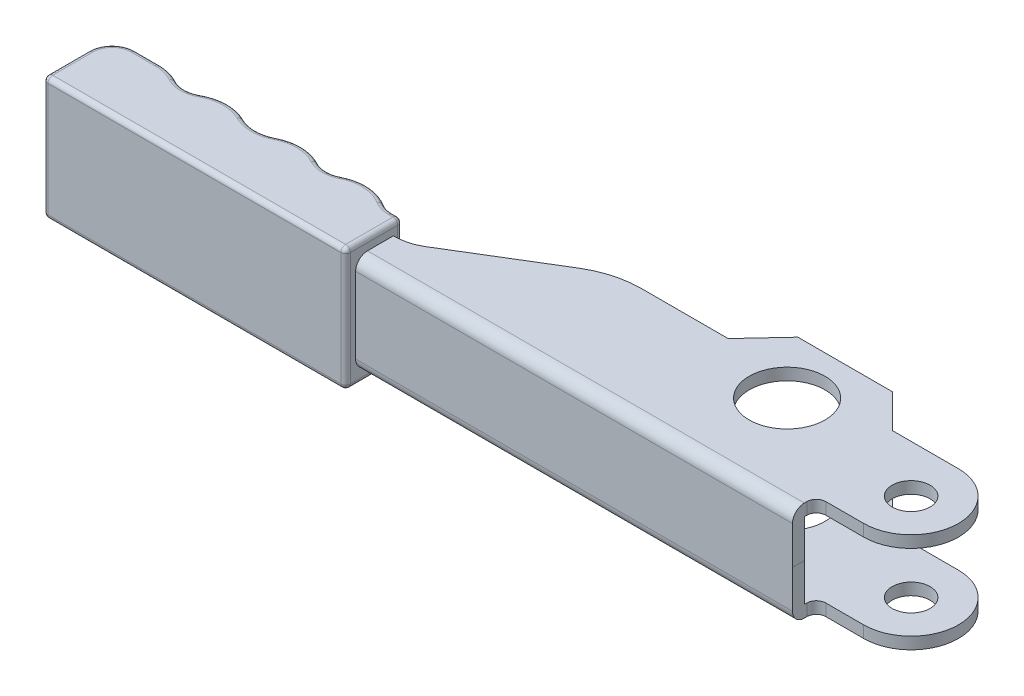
ISO-10303-21;
HEADER;
FILE_DESCRIPTION(('STEP AP214'),'2;1');
FILE_NAME('part.step','',(''),(''),'','','');
FILE_SCHEMA(('AUTOMOTIVE_DESIGN { 1 0 10303 214 1 1 1 1 }'));
ENDSEC;
DATA;
#1=APPLICATION_CONTEXT('core data for automotive mechanical design processes');
#2=APPLICATION_PROTOCOL_DEFINITION('international standard','automotive_design',2000,#1);
#3=PRODUCT_CONTEXT('',#1,'mechanical');
#4=PRODUCT('Part','Part','',(#3));
#5=PRODUCT_RELATED_PRODUCT_CATEGORY('part','',(#4));
#6=PRODUCT_DEFINITION_FORMATION('','',#4);
#7=PRODUCT_DEFINITION_CONTEXT('part definition',#1,'design');
#8=PRODUCT_DEFINITION('design','',#6,#7);
#9=PRODUCT_DEFINITION_SHAPE('','',#8);
#10=(LENGTH_UNIT() NAMED_UNIT(*) SI_UNIT(.MILLI.,.METRE.));
#11=(NAMED_UNIT(*) PLANE_ANGLE_UNIT() SI_UNIT($,.RADIAN.));
#12=(NAMED_UNIT(*) SI_UNIT($,.STERADIAN.) SOLID_ANGLE_UNIT());
#13=UNCERTAINTY_MEASURE_WITH_UNIT(LENGTH_MEASURE(1.E-05),#10,'distance_accuracy_value','');
#14=(GEOMETRIC_REPRESENTATION_CONTEXT(3) GLOBAL_UNCERTAINTY_ASSIGNED_CONTEXT((#13)) GLOBAL_UNIT_ASSIGNED_CONTEXT((#10,
#11,#12)) REPRESENTATION_CONTEXT('',''));
#15=CARTESIAN_POINT('',(0.,0.,0.));
#16=DIRECTION('',(0.,0.,1.));
#17=DIRECTION('',(1.,0.,0.));
#18=AXIS2_PLACEMENT_3D('',#15,#16,#17);
#19=CARTESIAN_POINT('',(-103.892904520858,-22.9642527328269,15.033644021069));
#20=DIRECTION('',(0.,0.,1.));
#21=DIRECTION('',(1.,0.,0.));
#22=AXIS2_PLACEMENT_3D('',#19,#20,#21);
#23=PLANE('',#22);
#24=DIRECTION('',(0.,1.,0.));
#25=VECTOR('',#24,1.);
#26=CARTESIAN_POINT('',(-102.2,11.0000000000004,15.0336440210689));
#27=LINE('',#26,#25);
#28=CARTESIAN_POINT('',(-102.2,-8.01825229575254,15.0336440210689));
#29=VERTEX_POINT('',#28);
#30=CARTESIAN_POINT('',(-102.2,8.0182522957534,15.0336440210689));
#31=VERTEX_POINT('',#30);
#32=EDGE_CURVE('E730',#29,#31,#27,.T.);
#33=ORIENTED_EDGE('',*,*,#32,.F.);
#34=DIRECTION('',(1.,0.,0.));
#35=VECTOR('',#34,1.);
#36=CARTESIAN_POINT('',(-103.892904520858,-8.01825229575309,15.033644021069));
#37=LINE('',#36,#35);
#38=CARTESIAN_POINT('',(-9.99999987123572,-8.01825229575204,15.033644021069));
#39=VERTEX_POINT('',#38);
#40=EDGE_CURVE('E295',#29,#39,#37,.T.);
#41=ORIENTED_EDGE('',*,*,#40,.T.);
#42=DIRECTION('',(-7.27577990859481E-07,-0.999999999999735,0.));
#43=VECTOR('',#42,1.);
#44=CARTESIAN_POINT('',(-10.0000002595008,-10.5153882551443,15.033644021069));
#45=LINE('',#44,#43);
#46=CARTESIAN_POINT('',(-9.99999260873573,0.,15.033644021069));
#47=VERTEX_POINT('',#46);
#48=EDGE_CURVE('E359',#47,#39,#45,.T.);
#49=ORIENTED_EDGE('',*,*,#48,.F.);
#50=DIRECTION('',(7.27577955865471E-07,-0.999999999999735,0.));
#51=VECTOR('',#50,1.);
#52=CARTESIAN_POINT('',(-10.0000002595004,10.5153882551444,15.033644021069));
#53=LINE('',#52,#51);
#54=CARTESIAN_POINT('',(-9.99999844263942,8.01825229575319,15.033644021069));
#55=VERTEX_POINT('',#54);
#56=EDGE_CURVE('E271',#55,#47,#53,.T.);
#57=ORIENTED_EDGE('',*,*,#56,.F.);
#58=DIRECTION('',(1.,0.,0.));
#59=VECTOR('',#58,1.);
#60=CARTESIAN_POINT('',(-103.892904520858,8.01825229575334,15.033644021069));
#61=LINE('',#60,#59);
#62=EDGE_CURVE('E276',#31,#55,#61,.T.);
#63=ORIENTED_EDGE('',*,*,#62,.F.);
#64=EDGE_LOOP('',(#33,#41,#49,#57,#63));
#65=FACE_BOUND('',#64,.T.);
#66=ADVANCED_FACE('F14',(#65),#23,.T.);
#67=CARTESIAN_POINT('',(-103.892904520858,-22.9642527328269,12.533644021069));
#68=DIRECTION('',(0.,0.,1.));
#69=DIRECTION('',(1.,0.,0.));
#70=AXIS2_PLACEMENT_3D('',#67,#68,#69);
#71=PLANE('',#70);
#72=DIRECTION('',(1.,0.,0.));
#73=VECTOR('',#72,1.);
#74=CARTESIAN_POINT('',(-103.892904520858,-8.01825229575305,12.5336440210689));
#75=LINE('',#74,#73);
#76=CARTESIAN_POINT('',(-102.2,-8.01825229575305,12.5336440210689));
#77=VERTEX_POINT('',#76);
#78=CARTESIAN_POINT('',(-9.99999987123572,-8.01825229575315,12.5336440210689));
#79=VERTEX_POINT('',#78);
#80=EDGE_CURVE('E441',#77,#79,#75,.T.);
#81=ORIENTED_EDGE('',*,*,#80,.F.);
#82=DIRECTION('',(0.,1.,0.));
#83=VECTOR('',#82,1.);
#84=CARTESIAN_POINT('',(-102.2,11.0000000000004,12.5336440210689));
#85=LINE('',#84,#83);
#86=CARTESIAN_POINT('',(-102.2,8.0182522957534,12.5336440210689));
#87=VERTEX_POINT('',#86);
#88=EDGE_CURVE('E680',#77,#87,#85,.T.);
#89=ORIENTED_EDGE('',*,*,#88,.T.);
#90=DIRECTION('',(1.,0.,0.));
#91=VECTOR('',#90,1.);
#92=CARTESIAN_POINT('',(-103.892904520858,8.01825229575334,12.533644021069));
#93=LINE('',#92,#91);
#94=CARTESIAN_POINT('',(-9.99999844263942,8.01825229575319,12.533644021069));
#95=VERTEX_POINT('',#94);
#96=EDGE_CURVE('E289',#87,#95,#93,.T.);
#97=ORIENTED_EDGE('',*,*,#96,.T.);
#98=DIRECTION('',(7.27577955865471E-07,-0.999999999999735,0.));
#99=VECTOR('',#98,1.);
#100=CARTESIAN_POINT('',(-10.0000002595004,10.5153882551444,12.533644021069));
#101=LINE('',#100,#99);
#102=CARTESIAN_POINT('',(-9.99999260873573,0.,12.533644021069));
#103=VERTEX_POINT('',#102);
#104=EDGE_CURVE('E267',#95,#103,#101,.T.);
#105=ORIENTED_EDGE('',*,*,#104,.T.);
#106=DIRECTION('',(-7.27577990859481E-07,-0.999999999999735,0.));
#107=VECTOR('',#106,1.);
#108=CARTESIAN_POINT('',(-10.0000002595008,-10.5153882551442,12.533644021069));
#109=LINE('',#108,#107);
#110=EDGE_CURVE('E280',#103,#79,#109,.T.);
#111=ORIENTED_EDGE('',*,*,#110,.T.);
#112=EDGE_LOOP('',(#81,#89,#97,#105,#111));
#113=FACE_BOUND('',#112,.T.);
#114=ADVANCED_FACE('F16',(#113),#71,.F.);
#115=CARTESIAN_POINT('',(-9.99999844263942,8.01825229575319,12.533644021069));
#116=DIRECTION('',(1.,0.,0.));
#117=DIRECTION('',(0.,-1.,0.));
#118=AXIS2_PLACEMENT_3D('',#115,#116,#117);
#119=CYLINDRICAL_SURFACE('',#118,2.5);
#120=CARTESIAN_POINT('',(-102.2,8.01825229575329,12.533644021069));
#121=DIRECTION('',(-1.,0.,0.));
#122=DIRECTION('',(0.,-1.,0.));
#123=AXIS2_PLACEMENT_3D('',#120,#121,#122);
#124=CIRCLE('',#123,2.5);
#125=CARTESIAN_POINT('',(-102.2,10.5182522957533,12.533644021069));
#126=VERTEX_POINT('',#125);
#127=EDGE_CURVE('E650',#31,#126,#124,.T.);
#128=ORIENTED_EDGE('',*,*,#127,.F.);
#129=ORIENTED_EDGE('',*,*,#62,.T.);
#130=CARTESIAN_POINT('',(-9.99999844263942,8.01825229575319,12.533644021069));
#131=DIRECTION('',(1.,0.,0.));
#132=DIRECTION('',(0.,-1.,0.));
#133=AXIS2_PLACEMENT_3D('',#130,#131,#132);
#134=CIRCLE('',#133,2.5);
#135=CARTESIAN_POINT('',(-9.99999844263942,10.5182522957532,12.533644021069));
#136=VERTEX_POINT('',#135);
#137=EDGE_CURVE('E347',#136,#55,#134,.T.);
#138=ORIENTED_EDGE('',*,*,#137,.F.);
#139=DIRECTION('',(1.,0.,0.));
#140=VECTOR('',#139,1.);
#141=CARTESIAN_POINT('',(-103.892904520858,10.5182522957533,12.533644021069));
#142=LINE('',#141,#140);
#143=EDGE_CURVE('E457',#126,#136,#142,.T.);
#144=ORIENTED_EDGE('',*,*,#143,.F.);
#145=EDGE_LOOP('',(#128,#129,#138,#144));
#146=FACE_BOUND('',#145,.T.);
#147=ADVANCED_FACE('F645',(#146),#119,.T.);
#148=CARTESIAN_POINT('',(-103.892899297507,10.5182522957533,7.05113899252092));
#149=DIRECTION('',(-6.96446813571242E-07,0.,-0.999999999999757));
#150=DIRECTION('',(1.00265545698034E-08,-1.,0.));
#151=AXIS2_PLACEMENT_3D('',#148,#149,#150);
#152=PLANE('',#151);
#153=DIRECTION('',(0.,-1.,0.));
#154=VECTOR('',#153,1.);
#155=CARTESIAN_POINT('',(-102.2,11.0000000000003,7.05113781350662));
#156=LINE('',#155,#154);
#157=CARTESIAN_POINT('',(-102.2,10.5182522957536,7.05113832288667));
#158=VERTEX_POINT('',#157);
#159=CARTESIAN_POINT('',(-102.2,8.01825229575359,7.05113832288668));
#160=VERTEX_POINT('',#159);
#161=EDGE_CURVE('E9',#158,#160,#156,.T.);
#162=ORIENTED_EDGE('',*,*,#161,.F.);
#163=DIRECTION('',(0.999999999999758,0.,-6.96446813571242E-07));
#164=VECTOR('',#163,1.);
#165=CARTESIAN_POINT('',(-103.892899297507,10.5182522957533,7.05113899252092));
#166=LINE('',#165,#164);
#167=CARTESIAN_POINT('',(-101.96989686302,10.5182522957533,7.05113765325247));
#168=VERTEX_POINT('',#167);
#169=EDGE_CURVE('E558',#158,#168,#166,.T.);
#170=ORIENTED_EDGE('',*,*,#169,.T.);
#171=DIRECTION('',(0.,-1.,0.));
#172=VECTOR('',#171,1.);
#173=CARTESIAN_POINT('',(-101.96989686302,10.5182522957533,7.05113765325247));
#174=LINE('',#173,#172);
#175=CARTESIAN_POINT('',(-101.96989686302,8.01825229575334,7.05113765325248));
#176=VERTEX_POINT('',#175);
#177=EDGE_CURVE('E482',#168,#176,#174,.T.);
#178=ORIENTED_EDGE('',*,*,#177,.T.);
#179=DIRECTION('',(0.999999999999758,0.,-6.96446813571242E-07));
#180=VECTOR('',#179,1.);
#181=CARTESIAN_POINT('',(-103.892899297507,8.01825229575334,7.05113899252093));
#182=LINE('',#181,#180);
#183=EDGE_CURVE('E479',#160,#176,#182,.T.);
#184=ORIENTED_EDGE('',*,*,#183,.F.);
#185=EDGE_LOOP('',(#162,#170,#178,#184));
#186=FACE_BOUND('',#185,.T.);
#187=ADVANCED_FACE('F612',(#186),#152,.T.);
#188=CARTESIAN_POINT('',(-103.892904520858,8.01825229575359,45.4796444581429));
#189=DIRECTION('',(0.,1.,0.));
#190=DIRECTION('',(0.,0.,-1.));
#191=AXIS2_PLACEMENT_3D('',#188,#189,#190);
#192=PLANE('',#191);
#193=CARTESIAN_POINT('',(-31.0000015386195,8.01825229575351,-4.82999853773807));
#194=DIRECTION('',(0.,1.,0.));
#195=DIRECTION('',(1.,0.,0.));
#196=AXIS2_PLACEMENT_3D('',#193,#194,#195);
#197=CIRCLE('',#196,8.);
#198=CARTESIAN_POINT('',(-23.0000015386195,8.0182522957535,-4.82999853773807));
#199=VERTEX_POINT('',#198);
#200=EDGE_CURVE('E374',#199,#199,#197,.F.);
#201=ORIENTED_EDGE('',*,*,#200,.F.);
#202=EDGE_LOOP('',(#201));
#203=FACE_BOUND('',#202,.T.);
#204=CARTESIAN_POINT('',(0.,8.01825229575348,-5.20417042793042E-13));
#205=DIRECTION('',(0.,1.,0.));
#206=DIRECTION('',(1.,0.,0.));
#207=AXIS2_PLACEMENT_3D('',#204,#205,#206);
#208=CIRCLE('',#207,4.);
#209=CARTESIAN_POINT('',(3.99999999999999,8.01825229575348,-5.20417042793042E-13));
#210=VERTEX_POINT('',#209);
#211=EDGE_CURVE('E710',#210,#210,#208,.F.);
#212=ORIENTED_EDGE('',*,*,#211,.F.);
#213=EDGE_LOOP('',(#212));
#214=FACE_BOUND('',#213,.T.);
#215=ORIENTED_EDGE('',*,*,#96,.F.);
#216=DIRECTION('',(0.,0.,-1.));
#217=VECTOR('',#216,1.);
#218=CARTESIAN_POINT('',(-102.2,8.01825229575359,7.16113765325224));
#219=LINE('',#218,#217);
#220=EDGE_CURVE('E24',#87,#160,#219,.T.);
#221=ORIENTED_EDGE('',*,*,#220,.T.);
#222=ORIENTED_EDGE('',*,*,#183,.T.);
#223=CARTESIAN_POINT('',(-101.969903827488,8.01825229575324,-2.94886234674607));
#224=DIRECTION('',(0.,1.,0.));
#225=DIRECTION('',(1.,0.,0.));
#226=AXIS2_PLACEMENT_3D('',#223,#224,#225);
#227=CIRCLE('',#226,10.0000000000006);
#228=CARTESIAN_POINT('',(-96.7704280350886,8.01825229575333,5.59311936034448));
#229=VERTEX_POINT('',#228);
#230=EDGE_CURVE('E483',#176,#229,#227,.T.);
#231=ORIENTED_EDGE('',*,*,#230,.T.);
#232=DIRECTION('',(0.854198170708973,0.,-0.519947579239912));
#233=VECTOR('',#232,1.);
#234=CARTESIAN_POINT('',(-76.7906149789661,8.0182522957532,-6.56852624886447));
#235=LINE('',#234,#233);
#236=CARTESIAN_POINT('',(-76.7906149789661,8.0182522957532,-6.56852624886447));
#237=VERTEX_POINT('',#236);
#238=EDGE_CURVE('E503',#229,#237,#235,.T.);
#239=ORIENTED_EDGE('',*,*,#238,.T.);
#240=CARTESIAN_POINT('',(-66.3916650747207,8.0182522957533,10.5154344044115));
#241=DIRECTION('',(0.,-1.,0.));
#242=DIRECTION('',(1.,0.,0.));
#243=AXIS2_PLACEMENT_3D('',#240,#241,#242);
#244=CIRCLE('',#243,19.999996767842);
#245=CARTESIAN_POINT('',(-66.3916803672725,8.0182522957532,-9.48456236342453));
#246=VERTEX_POINT('',#245);
#247=EDGE_CURVE('E367',#237,#246,#244,.T.);
#248=ORIENTED_EDGE('',*,*,#247,.T.);
#249=DIRECTION('',(0.999999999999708,0.,-7.6462770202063E-07));
#250=VECTOR('',#249,1.);
#251=CARTESIAN_POINT('',(-66.3916803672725,8.0182522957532,-9.48456236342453));
#252=LINE('',#251,#250);
#253=CARTESIAN_POINT('',(-48.1000027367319,8.01825229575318,-9.48457634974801));
#254=VERTEX_POINT('',#253);
#255=EDGE_CURVE('E363',#246,#254,#252,.T.);
#256=ORIENTED_EDGE('',*,*,#255,.T.);
#257=DIRECTION('',(0.681922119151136,0.,-0.731424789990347));
#258=VECTOR('',#257,1.);
#259=CARTESIAN_POINT('',(-48.1000027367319,8.01825229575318,-9.48457634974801));
#260=LINE('',#259,#258);
#261=CARTESIAN_POINT('',(-41.0000043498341,8.01825229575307,-17.0999838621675));
#262=VERTEX_POINT('',#261);
#263=EDGE_CURVE('E368',#254,#262,#260,.T.);
#264=ORIENTED_EDGE('',*,*,#263,.T.);
#265=DIRECTION('',(0.999999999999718,0.,-7.51557195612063E-07));
#266=VECTOR('',#265,1.);
#267=CARTESIAN_POINT('',(-41.0000043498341,8.01825229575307,-17.0999838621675));
#268=LINE('',#267,#266);
#269=CARTESIAN_POINT('',(-21.0000085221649,8.01825229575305,-17.099998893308));
#270=VERTEX_POINT('',#269);
#271=EDGE_CURVE('E487',#262,#270,#268,.T.);
#272=ORIENTED_EDGE('',*,*,#271,.T.);
#273=DIRECTION('',(0.707106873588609,0.,0.707106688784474));
#274=VECTOR('',#273,1.);
#275=CARTESIAN_POINT('',(-21.0000085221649,8.01825229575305,-17.099998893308));
#276=LINE('',#275,#274);
#277=CARTESIAN_POINT('',(-13.8999998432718,8.01825229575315,-9.99999207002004));
#278=VERTEX_POINT('',#277);
#279=EDGE_CURVE('E493',#270,#278,#276,.T.);
#280=ORIENTED_EDGE('',*,*,#279,.T.);
#281=DIRECTION('',(0.999999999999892,0.,-4.65058540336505E-07));
#282=VECTOR('',#281,1.);
#283=CARTESIAN_POINT('',(-13.8999998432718,8.01825229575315,-9.99999207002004));
#284=LINE('',#283,#282);
#285=CARTESIAN_POINT('',(-4.65058452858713E-06,8.01825229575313,-9.99999853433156));
#286=VERTEX_POINT('',#285);
#287=EDGE_CURVE('E341',#278,#286,#284,.T.);
#288=ORIENTED_EDGE('',*,*,#287,.T.);
#289=CARTESIAN_POINT('',(0.,8.01825229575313,-5.20417042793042E-13));
#290=DIRECTION('',(0.,-1.,0.));
#291=DIRECTION('',(1.,0.,0.));
#292=AXIS2_PLACEMENT_3D('',#289,#290,#291);
#293=CIRCLE('',#292,9.99999853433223);
#294=CARTESIAN_POINT('',(4.6505846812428E-06,8.01825229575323,9.99999853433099));
#295=VERTEX_POINT('',#294);
#296=EDGE_CURVE('E338',#286,#295,#293,.T.);
#297=ORIENTED_EDGE('',*,*,#296,.T.);
#298=DIRECTION('',(-0.999999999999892,0.,4.65058540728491E-07));
#299=VECTOR('',#298,1.);
#300=CARTESIAN_POINT('',(4.6505846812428E-06,8.01825229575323,9.99999853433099));
#301=LINE('',#300,#299);
#302=CARTESIAN_POINT('',(-8.00000142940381,8.01825229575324,10.000002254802));
#303=VERTEX_POINT('',#302);
#304=EDGE_CURVE('E342',#295,#303,#301,.T.);
#305=ORIENTED_EDGE('',*,*,#304,.T.);
#306=CARTESIAN_POINT('',(-8.00000049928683,8.01825229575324,12.000002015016));
#307=DIRECTION('',(0.,1.,0.));
#308=DIRECTION('',(1.,0.,0.));
#309=AXIS2_PLACEMENT_3D('',#306,#307,#308);
#310=CIRCLE('',#309,1.9999997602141);
#311=CARTESIAN_POINT('',(-10.0000002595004,8.01825229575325,12.0000034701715));
#312=VERTEX_POINT('',#311);
#313=EDGE_CURVE('E475',#303,#312,#310,.T.);
#314=ORIENTED_EDGE('',*,*,#313,.T.);
#315=DIRECTION('',(7.27577956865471E-07,0.,0.999999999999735));
#316=VECTOR('',#315,1.);
#317=CARTESIAN_POINT('',(-10.0000002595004,8.01825229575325,12.0000034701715));
#318=LINE('',#317,#316);
#319=EDGE_CURVE('E478',#312,#95,#318,.T.);
#320=ORIENTED_EDGE('',*,*,#319,.T.);
#321=EDGE_LOOP('',(#215,#221,#222,#231,#239,#248,#256,#264,#272,#280,#288,#297,#305,#314,#320));
#322=FACE_BOUND('',#321,.T.);
#323=ADVANCED_FACE('F721',(#203,#214,#322),#192,.F.);
#324=CARTESIAN_POINT('',(-103.892904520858,10.5182522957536,45.4796444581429));
#325=DIRECTION('',(0.,1.,0.));
#326=DIRECTION('',(0.,0.,-1.));
#327=AXIS2_PLACEMENT_3D('',#324,#325,#326);
#328=PLANE('',#327);
#329=CARTESIAN_POINT('',(0.,10.5182522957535,-5.30825383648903E-13));
#330=DIRECTION('',(0.,1.,0.));
#331=DIRECTION('',(1.,0.,0.));
#332=AXIS2_PLACEMENT_3D('',#329,#330,#331);
#333=CIRCLE('',#332,4.);
#334=CARTESIAN_POINT('',(3.99999999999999,10.5182522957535,-5.30825383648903E-13));
#335=VERTEX_POINT('',#334);
#336=EDGE_CURVE('E707',#335,#335,#333,.T.);
#337=ORIENTED_EDGE('',*,*,#336,.F.);
#338=EDGE_LOOP('',(#337));
#339=FACE_BOUND('',#338,.T.);
#340=CARTESIAN_POINT('',(-31.0000015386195,10.5182522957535,-4.82999853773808));
#341=DIRECTION('',(0.,1.,0.));
#342=DIRECTION('',(1.,0.,0.));
#343=AXIS2_PLACEMENT_3D('',#340,#341,#342);
#344=CIRCLE('',#343,8.);
#345=CARTESIAN_POINT('',(-23.0000015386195,10.5182522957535,-4.82999853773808));
#346=VERTEX_POINT('',#345);
#347=EDGE_CURVE('E712',#346,#346,#344,.T.);
#348=ORIENTED_EDGE('',*,*,#347,.F.);
#349=EDGE_LOOP('',(#348));
#350=FACE_BOUND('',#349,.T.);
#351=DIRECTION('',(0.,0.,-1.));
#352=VECTOR('',#351,1.);
#353=CARTESIAN_POINT('',(-102.2,10.5182522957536,7.16113765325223));
#354=LINE('',#353,#352);
#355=EDGE_CURVE('E690',#126,#158,#354,.T.);
#356=ORIENTED_EDGE('',*,*,#355,.F.);
#357=ORIENTED_EDGE('',*,*,#143,.T.);
#358=DIRECTION('',(7.27577956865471E-07,0.,0.999999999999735));
#359=VECTOR('',#358,1.);
#360=CARTESIAN_POINT('',(-10.0000002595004,10.5182522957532,12.0000034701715));
#361=LINE('',#360,#359);
#362=CARTESIAN_POINT('',(-10.0000002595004,10.5182522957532,12.0000034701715));
#363=VERTEX_POINT('',#362);
#364=EDGE_CURVE('E453',#363,#136,#361,.T.);
#365=ORIENTED_EDGE('',*,*,#364,.F.);
#366=CARTESIAN_POINT('',(-8.00000049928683,10.5182522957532,12.000002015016));
#367=DIRECTION('',(0.,1.,0.));
#368=DIRECTION('',(1.,0.,0.));
#369=AXIS2_PLACEMENT_3D('',#366,#367,#368);
#370=CIRCLE('',#369,1.9999997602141);
#371=CARTESIAN_POINT('',(-8.00000142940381,10.5182522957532,10.000002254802));
#372=VERTEX_POINT('',#371);
#373=EDGE_CURVE('E343',#372,#363,#370,.T.);
#374=ORIENTED_EDGE('',*,*,#373,.F.);
#375=DIRECTION('',(-0.999999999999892,0.,4.65058540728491E-07));
#376=VECTOR('',#375,1.);
#377=CARTESIAN_POINT('',(4.6505846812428E-06,10.5182522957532,9.99999853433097));
#378=LINE('',#377,#376);
#379=CARTESIAN_POINT('',(4.6505846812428E-06,10.5182522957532,9.99999853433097));
#380=VERTEX_POINT('',#379);
#381=EDGE_CURVE('E352',#380,#372,#378,.T.);
#382=ORIENTED_EDGE('',*,*,#381,.F.);
#383=CARTESIAN_POINT('',(0.,10.5182522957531,-5.30825383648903E-13));
#384=DIRECTION('',(0.,-1.,0.));
#385=DIRECTION('',(1.,0.,0.));
#386=AXIS2_PLACEMENT_3D('',#383,#384,#385);
#387=CIRCLE('',#386,9.99999853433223);
#388=CARTESIAN_POINT('',(-4.65058452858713E-06,10.5182522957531,-9.99999853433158));
#389=VERTEX_POINT('',#388);
#390=EDGE_CURVE('E362',#389,#380,#387,.T.);
#391=ORIENTED_EDGE('',*,*,#390,.F.);
#392=DIRECTION('',(0.999999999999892,0.,-4.65058540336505E-07));
#393=VECTOR('',#392,1.);
#394=CARTESIAN_POINT('',(-13.8999998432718,10.5182522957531,-9.99999207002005));
#395=LINE('',#394,#393);
#396=CARTESIAN_POINT('',(-13.8999998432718,10.5182522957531,-9.99999207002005));
#397=VERTEX_POINT('',#396);
#398=EDGE_CURVE('E299',#397,#389,#395,.T.);
#399=ORIENTED_EDGE('',*,*,#398,.F.);
#400=DIRECTION('',(0.707106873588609,0.,0.707106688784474));
#401=VECTOR('',#400,1.);
#402=CARTESIAN_POINT('',(-21.0000085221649,10.518252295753,-17.099998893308));
#403=LINE('',#402,#401);
#404=CARTESIAN_POINT('',(-21.0000085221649,10.518252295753,-17.099998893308));
#405=VERTEX_POINT('',#404);
#406=EDGE_CURVE('E471',#405,#397,#403,.T.);
#407=ORIENTED_EDGE('',*,*,#406,.F.);
#408=DIRECTION('',(0.999999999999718,0.,-7.51557195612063E-07));
#409=VECTOR('',#408,1.);
#410=CARTESIAN_POINT('',(-41.0000043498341,10.5182522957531,-17.0999838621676));
#411=LINE('',#410,#409);
#412=CARTESIAN_POINT('',(-41.0000043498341,10.5182522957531,-17.0999838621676));
#413=VERTEX_POINT('',#412);
#414=EDGE_CURVE('E385',#413,#405,#411,.T.);
#415=ORIENTED_EDGE('',*,*,#414,.F.);
#416=DIRECTION('',(0.681922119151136,0.,-0.731424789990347));
#417=VECTOR('',#416,1.);
#418=CARTESIAN_POINT('',(-48.1000027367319,10.5182522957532,-9.48457634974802));
#419=LINE('',#418,#417);
#420=CARTESIAN_POINT('',(-48.1000027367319,10.5182522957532,-9.48457634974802));
#421=VERTEX_POINT('',#420);
#422=EDGE_CURVE('E446',#421,#413,#419,.T.);
#423=ORIENTED_EDGE('',*,*,#422,.F.);
#424=DIRECTION('',(0.999999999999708,0.,-7.6462770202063E-07));
#425=VECTOR('',#424,1.);
#426=CARTESIAN_POINT('',(-66.3916803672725,10.5182522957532,-9.48456236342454));
#427=LINE('',#426,#425);
#428=CARTESIAN_POINT('',(-66.3916803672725,10.5182522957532,-9.48456236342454));
#429=VERTEX_POINT('',#428);
#430=EDGE_CURVE('E399',#429,#421,#427,.T.);
#431=ORIENTED_EDGE('',*,*,#430,.F.);
#432=CARTESIAN_POINT('',(-66.3916650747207,10.5182522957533,10.5154344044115));
#433=DIRECTION('',(0.,-1.,0.));
#434=DIRECTION('',(1.,0.,0.));
#435=AXIS2_PLACEMENT_3D('',#432,#433,#434);
#436=CIRCLE('',#435,19.999996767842);
#437=CARTESIAN_POINT('',(-76.7906149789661,10.5182522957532,-6.56852624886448));
#438=VERTEX_POINT('',#437);
#439=EDGE_CURVE('E321',#438,#429,#436,.T.);
#440=ORIENTED_EDGE('',*,*,#439,.F.);
#441=DIRECTION('',(0.854198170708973,0.,-0.519947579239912));
#442=VECTOR('',#441,1.);
#443=CARTESIAN_POINT('',(-76.7906149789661,10.5182522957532,-6.56852624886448));
#444=LINE('',#443,#442);
#445=CARTESIAN_POINT('',(-96.7704280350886,10.5182522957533,5.59311936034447));
#446=VERTEX_POINT('',#445);
#447=EDGE_CURVE('E322',#446,#438,#444,.T.);
#448=ORIENTED_EDGE('',*,*,#447,.F.);
#449=CARTESIAN_POINT('',(-101.969903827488,10.5182522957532,-2.94886234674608));
#450=DIRECTION('',(0.,1.,0.));
#451=DIRECTION('',(1.,0.,0.));
#452=AXIS2_PLACEMENT_3D('',#449,#450,#451);
#453=CIRCLE('',#452,10.0000000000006);
#454=EDGE_CURVE('E413',#168,#446,#453,.T.);
#455=ORIENTED_EDGE('',*,*,#454,.F.);
#456=ORIENTED_EDGE('',*,*,#169,.F.);
#457=EDGE_LOOP('',(#356,#357,#365,#374,#382,#391,#399,#407,#415,#423,#431,#440,#448,#455,#456));
#458=FACE_BOUND('',#457,.T.);
#459=ADVANCED_FACE('F622',(#339,#350,#458),#328,.T.);
#460=CARTESIAN_POINT('',(-103.892899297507,-10.5182522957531,7.05113899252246));
#461=DIRECTION('',(-6.96446813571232E-07,0.,-0.999999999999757));
#462=DIRECTION('',(0.,-1.,0.));
#463=AXIS2_PLACEMENT_3D('',#460,#461,#462);
#464=PLANE('',#463);
#465=DIRECTION('',(0.,-1.,0.));
#466=VECTOR('',#465,1.);
#467=CARTESIAN_POINT('',(-102.2,11.0000000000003,7.05113781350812));
#468=LINE('',#467,#466);
#469=CARTESIAN_POINT('',(-102.2,-8.01825229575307,7.05113781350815));
#470=VERTEX_POINT('',#469);
#471=CARTESIAN_POINT('',(-102.2,-10.5182522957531,7.05113832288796));
#472=VERTEX_POINT('',#471);
#473=EDGE_CURVE('E735',#470,#472,#468,.T.);
#474=ORIENTED_EDGE('',*,*,#473,.F.);
#475=DIRECTION('',(-0.999999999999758,0.,6.96446813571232E-07));
#476=VECTOR('',#475,1.);
#477=CARTESIAN_POINT('',(-103.892899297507,-8.01825229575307,7.05113899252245));
#478=LINE('',#477,#476);
#479=CARTESIAN_POINT('',(-101.969896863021,-8.01825229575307,7.05113765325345));
#480=VERTEX_POINT('',#479);
#481=EDGE_CURVE('E382',#480,#470,#478,.T.);
#482=ORIENTED_EDGE('',*,*,#481,.F.);
#483=DIRECTION('',(0.,1.,0.));
#484=VECTOR('',#483,1.);
#485=CARTESIAN_POINT('',(-101.969896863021,-10.5182522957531,7.05113765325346));
#486=LINE('',#485,#484);
#487=CARTESIAN_POINT('',(-101.969896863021,-10.5182522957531,7.05113765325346));
#488=VERTEX_POINT('',#487);
#489=EDGE_CURVE('E357',#488,#480,#486,.T.);
#490=ORIENTED_EDGE('',*,*,#489,.F.);
#491=DIRECTION('',(-0.999999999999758,0.,6.96446813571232E-07));
#492=VECTOR('',#491,1.);
#493=CARTESIAN_POINT('',(-103.892899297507,-10.5182522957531,7.05113899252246));
#494=LINE('',#493,#492);
#495=EDGE_CURVE('E417',#488,#472,#494,.T.);
#496=ORIENTED_EDGE('',*,*,#495,.T.);
#497=EDGE_LOOP('',(#474,#482,#490,#496));
#498=FACE_BOUND('',#497,.T.);
#499=ADVANCED_FACE('F1895',(#498),#464,.T.);
#500=CARTESIAN_POINT('',(-103.892904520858,-8.01825229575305,-0.448861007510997));
#501=DIRECTION('',(0.,-1.,0.));
#502=DIRECTION('',(-1.,0.,0.));
#503=AXIS2_PLACEMENT_3D('',#500,#501,#502);
#504=PLANE('',#503);
#505=CARTESIAN_POINT('',(0.,-8.01825229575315,0.));
#506=DIRECTION('',(0.,-1.,0.));
#507=DIRECTION('',(-1.,0.,0.));
#508=AXIS2_PLACEMENT_3D('',#505,#506,#507);
#509=CIRCLE('',#508,4.);
#510=CARTESIAN_POINT('',(-4.00000000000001,-8.01825229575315,0.));
#511=VERTEX_POINT('',#510);
#512=EDGE_CURVE('E704',#511,#511,#509,.F.);
#513=ORIENTED_EDGE('',*,*,#512,.F.);
#514=EDGE_LOOP('',(#513));
#515=FACE_BOUND('',#514,.T.);
#516=CARTESIAN_POINT('',(-31.0000029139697,-8.01825229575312,-4.82999853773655));
#517=DIRECTION('',(0.,-1.,0.));
#518=DIRECTION('',(-1.,0.,0.));
#519=AXIS2_PLACEMENT_3D('',#516,#517,#518);
#520=CIRCLE('',#519,8.);
#521=CARTESIAN_POINT('',(-39.0000029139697,-8.01825229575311,-4.82999853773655));
#522=VERTEX_POINT('',#521);
#523=EDGE_CURVE('E698',#522,#522,#520,.F.);
#524=ORIENTED_EDGE('',*,*,#523,.F.);
#525=EDGE_LOOP('',(#524));
#526=FACE_BOUND('',#525,.T.);
#527=ORIENTED_EDGE('',*,*,#481,.T.);
#528=DIRECTION('',(0.,0.,1.));
#529=VECTOR('',#528,1.);
#530=CARTESIAN_POINT('',(-102.2,-8.01825229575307,7.16113765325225));
#531=LINE('',#530,#529);
#532=EDGE_CURVE('E678',#470,#77,#531,.T.);
#533=ORIENTED_EDGE('',*,*,#532,.T.);
#534=ORIENTED_EDGE('',*,*,#80,.T.);
#535=DIRECTION('',(-7.27577989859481E-07,0.,-0.999999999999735));
#536=VECTOR('',#535,1.);
#537=CARTESIAN_POINT('',(-10.0000002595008,-8.01825229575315,12.0000034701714));
#538=LINE('',#537,#536);
#539=CARTESIAN_POINT('',(-10.0000002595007,-8.01825229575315,12.0000034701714));
#540=VERTEX_POINT('',#539);
#541=EDGE_CURVE('E283',#79,#540,#538,.T.);
#542=ORIENTED_EDGE('',*,*,#541,.T.);
#543=CARTESIAN_POINT('',(-8.00000049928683,-8.01825229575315,12.000002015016));
#544=DIRECTION('',(0.,-1.,0.));
#545=DIRECTION('',(-1.,0.,0.));
#546=AXIS2_PLACEMENT_3D('',#543,#544,#545);
#547=CIRCLE('',#546,1.99999976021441);
#548=CARTESIAN_POINT('',(-8.00000142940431,-8.01825229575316,10.000002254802));
#549=VERTEX_POINT('',#548);
#550=EDGE_CURVE('E442',#540,#549,#547,.T.);
#551=ORIENTED_EDGE('',*,*,#550,.T.);
#552=DIRECTION('',(0.999999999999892,0.,-4.65058554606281E-07));
#553=VECTOR('',#552,1.);
#554=CARTESIAN_POINT('',(4.65058398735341E-06,-8.01825229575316,9.9999985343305));
#555=LINE('',#554,#553);
#556=CARTESIAN_POINT('',(4.65058398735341E-06,-8.01825229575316,9.999998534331));
#557=VERTEX_POINT('',#556);
#558=EDGE_CURVE('E516',#549,#557,#555,.T.);
#559=ORIENTED_EDGE('',*,*,#558,.T.);
#560=CARTESIAN_POINT('',(0.,-8.01825229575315,0.));
#561=DIRECTION('',(0.,1.,0.));
#562=DIRECTION('',(-1.,0.,0.));
#563=AXIS2_PLACEMENT_3D('',#560,#561,#562);
#564=CIRCLE('',#563,9.99999853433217);
#565=CARTESIAN_POINT('',(-4.65058552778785E-06,-8.01825229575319,-9.99999853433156));
#566=VERTEX_POINT('',#565);
#567=EDGE_CURVE('E532',#557,#566,#564,.T.);
#568=ORIENTED_EDGE('',*,*,#567,.T.);
#569=DIRECTION('',(-0.999999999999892,0.,4.65058548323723E-07));
#570=VECTOR('',#569,1.);
#571=CARTESIAN_POINT('',(-13.8999998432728,-8.01825229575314,-9.99999207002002));
#572=LINE('',#571,#570);
#573=CARTESIAN_POINT('',(-13.8999998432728,-8.01825229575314,-9.99999207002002));
#574=VERTEX_POINT('',#573);
#575=EDGE_CURVE('E437',#566,#574,#572,.T.);
#576=ORIENTED_EDGE('',*,*,#575,.T.);
#577=DIRECTION('',(-0.707106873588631,0.,-0.707106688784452));
#578=VECTOR('',#577,1.);
#579=CARTESIAN_POINT('',(-21.0000085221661,-8.01825229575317,-17.099998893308));
#580=LINE('',#579,#578);
#581=CARTESIAN_POINT('',(-21.0000085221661,-8.01825229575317,-17.099998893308));
#582=VERTEX_POINT('',#581);
#583=EDGE_CURVE('E433',#574,#582,#580,.T.);
#584=ORIENTED_EDGE('',*,*,#583,.T.);
#585=DIRECTION('',(-0.999999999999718,0.,7.51557228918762E-07));
#586=VECTOR('',#585,1.);
#587=CARTESIAN_POINT('',(-41.0000043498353,-8.01825229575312,-17.0999838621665));
#588=LINE('',#587,#586);
#589=CARTESIAN_POINT('',(-41.0000043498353,-8.01825229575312,-17.0999838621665));
#590=VERTEX_POINT('',#589);
#591=EDGE_CURVE('E438',#582,#590,#588,.T.);
#592=ORIENTED_EDGE('',*,*,#591,.T.);
#593=DIRECTION('',(-0.681922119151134,0.,0.731424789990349));
#594=VECTOR('',#593,1.);
#595=CARTESIAN_POINT('',(-48.1000027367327,-8.01825229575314,-9.4845763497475));
#596=LINE('',#595,#594);
#597=CARTESIAN_POINT('',(-48.1000027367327,-8.01825229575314,-9.4845763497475));
#598=VERTEX_POINT('',#597);
#599=EDGE_CURVE('E309',#590,#598,#596,.T.);
#600=ORIENTED_EDGE('',*,*,#599,.T.);
#601=DIRECTION('',(-0.999999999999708,0.,7.64627723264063E-07));
#602=VECTOR('',#601,1.);
#603=CARTESIAN_POINT('',(-66.3916803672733,-8.01825229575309,-9.4845623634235));
#604=LINE('',#603,#602);
#605=CARTESIAN_POINT('',(-66.3916803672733,-8.01825229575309,-9.4845623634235));
#606=VERTEX_POINT('',#605);
#607=EDGE_CURVE('E305',#598,#606,#604,.T.);
#608=ORIENTED_EDGE('',*,*,#607,.T.);
#609=CARTESIAN_POINT('',(-66.3916650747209,-8.0182522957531,10.5154344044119));
#610=DIRECTION('',(0.,1.,0.));
#611=DIRECTION('',(-1.,0.,0.));
#612=AXIS2_PLACEMENT_3D('',#609,#610,#611);
#613=CIRCLE('',#612,19.9999967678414);
#614=CARTESIAN_POINT('',(-76.7906149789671,-8.01825229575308,-6.56852624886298));
#615=VERTEX_POINT('',#614);
#616=EDGE_CURVE('E310',#606,#615,#613,.T.);
#617=ORIENTED_EDGE('',*,*,#616,.T.);
#618=DIRECTION('',(-0.854198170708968,0.,0.51994757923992));
#619=VECTOR('',#618,1.);
#620=CARTESIAN_POINT('',(-76.7906149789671,-8.01825229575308,-6.56852624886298));
#621=LINE('',#620,#619);
#622=CARTESIAN_POINT('',(-96.7704280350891,-8.01825229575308,5.593119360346));
#623=VERTEX_POINT('',#622);
#624=EDGE_CURVE('E404',#615,#623,#621,.T.);
#625=ORIENTED_EDGE('',*,*,#624,.T.);
#626=CARTESIAN_POINT('',(-101.969903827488,-8.01825229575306,-2.94886234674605));
#627=DIRECTION('',(0.,-1.,0.));
#628=DIRECTION('',(-1.,0.,0.));
#629=AXIS2_PLACEMENT_3D('',#626,#627,#628);
#630=CIRCLE('',#629,10.0000000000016);
#631=EDGE_CURVE('E400',#623,#480,#630,.T.);
#632=ORIENTED_EDGE('',*,*,#631,.T.);
#633=EDGE_LOOP('',(#527,#533,#534,#542,#551,#559,#568,#576,#584,#592,#600,#608,#617,#625,#632));
#634=FACE_BOUND('',#633,.T.);
#635=ADVANCED_FACE('F674',(#515,#526,#634),#504,.F.);
#636=CARTESIAN_POINT('',(-103.892904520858,-10.5182522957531,-0.448861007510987));
#637=DIRECTION('',(0.,-1.,0.));
#638=DIRECTION('',(-1.,0.,0.));
#639=AXIS2_PLACEMENT_3D('',#636,#637,#638);
#640=PLANE('',#639);
#641=CARTESIAN_POINT('',(-31.0000029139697,-10.5182522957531,-4.82999853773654));
#642=DIRECTION('',(0.,-1.,0.));
#643=DIRECTION('',(-1.,0.,0.));
#644=AXIS2_PLACEMENT_3D('',#641,#642,#643);
#645=CIRCLE('',#644,8.);
#646=CARTESIAN_POINT('',(-39.0000029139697,-10.5182522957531,-4.82999853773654));
#647=VERTEX_POINT('',#646);
#648=EDGE_CURVE('E695',#647,#647,#645,.T.);
#649=ORIENTED_EDGE('',*,*,#648,.F.);
#650=EDGE_LOOP('',(#649));
#651=FACE_BOUND('',#650,.T.);
#652=CARTESIAN_POINT('',(0.,-10.5182522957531,0.));
#653=DIRECTION('',(0.,-1.,0.));
#654=DIRECTION('',(-1.,0.,0.));
#655=AXIS2_PLACEMENT_3D('',#652,#653,#654);
#656=CIRCLE('',#655,4.);
#657=CARTESIAN_POINT('',(-4.00000000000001,-10.5182522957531,0.));
#658=VERTEX_POINT('',#657);
#659=EDGE_CURVE('E701',#658,#658,#656,.T.);
#660=ORIENTED_EDGE('',*,*,#659,.F.);
#661=EDGE_LOOP('',(#660));
#662=FACE_BOUND('',#661,.T.);
#663=DIRECTION('',(0.,0.,1.));
#664=VECTOR('',#663,1.);
#665=CARTESIAN_POINT('',(-102.2,-10.5182522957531,7.16113765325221));
#666=LINE('',#665,#664);
#667=CARTESIAN_POINT('',(-102.2,-10.518252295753,12.533644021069));
#668=VERTEX_POINT('',#667);
#669=EDGE_CURVE('E738',#472,#668,#666,.T.);
#670=ORIENTED_EDGE('',*,*,#669,.F.);
#671=ORIENTED_EDGE('',*,*,#495,.F.);
#672=CARTESIAN_POINT('',(-101.969903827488,-10.5182522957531,-2.94886234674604));
#673=DIRECTION('',(0.,-1.,0.));
#674=DIRECTION('',(-1.,0.,0.));
#675=AXIS2_PLACEMENT_3D('',#672,#673,#674);
#676=CIRCLE('',#675,10.0000000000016);
#677=CARTESIAN_POINT('',(-96.7704280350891,-10.5182522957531,5.59311936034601));
#678=VERTEX_POINT('',#677);
#679=EDGE_CURVE('E378',#678,#488,#676,.T.);
#680=ORIENTED_EDGE('',*,*,#679,.F.);
#681=DIRECTION('',(-0.854198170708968,0.,0.51994757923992));
#682=VECTOR('',#681,1.);
#683=CARTESIAN_POINT('',(-76.7906149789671,-10.5182522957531,-6.56852624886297));
#684=LINE('',#683,#682);
#685=CARTESIAN_POINT('',(-76.7906149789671,-10.5182522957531,-6.56852624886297));
#686=VERTEX_POINT('',#685);
#687=EDGE_CURVE('E353',#686,#678,#684,.T.);
#688=ORIENTED_EDGE('',*,*,#687,.F.);
#689=CARTESIAN_POINT('',(-66.3916650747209,-10.5182522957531,10.515434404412));
#690=DIRECTION('',(0.,1.,0.));
#691=DIRECTION('',(-1.,0.,0.));
#692=AXIS2_PLACEMENT_3D('',#689,#690,#691);
#693=CIRCLE('',#692,19.9999967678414);
#694=CARTESIAN_POINT('',(-66.3916803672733,-10.5182522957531,-9.48456236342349));
#695=VERTEX_POINT('',#694);
#696=EDGE_CURVE('E408',#695,#686,#693,.T.);
#697=ORIENTED_EDGE('',*,*,#696,.F.);
#698=DIRECTION('',(-0.999999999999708,0.,7.64627723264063E-07));
#699=VECTOR('',#698,1.);
#700=CARTESIAN_POINT('',(-66.3916803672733,-10.5182522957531,-9.48456236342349));
#701=LINE('',#700,#699);
#702=CARTESIAN_POINT('',(-48.1000027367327,-10.5182522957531,-9.48457634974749));
#703=VERTEX_POINT('',#702);
#704=EDGE_CURVE('E18',#703,#695,#701,.T.);
#705=ORIENTED_EDGE('',*,*,#704,.F.);
#706=DIRECTION('',(-0.681922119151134,0.,0.731424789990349));
#707=VECTOR('',#706,1.);
#708=CARTESIAN_POINT('',(-48.1000027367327,-10.5182522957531,-9.48457634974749));
#709=LINE('',#708,#707);
#710=CARTESIAN_POINT('',(-41.0000043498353,-10.5182522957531,-17.0999838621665));
#711=VERTEX_POINT('',#710);
#712=EDGE_CURVE('E323',#711,#703,#709,.T.);
#713=ORIENTED_EDGE('',*,*,#712,.F.);
#714=DIRECTION('',(-0.999999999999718,0.,7.51557228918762E-07));
#715=VECTOR('',#714,1.);
#716=CARTESIAN_POINT('',(-41.0000043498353,-10.5182522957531,-17.0999838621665));
#717=LINE('',#716,#715);
#718=CARTESIAN_POINT('',(-21.0000085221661,-10.5182522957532,-17.099998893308));
#719=VERTEX_POINT('',#718);
#720=EDGE_CURVE('E428',#719,#711,#717,.T.);
#721=ORIENTED_EDGE('',*,*,#720,.F.);
#722=DIRECTION('',(-0.707106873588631,0.,-0.707106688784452));
#723=VECTOR('',#722,1.);
#724=CARTESIAN_POINT('',(-21.0000085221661,-10.5182522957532,-17.099998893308));
#725=LINE('',#724,#723);
#726=CARTESIAN_POINT('',(-13.8999998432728,-10.5182522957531,-9.99999207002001));
#727=VERTEX_POINT('',#726);
#728=EDGE_CURVE('E461',#727,#719,#725,.T.);
#729=ORIENTED_EDGE('',*,*,#728,.F.);
#730=DIRECTION('',(-0.999999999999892,0.,4.65058548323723E-07));
#731=VECTOR('',#730,1.);
#732=CARTESIAN_POINT('',(-13.8999998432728,-10.5182522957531,-9.99999207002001));
#733=LINE('',#732,#731);
#734=CARTESIAN_POINT('',(-4.65058552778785E-06,-10.5182522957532,-9.99999853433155));
#735=VERTEX_POINT('',#734);
#736=EDGE_CURVE('E329',#735,#727,#733,.T.);
#737=ORIENTED_EDGE('',*,*,#736,.F.);
#738=CARTESIAN_POINT('',(0.,-10.5182522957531,0.));
#739=DIRECTION('',(0.,1.,0.));
#740=DIRECTION('',(-1.,0.,0.));
#741=AXIS2_PLACEMENT_3D('',#738,#739,#740);
#742=CIRCLE('',#741,9.99999853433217);
#743=CARTESIAN_POINT('',(4.65058398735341E-06,-10.5182522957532,9.99999853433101));
#744=VERTEX_POINT('',#743);
#745=EDGE_CURVE('E567',#744,#735,#742,.T.);
#746=ORIENTED_EDGE('',*,*,#745,.F.);
#747=DIRECTION('',(0.999999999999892,0.,-4.65058554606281E-07));
#748=VECTOR('',#747,1.);
#749=CARTESIAN_POINT('',(4.65058398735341E-06,-10.5182522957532,9.99999853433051));
#750=LINE('',#749,#748);
#751=CARTESIAN_POINT('',(-8.00000142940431,-10.5182522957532,10.000002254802));
#752=VERTEX_POINT('',#751);
#753=EDGE_CURVE('E311',#752,#744,#750,.T.);
#754=ORIENTED_EDGE('',*,*,#753,.F.);
#755=CARTESIAN_POINT('',(-8.00000049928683,-10.5182522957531,12.000002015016));
#756=DIRECTION('',(0.,-1.,0.));
#757=DIRECTION('',(-1.,0.,0.));
#758=AXIS2_PLACEMENT_3D('',#755,#756,#757);
#759=CIRCLE('',#758,1.99999976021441);
#760=CARTESIAN_POINT('',(-10.0000002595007,-10.5182522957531,12.0000034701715));
#761=VERTEX_POINT('',#760);
#762=EDGE_CURVE('E467',#761,#752,#759,.T.);
#763=ORIENTED_EDGE('',*,*,#762,.F.);
#764=DIRECTION('',(-7.27577989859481E-07,0.,-0.999999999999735));
#765=VECTOR('',#764,1.);
#766=CARTESIAN_POINT('',(-10.0000002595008,-10.5182522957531,12.0000034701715));
#767=LINE('',#766,#765);
#768=CARTESIAN_POINT('',(-9.99999987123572,-10.5182522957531,12.5336440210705));
#769=VERTEX_POINT('',#768);
#770=EDGE_CURVE('E379',#769,#761,#767,.T.);
#771=ORIENTED_EDGE('',*,*,#770,.F.);
#772=DIRECTION('',(1.,0.,0.));
#773=VECTOR('',#772,1.);
#774=CARTESIAN_POINT('',(-103.892904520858,-10.518252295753,12.533644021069));
#775=LINE('',#774,#773);
#776=EDGE_CURVE('E373',#668,#769,#775,.T.);
#777=ORIENTED_EDGE('',*,*,#776,.F.);
#778=EDGE_LOOP('',(#670,#671,#680,#688,#697,#705,#713,#721,#729,#737,#746,#754,#763,#771,#777));
#779=FACE_BOUND('',#778,.T.);
#780=ADVANCED_FACE('F668',(#651,#662,#779),#640,.T.);
#781=CARTESIAN_POINT('',(-9.99999987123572,-8.01825229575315,12.5336440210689));
#782=DIRECTION('',(1.,0.,0.));
#783=DIRECTION('',(0.,0.,-1.));
#784=AXIS2_PLACEMENT_3D('',#781,#782,#783);
#785=CYLINDRICAL_SURFACE('',#784,2.49999999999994);
#786=CARTESIAN_POINT('',(-102.2,-8.01825229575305,12.5336440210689));
#787=DIRECTION('',(-1.,0.,0.));
#788=DIRECTION('',(0.,-1.,0.));
#789=AXIS2_PLACEMENT_3D('',#786,#787,#788);
#790=CIRCLE('',#789,2.49999999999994);
#791=EDGE_CURVE('E663',#668,#29,#790,.T.);
#792=ORIENTED_EDGE('',*,*,#791,.F.);
#793=ORIENTED_EDGE('',*,*,#776,.T.);
#794=CARTESIAN_POINT('',(-9.99999987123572,-8.01825229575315,12.5336440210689));
#795=DIRECTION('',(1.,0.,0.));
#796=DIRECTION('',(0.,0.,-1.));
#797=AXIS2_PLACEMENT_3D('',#794,#795,#796);
#798=CIRCLE('',#797,2.49999999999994);
#799=EDGE_CURVE('E369',#39,#769,#798,.T.);
#800=ORIENTED_EDGE('',*,*,#799,.F.);
#801=ORIENTED_EDGE('',*,*,#40,.F.);
#802=EDGE_LOOP('',(#792,#793,#800,#801));
#803=FACE_BOUND('',#802,.T.);
#804=ADVANCED_FACE('F657',(#803),#785,.T.);
#805=CARTESIAN_POINT('',(0.,-10.5182522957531,0.));
#806=DIRECTION('',(0.,1.,0.));
#807=DIRECTION('',(1.,0.,0.));
#808=AXIS2_PLACEMENT_3D('',#805,#806,#807);
#809=CYLINDRICAL_SURFACE('',#808,9.99999853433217);
#810=ORIENTED_EDGE('',*,*,#745,.T.);
#811=DIRECTION('',(0.,1.,0.));
#812=VECTOR('',#811,1.);
#813=CARTESIAN_POINT('',(-4.65058552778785E-06,-10.5182522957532,-9.99999853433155));
#814=LINE('',#813,#812);
#815=EDGE_CURVE('E315',#735,#566,#814,.T.);
#816=ORIENTED_EDGE('',*,*,#815,.T.);
#817=ORIENTED_EDGE('',*,*,#567,.F.);
#818=DIRECTION('',(0.,1.,0.));
#819=VECTOR('',#818,1.);
#820=CARTESIAN_POINT('',(4.65058398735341E-06,-10.5182522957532,9.99999853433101));
#821=LINE('',#820,#819);
#822=EDGE_CURVE('E316',#744,#557,#821,.T.);
#823=ORIENTED_EDGE('',*,*,#822,.F.);
#824=EDGE_LOOP('',(#810,#816,#817,#823));
#825=FACE_BOUND('',#824,.T.);
#826=ADVANCED_FACE('F1925',(#825),#809,.T.);
#827=CARTESIAN_POINT('',(0.,10.5182522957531,-5.30825383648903E-13));
#828=DIRECTION('',(0.,-1.,0.));
#829=DIRECTION('',(1.,0.,0.));
#830=AXIS2_PLACEMENT_3D('',#827,#828,#829);
#831=CYLINDRICAL_SURFACE('',#830,9.99999853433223);
#832=ORIENTED_EDGE('',*,*,#390,.T.);
#833=DIRECTION('',(0.,-1.,0.));
#834=VECTOR('',#833,1.);
#835=CARTESIAN_POINT('',(4.6505846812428E-06,10.5182522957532,9.99999853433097));
#836=LINE('',#835,#834);
#837=EDGE_CURVE('E303',#380,#295,#836,.T.);
#838=ORIENTED_EDGE('',*,*,#837,.T.);
#839=ORIENTED_EDGE('',*,*,#296,.F.);
#840=DIRECTION('',(0.,-1.,0.));
#841=VECTOR('',#840,1.);
#842=CARTESIAN_POINT('',(-4.65058452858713E-06,10.5182522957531,-9.99999853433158));
#843=LINE('',#842,#841);
#844=EDGE_CURVE('E304',#389,#286,#843,.T.);
#845=ORIENTED_EDGE('',*,*,#844,.F.);
#846=EDGE_LOOP('',(#832,#838,#839,#845));
#847=FACE_BOUND('',#846,.T.);
#848=ADVANCED_FACE('F2002',(#847),#831,.T.);
#849=CARTESIAN_POINT('',(-10.0000002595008,-10.5153882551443,15.033644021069));
#850=DIRECTION('',(0.999999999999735,-7.27577990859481E-07,0.));
#851=DIRECTION('',(0.,0.,1.));
#852=AXIS2_PLACEMENT_3D('',#849,#850,#851);
#853=PLANE('',#852);
#854=ORIENTED_EDGE('',*,*,#48,.T.);
#855=ORIENTED_EDGE('',*,*,#799,.T.);
#856=ORIENTED_EDGE('',*,*,#770,.T.);
#857=DIRECTION('',(0.,1.,0.));
#858=VECTOR('',#857,1.);
#859=CARTESIAN_POINT('',(-10.0000002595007,-10.5182522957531,12.0000034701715));
#860=LINE('',#859,#858);
#861=EDGE_CURVE('E383',#761,#540,#860,.T.);
#862=ORIENTED_EDGE('',*,*,#861,.T.);
#863=ORIENTED_EDGE('',*,*,#541,.F.);
#864=ORIENTED_EDGE('',*,*,#110,.F.);
#865=DIRECTION('',(0.,0.,-1.));
#866=VECTOR('',#865,1.);
#867=CARTESIAN_POINT('',(-9.99999260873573,0.,15.033644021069));
#868=LINE('',#867,#866);
#869=EDGE_CURVE('E262',#47,#103,#868,.T.);
#870=ORIENTED_EDGE('',*,*,#869,.F.);
#871=EDGE_LOOP('',(#854,#855,#856,#862,#863,#864,#870));
#872=FACE_BOUND('',#871,.T.);
#873=ADVANCED_FACE('F281',(#872),#853,.T.);
#874=CARTESIAN_POINT('',(-10.0000002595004,10.5153882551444,15.033644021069));
#875=DIRECTION('',(0.999999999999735,7.27577955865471E-07,0.));
#876=DIRECTION('',(0.,0.,-1.));
#877=AXIS2_PLACEMENT_3D('',#874,#875,#876);
#878=PLANE('',#877);
#879=ORIENTED_EDGE('',*,*,#104,.F.);
#880=ORIENTED_EDGE('',*,*,#319,.F.);
#881=DIRECTION('',(0.,-1.,0.));
#882=VECTOR('',#881,1.);
#883=CARTESIAN_POINT('',(-10.0000002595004,10.5182522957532,12.0000034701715));
#884=LINE('',#883,#882);
#885=EDGE_CURVE('E348',#363,#312,#884,.T.);
#886=ORIENTED_EDGE('',*,*,#885,.F.);
#887=ORIENTED_EDGE('',*,*,#364,.T.);
#888=ORIENTED_EDGE('',*,*,#137,.T.);
#889=ORIENTED_EDGE('',*,*,#56,.T.);
#890=ORIENTED_EDGE('',*,*,#869,.T.);
#891=EDGE_LOOP('',(#879,#880,#886,#887,#888,#889,#890));
#892=FACE_BOUND('',#891,.T.);
#893=ADVANCED_FACE('F264',(#892),#878,.T.);
#894=CARTESIAN_POINT('',(-8.00000049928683,10.5182522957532,12.000002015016));
#895=DIRECTION('',(0.,-1.,0.));
#896=DIRECTION('',(1.,0.,0.));
#897=AXIS2_PLACEMENT_3D('',#894,#895,#896);
#898=CYLINDRICAL_SURFACE('',#897,1.9999997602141);
#899=ORIENTED_EDGE('',*,*,#313,.F.);
#900=DIRECTION('',(0.,-1.,0.));
#901=VECTOR('',#900,1.);
#902=CARTESIAN_POINT('',(-8.00000142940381,10.5182522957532,10.000002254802));
#903=LINE('',#902,#901);
#904=EDGE_CURVE('E394',#372,#303,#903,.T.);
#905=ORIENTED_EDGE('',*,*,#904,.F.);
#906=ORIENTED_EDGE('',*,*,#373,.T.);
#907=ORIENTED_EDGE('',*,*,#885,.T.);
#908=EDGE_LOOP('',(#899,#905,#906,#907));
#909=FACE_BOUND('',#908,.T.);
#910=ADVANCED_FACE('F728',(#909),#898,.F.);
#911=CARTESIAN_POINT('',(4.6505846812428E-06,10.5182522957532,9.99999853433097));
#912=DIRECTION('',(4.65058540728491E-07,0.,0.999999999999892));
#913=DIRECTION('',(0.,1.,0.));
#914=AXIS2_PLACEMENT_3D('',#911,#912,#913);
#915=PLANE('',#914);
#916=ORIENTED_EDGE('',*,*,#304,.F.);
#917=ORIENTED_EDGE('',*,*,#837,.F.);
#918=ORIENTED_EDGE('',*,*,#381,.T.);
#919=ORIENTED_EDGE('',*,*,#904,.T.);
#920=EDGE_LOOP('',(#916,#917,#918,#919));
#921=FACE_BOUND('',#920,.T.);
#922=ADVANCED_FACE('F2006',(#921),#915,.T.);
#923=CARTESIAN_POINT('',(-13.8999998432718,10.5182522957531,-9.99999207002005));
#924=DIRECTION('',(-4.65058540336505E-07,0.,-0.999999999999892));
#925=DIRECTION('',(1.50152327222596E-08,-1.,0.));
#926=AXIS2_PLACEMENT_3D('',#923,#924,#925);
#927=PLANE('',#926);
#928=ORIENTED_EDGE('',*,*,#287,.F.);
#929=DIRECTION('',(0.,-1.,0.));
#930=VECTOR('',#929,1.);
#931=CARTESIAN_POINT('',(-13.8999998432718,10.5182522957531,-9.99999207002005));
#932=LINE('',#931,#930);
#933=EDGE_CURVE('E389',#397,#278,#932,.T.);
#934=ORIENTED_EDGE('',*,*,#933,.F.);
#935=ORIENTED_EDGE('',*,*,#398,.T.);
#936=ORIENTED_EDGE('',*,*,#844,.T.);
#937=EDGE_LOOP('',(#928,#934,#935,#936));
#938=FACE_BOUND('',#937,.T.);
#939=ADVANCED_FACE('F2009',(#938),#927,.T.);
#940=CARTESIAN_POINT('',(-21.0000085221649,10.518252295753,-17.099998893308));
#941=DIRECTION('',(0.707106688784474,0.,-0.707106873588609));
#942=DIRECTION('',(0.,-1.,0.));
#943=AXIS2_PLACEMENT_3D('',#940,#941,#942);
#944=PLANE('',#943);
#945=ORIENTED_EDGE('',*,*,#279,.F.);
#946=DIRECTION('',(0.,-1.,0.));
#947=VECTOR('',#946,1.);
#948=CARTESIAN_POINT('',(-21.0000085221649,10.518252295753,-17.099998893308));
#949=LINE('',#948,#947);
#950=EDGE_CURVE('E390',#405,#270,#949,.T.);
#951=ORIENTED_EDGE('',*,*,#950,.F.);
#952=ORIENTED_EDGE('',*,*,#406,.T.);
#953=ORIENTED_EDGE('',*,*,#933,.T.);
#954=EDGE_LOOP('',(#945,#951,#952,#953));
#955=FACE_BOUND('',#954,.T.);
#956=ADVANCED_FACE('F2014',(#955),#944,.T.);
#957=CARTESIAN_POINT('',(-41.0000043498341,10.5182522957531,-17.0999838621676));
#958=DIRECTION('',(-7.51557195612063E-07,0.,-0.999999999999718));
#959=DIRECTION('',(9.29132468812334E-09,-1.,0.));
#960=AXIS2_PLACEMENT_3D('',#957,#958,#959);
#961=PLANE('',#960);
#962=ORIENTED_EDGE('',*,*,#271,.F.);
#963=DIRECTION('',(0.,-1.,0.));
#964=VECTOR('',#963,1.);
#965=CARTESIAN_POINT('',(-41.0000043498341,10.5182522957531,-17.0999838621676));
#966=LINE('',#965,#964);
#967=EDGE_CURVE('E450',#413,#262,#966,.T.);
#968=ORIENTED_EDGE('',*,*,#967,.F.);
#969=ORIENTED_EDGE('',*,*,#414,.T.);
#970=ORIENTED_EDGE('',*,*,#950,.T.);
#971=EDGE_LOOP('',(#962,#968,#969,#970));
#972=FACE_BOUND('',#971,.T.);
#973=ADVANCED_FACE('F2011',(#972),#961,.T.);
#974=CARTESIAN_POINT('',(-48.1000027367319,10.5182522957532,-9.48457634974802));
#975=DIRECTION('',(-0.731424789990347,0.,-0.681922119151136));
#976=DIRECTION('',(0.,-1.,0.));
#977=AXIS2_PLACEMENT_3D('',#974,#975,#976);
#978=PLANE('',#977);
#979=ORIENTED_EDGE('',*,*,#263,.F.);
#980=DIRECTION('',(0.,-1.,0.));
#981=VECTOR('',#980,1.);
#982=CARTESIAN_POINT('',(-48.1000027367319,10.5182522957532,-9.48457634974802));
#983=LINE('',#982,#981);
#984=EDGE_CURVE('E395',#421,#254,#983,.T.);
#985=ORIENTED_EDGE('',*,*,#984,.F.);
#986=ORIENTED_EDGE('',*,*,#422,.T.);
#987=ORIENTED_EDGE('',*,*,#967,.T.);
#988=EDGE_LOOP('',(#979,#985,#986,#987));
#989=FACE_BOUND('',#988,.T.);
#990=ADVANCED_FACE('F2013',(#989),#978,.T.);
#991=CARTESIAN_POINT('',(-66.3916803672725,10.5182522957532,-9.48456236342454));
#992=DIRECTION('',(-7.6462770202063E-07,0.,-0.999999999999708));
#993=DIRECTION('',(9.13249924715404E-09,-1.,0.));
#994=AXIS2_PLACEMENT_3D('',#991,#992,#993);
#995=PLANE('',#994);
#996=ORIENTED_EDGE('',*,*,#255,.F.);
#997=DIRECTION('',(0.,-1.,0.));
#998=VECTOR('',#997,1.);
#999=CARTESIAN_POINT('',(-66.3916803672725,10.5182522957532,-9.48456236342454));
#1000=LINE('',#999,#998);
#1001=EDGE_CURVE('E317',#429,#246,#1000,.T.);
#1002=ORIENTED_EDGE('',*,*,#1001,.F.);
#1003=ORIENTED_EDGE('',*,*,#430,.T.);
#1004=ORIENTED_EDGE('',*,*,#984,.T.);
#1005=EDGE_LOOP('',(#996,#1002,#1003,#1004));
#1006=FACE_BOUND('',#1005,.T.);
#1007=ADVANCED_FACE('F2041',(#1006),#995,.T.);
#1008=CARTESIAN_POINT('',(-66.3916650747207,10.5182522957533,10.5154344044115));
#1009=DIRECTION('',(0.,-1.,0.));
#1010=DIRECTION('',(1.,0.,0.));
#1011=AXIS2_PLACEMENT_3D('',#1008,#1009,#1010);
#1012=CYLINDRICAL_SURFACE('',#1011,19.999996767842);
#1013=ORIENTED_EDGE('',*,*,#247,.F.);
#1014=DIRECTION('',(0.,-1.,0.));
#1015=VECTOR('',#1014,1.);
#1016=CARTESIAN_POINT('',(-76.7906149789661,10.5182522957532,-6.56852624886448));
#1017=LINE('',#1016,#1015);
#1018=EDGE_CURVE('E409',#438,#237,#1017,.T.);
#1019=ORIENTED_EDGE('',*,*,#1018,.F.);
#1020=ORIENTED_EDGE('',*,*,#439,.T.);
#1021=ORIENTED_EDGE('',*,*,#1001,.T.);
#1022=EDGE_LOOP('',(#1013,#1019,#1020,#1021));
#1023=FACE_BOUND('',#1022,.T.);
#1024=ADVANCED_FACE('F2123',(#1023),#1012,.T.);
#1025=CARTESIAN_POINT('',(-76.7906149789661,10.5182522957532,-6.56852624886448));
#1026=DIRECTION('',(-0.519947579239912,0.,-0.854198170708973));
#1027=DIRECTION('',(0.,-1.,0.));
#1028=AXIS2_PLACEMENT_3D('',#1025,#1026,#1027);
#1029=PLANE('',#1028);
#1030=ORIENTED_EDGE('',*,*,#238,.F.);
#1031=DIRECTION('',(0.,-1.,0.));
#1032=VECTOR('',#1031,1.);
#1033=CARTESIAN_POINT('',(-96.7704280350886,10.5182522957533,5.59311936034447));
#1034=LINE('',#1033,#1032);
#1035=EDGE_CURVE('E536',#446,#229,#1034,.T.);
#1036=ORIENTED_EDGE('',*,*,#1035,.F.);
#1037=ORIENTED_EDGE('',*,*,#447,.T.);
#1038=ORIENTED_EDGE('',*,*,#1018,.T.);
#1039=EDGE_LOOP('',(#1030,#1036,#1037,#1038));
#1040=FACE_BOUND('',#1039,.T.);
#1041=ADVANCED_FACE('F626',(#1040),#1029,.T.);
#1042=CARTESIAN_POINT('',(-101.969903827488,10.5182522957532,-2.94886234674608));
#1043=DIRECTION('',(0.,-1.,0.));
#1044=DIRECTION('',(1.,0.,0.));
#1045=AXIS2_PLACEMENT_3D('',#1042,#1043,#1044);
#1046=CYLINDRICAL_SURFACE('',#1045,10.0000000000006);
#1047=ORIENTED_EDGE('',*,*,#230,.F.);
#1048=ORIENTED_EDGE('',*,*,#177,.F.);
#1049=ORIENTED_EDGE('',*,*,#454,.T.);
#1050=ORIENTED_EDGE('',*,*,#1035,.T.);
#1051=EDGE_LOOP('',(#1047,#1048,#1049,#1050));
#1052=FACE_BOUND('',#1051,.T.);
#1053=ADVANCED_FACE('F617',(#1052),#1046,.F.);
#1054=CARTESIAN_POINT('',(-101.969903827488,-10.5182522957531,-2.94886234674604));
#1055=DIRECTION('',(0.,1.,0.));
#1056=DIRECTION('',(1.,0.,0.));
#1057=AXIS2_PLACEMENT_3D('',#1054,#1055,#1056);
#1058=CYLINDRICAL_SURFACE('',#1057,10.0000000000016);
#1059=ORIENTED_EDGE('',*,*,#631,.F.);
#1060=DIRECTION('',(0.,1.,0.));
#1061=VECTOR('',#1060,1.);
#1062=CARTESIAN_POINT('',(-96.7704280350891,-10.5182522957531,5.59311936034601));
#1063=LINE('',#1062,#1061);
#1064=EDGE_CURVE('E358',#678,#623,#1063,.T.);
#1065=ORIENTED_EDGE('',*,*,#1064,.F.);
#1066=ORIENTED_EDGE('',*,*,#679,.T.);
#1067=ORIENTED_EDGE('',*,*,#489,.T.);
#1068=EDGE_LOOP('',(#1059,#1065,#1066,#1067));
#1069=FACE_BOUND('',#1068,.T.);
#1070=ADVANCED_FACE('F1898',(#1069),#1058,.F.);
#1071=CARTESIAN_POINT('',(-76.7906149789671,-10.5182522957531,-6.56852624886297));
#1072=DIRECTION('',(-0.51994757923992,0.,-0.854198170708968));
#1073=DIRECTION('',(0.,-1.,0.));
#1074=AXIS2_PLACEMENT_3D('',#1071,#1072,#1073);
#1075=PLANE('',#1074);
#1076=ORIENTED_EDGE('',*,*,#624,.F.);
#1077=DIRECTION('',(0.,1.,0.));
#1078=VECTOR('',#1077,1.);
#1079=CARTESIAN_POINT('',(-76.7906149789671,-10.5182522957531,-6.56852624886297));
#1080=LINE('',#1079,#1078);
#1081=EDGE_CURVE('E424',#686,#615,#1080,.T.);
#1082=ORIENTED_EDGE('',*,*,#1081,.F.);
#1083=ORIENTED_EDGE('',*,*,#687,.T.);
#1084=ORIENTED_EDGE('',*,*,#1064,.T.);
#1085=EDGE_LOOP('',(#1076,#1082,#1083,#1084));
#1086=FACE_BOUND('',#1085,.T.);
#1087=ADVANCED_FACE('F1901',(#1086),#1075,.T.);
#1088=CARTESIAN_POINT('',(-66.3916650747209,-10.5182522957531,10.515434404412));
#1089=DIRECTION('',(0.,1.,0.));
#1090=DIRECTION('',(1.,0.,0.));
#1091=AXIS2_PLACEMENT_3D('',#1088,#1089,#1090);
#1092=CYLINDRICAL_SURFACE('',#1091,19.9999967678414);
#1093=ORIENTED_EDGE('',*,*,#616,.F.);
#1094=DIRECTION('',(0.,1.,0.));
#1095=VECTOR('',#1094,1.);
#1096=CARTESIAN_POINT('',(-66.3916803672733,-10.5182522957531,-9.48456236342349));
#1097=LINE('',#1096,#1095);
#1098=EDGE_CURVE('E327',#695,#606,#1097,.T.);
#1099=ORIENTED_EDGE('',*,*,#1098,.F.);
#1100=ORIENTED_EDGE('',*,*,#696,.T.);
#1101=ORIENTED_EDGE('',*,*,#1081,.T.);
#1102=EDGE_LOOP('',(#1093,#1099,#1100,#1101));
#1103=FACE_BOUND('',#1102,.T.);
#1104=ADVANCED_FACE('F1907',(#1103),#1092,.T.);
#1105=CARTESIAN_POINT('',(-66.3916803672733,-10.5182522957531,-9.48456236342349));
#1106=DIRECTION('',(-7.64627723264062E-07,0.,-0.999999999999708));
#1107=DIRECTION('',(0.,-1.,0.));
#1108=AXIS2_PLACEMENT_3D('',#1105,#1106,#1107);
#1109=PLANE('',#1108);
#1110=ORIENTED_EDGE('',*,*,#607,.F.);
#1111=DIRECTION('',(0.,1.,0.));
#1112=VECTOR('',#1111,1.);
#1113=CARTESIAN_POINT('',(-48.1000027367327,-10.5182522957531,-9.48457634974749));
#1114=LINE('',#1113,#1112);
#1115=EDGE_CURVE('E328',#703,#598,#1114,.T.);
#1116=ORIENTED_EDGE('',*,*,#1115,.F.);
#1117=ORIENTED_EDGE('',*,*,#704,.T.);
#1118=ORIENTED_EDGE('',*,*,#1098,.T.);
#1119=EDGE_LOOP('',(#1110,#1116,#1117,#1118));
#1120=FACE_BOUND('',#1119,.T.);
#1121=ADVANCED_FACE('F1909',(#1120),#1109,.T.);
#1122=CARTESIAN_POINT('',(-48.1000027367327,-10.5182522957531,-9.48457634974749));
#1123=DIRECTION('',(-0.731424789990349,0.,-0.681922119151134));
#1124=DIRECTION('',(0.,-1.,0.));
#1125=AXIS2_PLACEMENT_3D('',#1122,#1123,#1124);
#1126=PLANE('',#1125);
#1127=ORIENTED_EDGE('',*,*,#599,.F.);
#1128=DIRECTION('',(0.,1.,0.));
#1129=VECTOR('',#1128,1.);
#1130=CARTESIAN_POINT('',(-41.0000043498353,-10.5182522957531,-17.0999838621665));
#1131=LINE('',#1130,#1129);
#1132=EDGE_CURVE('E432',#711,#590,#1131,.T.);
#1133=ORIENTED_EDGE('',*,*,#1132,.F.);
#1134=ORIENTED_EDGE('',*,*,#712,.T.);
#1135=ORIENTED_EDGE('',*,*,#1115,.T.);
#1136=EDGE_LOOP('',(#1127,#1133,#1134,#1135));
#1137=FACE_BOUND('',#1136,.T.);
#1138=ADVANCED_FACE('F1911',(#1137),#1126,.T.);
#1139=CARTESIAN_POINT('',(-41.0000043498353,-10.5182522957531,-17.0999838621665));
#1140=DIRECTION('',(-7.51557228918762E-07,0.,-0.999999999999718));
#1141=DIRECTION('',(0.,-1.,0.));
#1142=AXIS2_PLACEMENT_3D('',#1139,#1140,#1141);
#1143=PLANE('',#1142);
#1144=ORIENTED_EDGE('',*,*,#591,.F.);
#1145=DIRECTION('',(0.,1.,0.));
#1146=VECTOR('',#1145,1.);
#1147=CARTESIAN_POINT('',(-21.0000085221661,-10.5182522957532,-17.099998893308));
#1148=LINE('',#1147,#1146);
#1149=EDGE_CURVE('E333',#719,#582,#1148,.T.);
#1150=ORIENTED_EDGE('',*,*,#1149,.F.);
#1151=ORIENTED_EDGE('',*,*,#720,.T.);
#1152=ORIENTED_EDGE('',*,*,#1132,.T.);
#1153=EDGE_LOOP('',(#1144,#1150,#1151,#1152));
#1154=FACE_BOUND('',#1153,.T.);
#1155=ADVANCED_FACE('F1914',(#1154),#1143,.T.);
#1156=CARTESIAN_POINT('',(-21.0000085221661,-10.5182522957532,-17.099998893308));
#1157=DIRECTION('',(0.707106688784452,0.,-0.707106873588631));
#1158=DIRECTION('',(0.,-1.,0.));
#1159=AXIS2_PLACEMENT_3D('',#1156,#1157,#1158);
#1160=PLANE('',#1159);
#1161=ORIENTED_EDGE('',*,*,#583,.F.);
#1162=DIRECTION('',(0.,1.,0.));
#1163=VECTOR('',#1162,1.);
#1164=CARTESIAN_POINT('',(-13.8999998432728,-10.5182522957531,-9.99999207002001));
#1165=LINE('',#1164,#1163);
#1166=EDGE_CURVE('E334',#727,#574,#1165,.T.);
#1167=ORIENTED_EDGE('',*,*,#1166,.F.);
#1168=ORIENTED_EDGE('',*,*,#728,.T.);
#1169=ORIENTED_EDGE('',*,*,#1149,.T.);
#1170=EDGE_LOOP('',(#1161,#1167,#1168,#1169));
#1171=FACE_BOUND('',#1170,.T.);
#1172=ADVANCED_FACE('F1919',(#1171),#1160,.T.);
#1173=CARTESIAN_POINT('',(-13.8999998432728,-10.5182522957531,-9.99999207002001));
#1174=DIRECTION('',(-4.65058548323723E-07,0.,-0.999999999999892));
#1175=DIRECTION('',(0.,-1.,0.));
#1176=AXIS2_PLACEMENT_3D('',#1173,#1174,#1175);
#1177=PLANE('',#1176);
#1178=ORIENTED_EDGE('',*,*,#575,.F.);
#1179=ORIENTED_EDGE('',*,*,#815,.F.);
#1180=ORIENTED_EDGE('',*,*,#736,.T.);
#1181=ORIENTED_EDGE('',*,*,#1166,.T.);
#1182=EDGE_LOOP('',(#1178,#1179,#1180,#1181));
#1183=FACE_BOUND('',#1182,.T.);
#1184=ADVANCED_FACE('F1922',(#1183),#1177,.T.);
#1185=CARTESIAN_POINT('',(4.65058398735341E-06,-10.5182522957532,9.99999853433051));
#1186=DIRECTION('',(4.65058554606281E-07,0.,0.999999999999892));
#1187=DIRECTION('',(0.,1.,0.));
#1188=AXIS2_PLACEMENT_3D('',#1185,#1186,#1187);
#1189=PLANE('',#1188);
#1190=ORIENTED_EDGE('',*,*,#558,.F.);
#1191=DIRECTION('',(0.,1.,0.));
#1192=VECTOR('',#1191,1.);
#1193=CARTESIAN_POINT('',(-8.00000142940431,-10.5182522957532,10.000002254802));
#1194=LINE('',#1193,#1192);
#1195=EDGE_CURVE('E499',#752,#549,#1194,.T.);
#1196=ORIENTED_EDGE('',*,*,#1195,.F.);
#1197=ORIENTED_EDGE('',*,*,#753,.T.);
#1198=ORIENTED_EDGE('',*,*,#822,.T.);
#1199=EDGE_LOOP('',(#1190,#1196,#1197,#1198));
#1200=FACE_BOUND('',#1199,.T.);
#1201=ADVANCED_FACE('F1928',(#1200),#1189,.T.);
#1202=CARTESIAN_POINT('',(-8.00000049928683,-10.5182522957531,12.000002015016));
#1203=DIRECTION('',(0.,1.,0.));
#1204=DIRECTION('',(1.,0.,0.));
#1205=AXIS2_PLACEMENT_3D('',#1202,#1203,#1204);
#1206=CYLINDRICAL_SURFACE('',#1205,1.99999976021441);
#1207=ORIENTED_EDGE('',*,*,#550,.F.);
#1208=ORIENTED_EDGE('',*,*,#861,.F.);
#1209=ORIENTED_EDGE('',*,*,#762,.T.);
#1210=ORIENTED_EDGE('',*,*,#1195,.T.);
#1211=EDGE_LOOP('',(#1207,#1208,#1209,#1210));
#1212=FACE_BOUND('',#1211,.T.);
#1213=ADVANCED_FACE('F672',(#1212),#1206,.F.);
#1214=CARTESIAN_POINT('',(-31.0000015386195,-17.5439239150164,-4.82999853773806));
#1215=DIRECTION('',(0.,1.,0.));
#1216=DIRECTION('',(1.,0.,0.));
#1217=AXIS2_PLACEMENT_3D('',#1214,#1215,#1216);
#1218=CYLINDRICAL_SURFACE('',#1217,8.);
#1219=ORIENTED_EDGE('',*,*,#200,.T.);
#1220=EDGE_LOOP('',(#1219));
#1221=FACE_BOUND('',#1220,.T.);
#1222=ORIENTED_EDGE('',*,*,#347,.T.);
#1223=EDGE_LOOP('',(#1222));
#1224=FACE_BOUND('',#1223,.T.);
#1225=ADVANCED_FACE('F719',(#1221,#1224),#1218,.F.);
#1226=CARTESIAN_POINT('',(0.,-17.5439239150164,-5.62050406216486E-13));
#1227=DIRECTION('',(0.,1.,0.));
#1228=DIRECTION('',(1.,0.,0.));
#1229=AXIS2_PLACEMENT_3D('',#1226,#1227,#1228);
#1230=CYLINDRICAL_SURFACE('',#1229,4.);
#1231=ORIENTED_EDGE('',*,*,#211,.T.);
#1232=EDGE_LOOP('',(#1231));
#1233=FACE_BOUND('',#1232,.T.);
#1234=ORIENTED_EDGE('',*,*,#336,.T.);
#1235=EDGE_LOOP('',(#1234));
#1236=FACE_BOUND('',#1235,.T.);
#1237=ADVANCED_FACE('F1993',(#1233,#1236),#1230,.F.);
#1238=CARTESIAN_POINT('',(0.,17.7158104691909,0.));
#1239=DIRECTION('',(0.,-1.,0.));
#1240=DIRECTION('',(-1.,0.,0.));
#1241=AXIS2_PLACEMENT_3D('',#1238,#1239,#1240);
#1242=CYLINDRICAL_SURFACE('',#1241,4.);
#1243=ORIENTED_EDGE('',*,*,#512,.T.);
#1244=EDGE_LOOP('',(#1243));
#1245=FACE_BOUND('',#1244,.T.);
#1246=ORIENTED_EDGE('',*,*,#659,.T.);
#1247=EDGE_LOOP('',(#1246));
#1248=FACE_BOUND('',#1247,.T.);
#1249=ADVANCED_FACE('F1954',(#1245,#1248),#1242,.F.);
#1250=CARTESIAN_POINT('',(-31.0000029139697,17.7158104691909,-4.82999853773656));
#1251=DIRECTION('',(0.,-1.,0.));
#1252=DIRECTION('',(-1.,0.,0.));
#1253=AXIS2_PLACEMENT_3D('',#1250,#1251,#1252);
#1254=CYLINDRICAL_SURFACE('',#1253,8.);
#1255=ORIENTED_EDGE('',*,*,#523,.T.);
#1256=EDGE_LOOP('',(#1255));
#1257=FACE_BOUND('',#1256,.T.);
#1258=ORIENTED_EDGE('',*,*,#648,.T.);
#1259=EDGE_LOOP('',(#1258));
#1260=FACE_BOUND('',#1259,.T.);
#1261=ADVANCED_FACE('F1943',(#1257,#1260),#1254,.F.);
#1262=CARTESIAN_POINT('',(-112.088079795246,11.0000000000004,12.3716712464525));
#1263=DIRECTION('',(0.,-1.,0.));
#1264=DIRECTION('',(0.,0.,1.));
#1265=AXIS2_PLACEMENT_3D('',#1262,#1263,#1264);
#1266=CYLINDRICAL_SURFACE('',#1265,9.50000014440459);
#1267=DIRECTION('',(0.,-1.,0.));
#1268=VECTOR('',#1267,1.);
#1269=CARTESIAN_POINT('',(-116.3527360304,11.0000000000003,3.88269545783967));
#1270=LINE('',#1269,#1268);
#1271=CARTESIAN_POINT('',(-116.3527360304,-7.49999999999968,3.88269545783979));
#1272=VERTEX_POINT('',#1271);
#1273=CARTESIAN_POINT('',(-116.3527360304,-11.9999999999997,3.88269545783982));
#1274=VERTEX_POINT('',#1273);
#1275=EDGE_CURVE('E1290',#1272,#1274,#1270,.T.);
#1276=ORIENTED_EDGE('',*,*,#1275,.F.);
#1277=CARTESIAN_POINT('',(-112.088079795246,-7.4999999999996,12.3716712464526));
#1278=DIRECTION('',(0.,-1.,0.));
#1279=DIRECTION('',(0.,0.,1.));
#1280=AXIS2_PLACEMENT_3D('',#1277,#1278,#1279);
#1281=CIRCLE('',#1280,9.50000014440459);
#1282=CARTESIAN_POINT('',(-107.043534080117,-7.49999999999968,4.32166744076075));
#1283=VERTEX_POINT('',#1282);
#1284=EDGE_CURVE('E1138',#1272,#1283,#1281,.T.);
#1285=ORIENTED_EDGE('',*,*,#1284,.T.);
#1286=DIRECTION('',(0.,-1.,0.));
#1287=VECTOR('',#1286,1.);
#1288=CARTESIAN_POINT('',(-107.043534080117,11.0000000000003,4.32166744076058));
#1289=LINE('',#1288,#1287);
#1290=CARTESIAN_POINT('',(-107.043534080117,-11.9999999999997,4.32166744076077));
#1291=VERTEX_POINT('',#1290);
#1292=EDGE_CURVE('E1143',#1283,#1291,#1289,.T.);
#1293=ORIENTED_EDGE('',*,*,#1292,.T.);
#1294=CARTESIAN_POINT('',(-112.088079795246,-11.9999999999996,12.3716712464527));
#1295=DIRECTION('',(0.,1.,0.));
#1296=DIRECTION('',(0.,0.,-1.));
#1297=AXIS2_PLACEMENT_3D('',#1294,#1295,#1296);
#1298=CIRCLE('',#1297,9.50000014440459);
#1299=EDGE_CURVE('E1318',#1291,#1274,#1298,.T.);
#1300=ORIENTED_EDGE('',*,*,#1299,.T.);
#1301=EDGE_LOOP('',(#1276,#1285,#1293,#1300));
#1302=FACE_BOUND('',#1301,.T.);
#1303=ADVANCED_FACE('F1940',(#1302),#1266,.T.);
#1304=CARTESIAN_POINT('',(-118.821747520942,11.0000000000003,-1.03197470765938));
#1305=DIRECTION('',(0.,-1.,0.));
#1306=DIRECTION('',(0.,0.,1.));
#1307=AXIS2_PLACEMENT_3D('',#1304,#1305,#1306);
#1308=CYLINDRICAL_SURFACE('',#1307,5.50000005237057);
#1309=DIRECTION('',(0.,-1.,0.));
#1310=VECTOR('',#1309,1.);
#1311=CARTESIAN_POINT('',(-121.464300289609,11.0000000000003,3.79160440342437));
#1312=LINE('',#1311,#1310);
#1313=CARTESIAN_POINT('',(-121.464300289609,-7.49999999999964,3.7916044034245));
#1314=VERTEX_POINT('',#1313);
#1315=CARTESIAN_POINT('',(-121.464300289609,-11.9999999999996,3.79160440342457));
#1316=VERTEX_POINT('',#1315);
#1317=EDGE_CURVE('E764',#1314,#1316,#1312,.T.);
#1318=ORIENTED_EDGE('',*,*,#1317,.F.);
#1319=CARTESIAN_POINT('',(-118.821747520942,-7.49999999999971,-1.03197470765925));
#1320=DIRECTION('',(0.,1.,0.));
#1321=DIRECTION('',(0.,0.,1.));
#1322=AXIS2_PLACEMENT_3D('',#1319,#1320,#1321);
#1323=CIRCLE('',#1322,5.50000005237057);
#1324=EDGE_CURVE('E1313',#1314,#1272,#1323,.T.);
#1325=ORIENTED_EDGE('',*,*,#1324,.T.);
#1326=ORIENTED_EDGE('',*,*,#1275,.T.);
#1327=CARTESIAN_POINT('',(-118.821747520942,-11.9999999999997,-1.03197470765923));
#1328=DIRECTION('',(0.,-1.,0.));
#1329=DIRECTION('',(0.,0.,-1.));
#1330=AXIS2_PLACEMENT_3D('',#1327,#1328,#1329);
#1331=CIRCLE('',#1330,5.50000005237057);
#1332=EDGE_CURVE('E1204',#1274,#1316,#1331,.T.);
#1333=ORIENTED_EDGE('',*,*,#1332,.T.);
#1334=EDGE_LOOP('',(#1318,#1325,#1326,#1333));
#1335=FACE_BOUND('',#1334,.T.);
#1336=ADVANCED_FACE('F1942',(#1335),#1308,.F.);
#1337=CARTESIAN_POINT('',(-126.028709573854,11.0000000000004,12.1232409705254));
#1338=DIRECTION('',(0.,-1.,0.));
#1339=DIRECTION('',(0.,0.,1.));
#1340=AXIS2_PLACEMENT_3D('',#1337,#1338,#1339);
#1341=CYLINDRICAL_SURFACE('',#1340,9.50000000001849);
#1342=DIRECTION('',(0.,-1.,0.));
#1343=VECTOR('',#1342,1.);
#1344=CARTESIAN_POINT('',(-130.304292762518,11.0000000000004,3.63976359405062));
#1345=LINE('',#1344,#1343);
#1346=CARTESIAN_POINT('',(-130.304292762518,-7.49999999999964,3.63976359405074));
#1347=VERTEX_POINT('',#1346);
#1348=CARTESIAN_POINT('',(-130.304292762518,-11.9999999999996,3.63976359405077));
#1349=VERTEX_POINT('',#1348);
#1350=EDGE_CURVE('E1009',#1347,#1349,#1345,.T.);
#1351=ORIENTED_EDGE('',*,*,#1350,.F.);
#1352=CARTESIAN_POINT('',(-126.028709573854,-7.4999999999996,12.1232409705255));
#1353=DIRECTION('',(0.,-1.,0.));
#1354=DIRECTION('',(0.,0.,1.));
#1355=AXIS2_PLACEMENT_3D('',#1352,#1353,#1354);
#1356=CIRCLE('',#1355,9.50000000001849);
#1357=EDGE_CURVE('E1185',#1347,#1314,#1356,.T.);
#1358=ORIENTED_EDGE('',*,*,#1357,.T.);
#1359=ORIENTED_EDGE('',*,*,#1317,.T.);
#1360=CARTESIAN_POINT('',(-126.028709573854,-11.9999999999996,12.1232409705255));
#1361=DIRECTION('',(0.,1.,0.));
#1362=DIRECTION('',(0.,0.,-1.));
#1363=AXIS2_PLACEMENT_3D('',#1360,#1361,#1362);
#1364=CIRCLE('',#1363,9.50000000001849);
#1365=EDGE_CURVE('E760',#1316,#1349,#1364,.T.);
#1366=ORIENTED_EDGE('',*,*,#1365,.T.);
#1367=EDGE_LOOP('',(#1351,#1358,#1359,#1366));
#1368=FACE_BOUND('',#1367,.T.);
#1369=ADVANCED_FACE('F1951',(#1368),#1341,.T.);
#1370=CARTESIAN_POINT('',(-133.792268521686,11.0000000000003,-3.28096794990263));
#1371=DIRECTION('',(0.,-1.,0.));
#1372=DIRECTION('',(0.,0.,1.));
#1373=AXIS2_PLACEMENT_3D('',#1370,#1371,#1372);
#1374=CYLINDRICAL_SURFACE('',#1373,7.7500000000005);
#1375=DIRECTION('',(0.,-1.,0.));
#1376=VECTOR('',#1375,1.);
#1377=CARTESIAN_POINT('',(-137.279313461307,11.0000000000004,3.64023263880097));
#1378=LINE('',#1377,#1376);
#1379=CARTESIAN_POINT('',(-137.279313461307,-7.49999999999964,3.6402326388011));
#1380=VERTEX_POINT('',#1379);
#1381=CARTESIAN_POINT('',(-137.279313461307,-11.9999999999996,3.64023263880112));
#1382=VERTEX_POINT('',#1381);
#1383=EDGE_CURVE('E900',#1380,#1382,#1378,.T.);
#1384=ORIENTED_EDGE('',*,*,#1383,.F.);
#1385=CARTESIAN_POINT('',(-133.792268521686,-7.49999999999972,-3.2809679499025));
#1386=DIRECTION('',(0.,1.,0.));
#1387=DIRECTION('',(0.,0.,1.));
#1388=AXIS2_PLACEMENT_3D('',#1385,#1386,#1387);
#1389=CIRCLE('',#1388,7.7500000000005);
#1390=EDGE_CURVE('E765',#1380,#1347,#1389,.T.);
#1391=ORIENTED_EDGE('',*,*,#1390,.T.);
#1392=ORIENTED_EDGE('',*,*,#1350,.T.);
#1393=CARTESIAN_POINT('',(-133.792268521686,-11.9999999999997,-3.28096794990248));
#1394=DIRECTION('',(0.,-1.,0.));
#1395=DIRECTION('',(0.,0.,-1.));
#1396=AXIS2_PLACEMENT_3D('',#1393,#1394,#1395);
#1397=CIRCLE('',#1396,7.7500000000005);
#1398=EDGE_CURVE('E1353',#1349,#1382,#1397,.T.);
#1399=ORIENTED_EDGE('',*,*,#1398,.T.);
#1400=EDGE_LOOP('',(#1384,#1391,#1392,#1399));
#1401=FACE_BOUND('',#1400,.T.);
#1402=ADVANCED_FACE('F2830',(#1401),#1374,.F.);
#1403=CARTESIAN_POINT('',(-141.553755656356,11.0000000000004,12.1242849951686));
#1404=DIRECTION('',(0.,-1.,0.));
#1405=DIRECTION('',(0.,0.,1.));
#1406=AXIS2_PLACEMENT_3D('',#1403,#1404,#1405);
#1407=CYLINDRICAL_SURFACE('',#1406,9.50000002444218);
#1408=DIRECTION('',(0.,-1.,0.));
#1409=VECTOR('',#1408,1.);
#1410=CARTESIAN_POINT('',(-146.119285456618,11.0000000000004,3.79326236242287));
#1411=LINE('',#1410,#1409);
#1412=CARTESIAN_POINT('',(-146.119285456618,-7.49999999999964,3.793262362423));
#1413=VERTEX_POINT('',#1412);
#1414=CARTESIAN_POINT('',(-146.119285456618,-11.9999999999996,3.79326236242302));
#1415=VERTEX_POINT('',#1414);
#1416=EDGE_CURVE('E776',#1413,#1415,#1411,.T.);
#1417=ORIENTED_EDGE('',*,*,#1416,.F.);
#1418=CARTESIAN_POINT('',(-141.553755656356,-7.4999999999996,12.1242849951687));
#1419=DIRECTION('',(0.,-1.,0.));
#1420=DIRECTION('',(0.,0.,1.));
#1421=AXIS2_PLACEMENT_3D('',#1418,#1419,#1420);
#1422=CIRCLE('',#1421,9.50000002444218);
#1423=EDGE_CURVE('E1005',#1413,#1380,#1422,.T.);
#1424=ORIENTED_EDGE('',*,*,#1423,.T.);
#1425=ORIENTED_EDGE('',*,*,#1383,.T.);
#1426=CARTESIAN_POINT('',(-141.553755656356,-11.9999999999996,12.1242849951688));
#1427=DIRECTION('',(0.,1.,0.));
#1428=DIRECTION('',(0.,0.,-1.));
#1429=AXIS2_PLACEMENT_3D('',#1426,#1427,#1428);
#1430=CIRCLE('',#1429,9.50000002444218);
#1431=EDGE_CURVE('E896',#1382,#1415,#1430,.T.);
#1432=ORIENTED_EDGE('',*,*,#1431,.T.);
#1433=EDGE_LOOP('',(#1417,#1424,#1425,#1432));
#1434=FACE_BOUND('',#1433,.T.);
#1435=ADVANCED_FACE('F2836',(#1434),#1407,.T.);
#1436=CARTESIAN_POINT('',(-148.762486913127,11.0000000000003,-1.02996125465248));
#1437=DIRECTION('',(0.,-1.,0.));
#1438=DIRECTION('',(0.,0.,1.));
#1439=AXIS2_PLACEMENT_3D('',#1436,#1437,#1438);
#1440=CYLINDRICAL_SURFACE('',#1439,5.50000000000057);
#1441=DIRECTION('',(0.,-1.,0.));
#1442=VECTOR('',#1441,1.);
#1443=CARTESIAN_POINT('',(-151.405039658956,11.0000000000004,3.79361780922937));
#1444=LINE('',#1443,#1442);
#1445=CARTESIAN_POINT('',(-151.405039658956,-7.49999999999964,3.7936178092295));
#1446=VERTEX_POINT('',#1445);
#1447=CARTESIAN_POINT('',(-151.405039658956,-11.9999999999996,3.79361780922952));
#1448=VERTEX_POINT('',#1447);
#1449=EDGE_CURVE('E777',#1446,#1448,#1444,.T.);
#1450=ORIENTED_EDGE('',*,*,#1449,.F.);
#1451=CARTESIAN_POINT('',(-148.762486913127,-7.49999999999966,-1.02996125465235));
#1452=DIRECTION('',(0.,1.,0.));
#1453=DIRECTION('',(0.,0.,1.));
#1454=AXIS2_PLACEMENT_3D('',#1451,#1452,#1453);
#1455=CIRCLE('',#1454,5.50000000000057);
#1456=EDGE_CURVE('E901',#1446,#1413,#1455,.T.);
#1457=ORIENTED_EDGE('',*,*,#1456,.T.);
#1458=ORIENTED_EDGE('',*,*,#1416,.T.);
#1459=CARTESIAN_POINT('',(-148.762486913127,-11.9999999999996,-1.02996125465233));
#1460=DIRECTION('',(0.,-1.,0.));
#1461=DIRECTION('',(0.,0.,-1.));
#1462=AXIS2_PLACEMENT_3D('',#1459,#1460,#1461);
#1463=CIRCLE('',#1462,5.50000000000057);
#1464=EDGE_CURVE('E1505',#1415,#1448,#1463,.T.);
#1465=ORIENTED_EDGE('',*,*,#1464,.T.);
#1466=EDGE_LOOP('',(#1450,#1457,#1458,#1465));
#1467=FACE_BOUND('',#1466,.T.);
#1468=ADVANCED_FACE('F1666',(#1467),#1440,.F.);
#1469=CARTESIAN_POINT('',(-155.969448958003,11.0000000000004,12.1252543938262));
#1470=DIRECTION('',(0.,-1.,0.));
#1471=DIRECTION('',(0.,0.,1.));
#1472=AXIS2_PLACEMENT_3D('',#1469,#1470,#1471);
#1473=CYLINDRICAL_SURFACE('',#1472,9.5000000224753);
#1474=DIRECTION('',(0.,-1.,0.));
#1475=VECTOR('',#1474,1.);
#1476=CARTESIAN_POINT('',(-155.969449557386,11.0000000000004,2.62525437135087));
#1477=LINE('',#1476,#1475);
#1478=CARTESIAN_POINT('',(-155.969449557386,-7.49999999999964,2.625254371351));
#1479=VERTEX_POINT('',#1478);
#1480=CARTESIAN_POINT('',(-155.969449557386,-11.9999999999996,2.62525437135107));
#1481=VERTEX_POINT('',#1480);
#1482=EDGE_CURVE('E1028',#1479,#1481,#1477,.T.);
#1483=ORIENTED_EDGE('',*,*,#1482,.F.);
#1484=CARTESIAN_POINT('',(-155.969448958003,-7.49999999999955,12.1252543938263));
#1485=DIRECTION('',(0.,-1.,0.));
#1486=DIRECTION('',(0.,0.,1.));
#1487=AXIS2_PLACEMENT_3D('',#1484,#1485,#1486);
#1488=CIRCLE('',#1487,9.5000000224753);
#1489=EDGE_CURVE('E772',#1479,#1446,#1488,.T.);
#1490=ORIENTED_EDGE('',*,*,#1489,.T.);
#1491=ORIENTED_EDGE('',*,*,#1449,.T.);
#1492=CARTESIAN_POINT('',(-155.969448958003,-11.9999999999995,12.1252543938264));
#1493=DIRECTION('',(0.,1.,0.));
#1494=DIRECTION('',(0.,0.,-1.));
#1495=AXIS2_PLACEMENT_3D('',#1492,#1493,#1494);
#1496=CIRCLE('',#1495,9.5000000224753);
#1497=EDGE_CURVE('E1265',#1448,#1481,#1496,.T.);
#1498=ORIENTED_EDGE('',*,*,#1497,.T.);
#1499=EDGE_LOOP('',(#1483,#1490,#1491,#1498));
#1500=FACE_BOUND('',#1499,.T.);
#1501=ADVANCED_FACE('F2851',(#1500),#1473,.T.);
#1502=CARTESIAN_POINT('',(-155.969449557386,11.0000000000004,2.62525437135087));
#1503=DIRECTION('',(6.30928328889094E-08,0.,1.));
#1504=DIRECTION('',(-1.,0.,6.30928328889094E-08));
#1505=AXIS2_PLACEMENT_3D('',#1502,#1503,#1504);
#1506=PLANE('',#1505);
#1507=DIRECTION('',(0.,-1.,0.));
#1508=VECTOR('',#1507,1.);
#1509=CARTESIAN_POINT('',(-161.030078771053,11.0000000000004,2.62525469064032));
#1510=LINE('',#1509,#1508);
#1511=CARTESIAN_POINT('',(-161.030078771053,-7.49999999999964,2.62525469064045));
#1512=VERTEX_POINT('',#1511);
#1513=CARTESIAN_POINT('',(-161.030078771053,-11.9999999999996,2.62525469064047));
#1514=VERTEX_POINT('',#1513);
#1515=EDGE_CURVE('E916',#1512,#1514,#1510,.T.);
#1516=ORIENTED_EDGE('',*,*,#1515,.F.);
#1517=DIRECTION('',(1.,0.,-6.30928328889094E-08));
#1518=VECTOR('',#1517,1.);
#1519=CARTESIAN_POINT('',(-155.969449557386,-7.49999999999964,2.625254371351));
#1520=LINE('',#1519,#1518);
#1521=EDGE_CURVE('E1079',#1512,#1479,#1520,.T.);
#1522=ORIENTED_EDGE('',*,*,#1521,.T.);
#1523=ORIENTED_EDGE('',*,*,#1482,.T.);
#1524=DIRECTION('',(-1.,0.,6.30928328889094E-08));
#1525=VECTOR('',#1524,1.);
#1526=CARTESIAN_POINT('',(-155.969449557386,-11.9999999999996,2.62525437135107));
#1527=LINE('',#1526,#1525);
#1528=EDGE_CURVE('E915',#1481,#1514,#1527,.T.);
#1529=ORIENTED_EDGE('',*,*,#1528,.T.);
#1530=EDGE_LOOP('',(#1516,#1522,#1523,#1529));
#1531=FACE_BOUND('',#1530,.T.);
#1532=ADVANCED_FACE('F3745',(#1531),#1506,.F.);
#1533=CARTESIAN_POINT('',(-161.030078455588,11.0000000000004,7.62526110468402));
#1534=DIRECTION('',(0.,-1.,0.));
#1535=DIRECTION('',(0.,0.,1.));
#1536=AXIS2_PLACEMENT_3D('',#1533,#1534,#1535);
#1537=CYLINDRICAL_SURFACE('',#1536,5.00000641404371);
#1538=DIRECTION('',(0.,-1.,0.));
#1539=VECTOR('',#1538,1.);
#1540=CARTESIAN_POINT('',(-166.030084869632,11.0000000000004,7.62526110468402));
#1541=LINE('',#1540,#1539);
#1542=CARTESIAN_POINT('',(-166.030084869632,-7.49999999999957,7.62526110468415));
#1543=VERTEX_POINT('',#1542);
#1544=CARTESIAN_POINT('',(-166.030084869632,-11.9999999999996,7.62526110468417));
#1545=VERTEX_POINT('',#1544);
#1546=EDGE_CURVE('E943',#1543,#1545,#1541,.T.);
#1547=ORIENTED_EDGE('',*,*,#1546,.F.);
#1548=CARTESIAN_POINT('',(-161.030078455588,-7.49999999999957,7.62526110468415));
#1549=DIRECTION('',(0.,-1.,0.));
#1550=DIRECTION('',(0.,0.,1.));
#1551=AXIS2_PLACEMENT_3D('',#1548,#1549,#1550);
#1552=CIRCLE('',#1551,5.00000641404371);
#1553=EDGE_CURVE('E911',#1543,#1512,#1552,.T.);
#1554=ORIENTED_EDGE('',*,*,#1553,.T.);
#1555=ORIENTED_EDGE('',*,*,#1515,.T.);
#1556=CARTESIAN_POINT('',(-161.030078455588,-11.9999999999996,7.62526110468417));
#1557=DIRECTION('',(0.,1.,0.));
#1558=DIRECTION('',(0.,0.,-1.));
#1559=AXIS2_PLACEMENT_3D('',#1556,#1557,#1558);
#1560=CIRCLE('',#1559,5.00000641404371);
#1561=EDGE_CURVE('E1178',#1514,#1545,#1560,.T.);
#1562=ORIENTED_EDGE('',*,*,#1561,.T.);
#1563=EDGE_LOOP('',(#1547,#1554,#1555,#1562));
#1564=FACE_BOUND('',#1563,.T.);
#1565=ADVANCED_FACE('F3741',(#1564),#1537,.T.);
#1566=CARTESIAN_POINT('',(-165.030084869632,-11.9999999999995,16.1436440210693));
#1567=DIRECTION('',(-1.,0.,0.));
#1568=DIRECTION('',(0.,0.,-1.));
#1569=AXIS2_PLACEMENT_3D('',#1566,#1567,#1568);
#1570=SPHERICAL_SURFACE('',#1569,1.);
#1571=CARTESIAN_POINT('',(-165.030084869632,-11.9999999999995,16.1436440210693));
#1572=DIRECTION('',(0.,1.,0.));
#1573=DIRECTION('',(0.,0.,1.));
#1574=AXIS2_PLACEMENT_3D('',#1571,#1572,#1573);
#1575=CIRCLE('',#1574,1.);
#1576=CARTESIAN_POINT('',(-166.030084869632,-11.9999999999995,16.1436440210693));
#1577=VERTEX_POINT('',#1576);
#1578=CARTESIAN_POINT('',(-165.030084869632,-11.9999999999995,17.1436440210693));
#1579=VERTEX_POINT('',#1578);
#1580=EDGE_CURVE('E754',#1577,#1579,#1575,.T.);
#1581=ORIENTED_EDGE('',*,*,#1580,.F.);
#1582=CARTESIAN_POINT('',(-165.030084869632,-11.9999999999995,16.1436440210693));
#1583=DIRECTION('',(0.,0.,1.));
#1584=DIRECTION('',(0.,1.,0.));
#1585=AXIS2_PLACEMENT_3D('',#1582,#1583,#1584);
#1586=CIRCLE('',#1585,1.);
#1587=CARTESIAN_POINT('',(-165.030084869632,-12.9999999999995,16.1436440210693));
#1588=VERTEX_POINT('',#1587);
#1589=EDGE_CURVE('E1342',#1577,#1588,#1586,.T.);
#1590=ORIENTED_EDGE('',*,*,#1589,.T.);
#1591=CARTESIAN_POINT('',(-165.030084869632,-11.9999999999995,16.1436440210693));
#1592=DIRECTION('',(1.,0.,0.));
#1593=DIRECTION('',(0.,1.,0.));
#1594=AXIS2_PLACEMENT_3D('',#1591,#1592,#1593);
#1595=CIRCLE('',#1594,1.);
#1596=EDGE_CURVE('E758',#1579,#1588,#1595,.T.);
#1597=ORIENTED_EDGE('',*,*,#1596,.F.);
#1598=EDGE_LOOP('',(#1581,#1590,#1597));
#1599=FACE_BOUND('',#1598,.T.);
#1600=ADVANCED_FACE('F1977',(#1599),#1570,.T.);
#1601=CARTESIAN_POINT('',(-165.030084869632,12.0000000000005,16.1436440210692));
#1602=DIRECTION('',(-1.,0.,0.));
#1603=DIRECTION('',(0.,0.,-1.));
#1604=AXIS2_PLACEMENT_3D('',#1601,#1602,#1603);
#1605=SPHERICAL_SURFACE('',#1604,1.);
#1606=CARTESIAN_POINT('',(-165.030084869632,12.0000000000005,16.1436440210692));
#1607=DIRECTION('',(0.,0.,1.));
#1608=DIRECTION('',(0.,1.,0.));
#1609=AXIS2_PLACEMENT_3D('',#1606,#1607,#1608);
#1610=CIRCLE('',#1609,1.);
#1611=CARTESIAN_POINT('',(-165.030084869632,13.0000000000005,16.1436440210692));
#1612=VERTEX_POINT('',#1611);
#1613=CARTESIAN_POINT('',(-166.030084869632,12.0000000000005,16.1436440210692));
#1614=VERTEX_POINT('',#1613);
#1615=EDGE_CURVE('E813',#1612,#1614,#1610,.T.);
#1616=ORIENTED_EDGE('',*,*,#1615,.T.);
#1617=CARTESIAN_POINT('',(-165.030084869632,12.0000000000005,16.1436440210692));
#1618=DIRECTION('',(0.,1.,0.));
#1619=DIRECTION('',(0.,0.,-1.));
#1620=AXIS2_PLACEMENT_3D('',#1617,#1618,#1619);
#1621=CIRCLE('',#1620,1.);
#1622=CARTESIAN_POINT('',(-165.030084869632,12.0000000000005,17.1436440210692));
#1623=VERTEX_POINT('',#1622);
#1624=EDGE_CURVE('E976',#1614,#1623,#1621,.T.);
#1625=ORIENTED_EDGE('',*,*,#1624,.T.);
#1626=CARTESIAN_POINT('',(-165.030084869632,12.0000000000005,16.1436440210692));
#1627=DIRECTION('',(1.,0.,0.));
#1628=DIRECTION('',(0.,1.,0.));
#1629=AXIS2_PLACEMENT_3D('',#1626,#1627,#1628);
#1630=CIRCLE('',#1629,1.);
#1631=EDGE_CURVE('E1102',#1612,#1623,#1630,.T.);
#1632=ORIENTED_EDGE('',*,*,#1631,.F.);
#1633=EDGE_LOOP('',(#1616,#1625,#1632));
#1634=FACE_BOUND('',#1633,.T.);
#1635=ADVANCED_FACE('F1973',(#1634),#1605,.T.);
#1636=CARTESIAN_POINT('',(-112.088079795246,11.0000000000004,12.3716712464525));
#1637=DIRECTION('',(0.,-1.,0.));
#1638=DIRECTION('',(0.,0.,1.));
#1639=AXIS2_PLACEMENT_3D('',#1636,#1637,#1638);
#1640=CYLINDRICAL_SURFACE('',#1639,9.50000014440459);
#1641=DIRECTION('',(0.,-1.,0.));
#1642=VECTOR('',#1641,1.);
#1643=CARTESIAN_POINT('',(-107.043534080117,11.0000000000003,4.32166744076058));
#1644=LINE('',#1643,#1642);
#1645=CARTESIAN_POINT('',(-107.043534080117,12.0000000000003,4.32166744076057));
#1646=VERTEX_POINT('',#1645);
#1647=CARTESIAN_POINT('',(-107.043534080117,7.50000000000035,4.32166744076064));
#1648=VERTEX_POINT('',#1647);
#1649=EDGE_CURVE('E802',#1646,#1648,#1644,.T.);
#1650=ORIENTED_EDGE('',*,*,#1649,.T.);
#1651=CARTESIAN_POINT('',(-112.088079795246,7.5000000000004,12.3716712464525));
#1652=DIRECTION('',(0.,1.,0.));
#1653=DIRECTION('',(0.,0.,-1.));
#1654=AXIS2_PLACEMENT_3D('',#1651,#1652,#1653);
#1655=CIRCLE('',#1654,9.50000014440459);
#1656=CARTESIAN_POINT('',(-116.3527360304,7.50000000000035,3.88269545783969));
#1657=VERTEX_POINT('',#1656);
#1658=EDGE_CURVE('E807',#1648,#1657,#1655,.T.);
#1659=ORIENTED_EDGE('',*,*,#1658,.T.);
#1660=DIRECTION('',(0.,-1.,0.));
#1661=VECTOR('',#1660,1.);
#1662=CARTESIAN_POINT('',(-116.3527360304,11.0000000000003,3.88269545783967));
#1663=LINE('',#1662,#1661);
#1664=CARTESIAN_POINT('',(-116.3527360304,12.0000000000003,3.88269545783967));
#1665=VERTEX_POINT('',#1664);
#1666=EDGE_CURVE('E1033',#1665,#1657,#1663,.T.);
#1667=ORIENTED_EDGE('',*,*,#1666,.F.);
#1668=CARTESIAN_POINT('',(-112.088079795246,12.0000000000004,12.3716712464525));
#1669=DIRECTION('',(0.,-1.,0.));
#1670=DIRECTION('',(0.,0.,-1.));
#1671=AXIS2_PLACEMENT_3D('',#1668,#1669,#1670);
#1672=CIRCLE('',#1671,9.50000014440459);
#1673=EDGE_CURVE('E1029',#1665,#1646,#1672,.T.);
#1674=ORIENTED_EDGE('',*,*,#1673,.T.);
#1675=EDGE_LOOP('',(#1650,#1659,#1667,#1674));
#1676=FACE_BOUND('',#1675,.T.);
#1677=ADVANCED_FACE('F1976',(#1676),#1640,.T.);
#1678=CARTESIAN_POINT('',(-118.821747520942,11.0000000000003,-1.03197470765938));
#1679=DIRECTION('',(0.,-1.,0.));
#1680=DIRECTION('',(0.,0.,1.));
#1681=AXIS2_PLACEMENT_3D('',#1678,#1679,#1680);
#1682=CYLINDRICAL_SURFACE('',#1681,5.50000005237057);
#1683=CARTESIAN_POINT('',(-118.821747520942,12.0000000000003,-1.03197470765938));
#1684=DIRECTION('',(0.,1.,0.));
#1685=DIRECTION('',(0.,0.,-1.));
#1686=AXIS2_PLACEMENT_3D('',#1683,#1684,#1685);
#1687=CIRCLE('',#1686,5.50000005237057);
#1688=CARTESIAN_POINT('',(-121.464300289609,12.0000000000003,3.79160440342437));
#1689=VERTEX_POINT('',#1688);
#1690=EDGE_CURVE('E1144',#1689,#1665,#1687,.T.);
#1691=ORIENTED_EDGE('',*,*,#1690,.T.);
#1692=ORIENTED_EDGE('',*,*,#1666,.T.);
#1693=CARTESIAN_POINT('',(-118.821747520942,7.50000000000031,-1.03197470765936));
#1694=DIRECTION('',(0.,-1.,0.));
#1695=DIRECTION('',(0.,0.,-1.));
#1696=AXIS2_PLACEMENT_3D('',#1693,#1694,#1695);
#1697=CIRCLE('',#1696,5.50000005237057);
#1698=CARTESIAN_POINT('',(-121.464300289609,7.50000000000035,3.79160440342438));
#1699=VERTEX_POINT('',#1698);
#1700=EDGE_CURVE('E1148',#1657,#1699,#1697,.T.);
#1701=ORIENTED_EDGE('',*,*,#1700,.T.);
#1702=DIRECTION('',(0.,-1.,0.));
#1703=VECTOR('',#1702,1.);
#1704=CARTESIAN_POINT('',(-121.464300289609,11.0000000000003,3.79160440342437));
#1705=LINE('',#1704,#1703);
#1706=EDGE_CURVE('E800',#1689,#1699,#1705,.T.);
#1707=ORIENTED_EDGE('',*,*,#1706,.F.);
#1708=EDGE_LOOP('',(#1691,#1692,#1701,#1707));
#1709=FACE_BOUND('',#1708,.T.);
#1710=ADVANCED_FACE('F2860',(#1709),#1682,.F.);
#1711=CARTESIAN_POINT('',(-126.028709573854,11.0000000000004,12.1232409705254));
#1712=DIRECTION('',(0.,-1.,0.));
#1713=DIRECTION('',(0.,0.,1.));
#1714=AXIS2_PLACEMENT_3D('',#1711,#1712,#1713);
#1715=CYLINDRICAL_SURFACE('',#1714,9.50000000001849);
#1716=ORIENTED_EDGE('',*,*,#1706,.T.);
#1717=CARTESIAN_POINT('',(-126.028709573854,7.5000000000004,12.1232409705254));
#1718=DIRECTION('',(0.,1.,0.));
#1719=DIRECTION('',(0.,0.,-1.));
#1720=AXIS2_PLACEMENT_3D('',#1717,#1718,#1719);
#1721=CIRCLE('',#1720,9.50000000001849);
#1722=CARTESIAN_POINT('',(-130.304292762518,7.50000000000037,3.63976359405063));
#1723=VERTEX_POINT('',#1722);
#1724=EDGE_CURVE('E796',#1699,#1723,#1721,.T.);
#1725=ORIENTED_EDGE('',*,*,#1724,.T.);
#1726=DIRECTION('',(0.,-1.,0.));
#1727=VECTOR('',#1726,1.);
#1728=CARTESIAN_POINT('',(-130.304292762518,11.0000000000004,3.63976359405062));
#1729=LINE('',#1728,#1727);
#1730=CARTESIAN_POINT('',(-130.304292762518,12.0000000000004,3.63976359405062));
#1731=VERTEX_POINT('',#1730);
#1732=EDGE_CURVE('E1130',#1731,#1723,#1729,.T.);
#1733=ORIENTED_EDGE('',*,*,#1732,.F.);
#1734=CARTESIAN_POINT('',(-126.028709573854,12.0000000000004,12.1232409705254));
#1735=DIRECTION('',(0.,-1.,0.));
#1736=DIRECTION('',(0.,0.,-1.));
#1737=AXIS2_PLACEMENT_3D('',#1734,#1735,#1736);
#1738=CIRCLE('',#1737,9.50000000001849);
#1739=EDGE_CURVE('E801',#1731,#1689,#1738,.T.);
#1740=ORIENTED_EDGE('',*,*,#1739,.T.);
#1741=EDGE_LOOP('',(#1716,#1725,#1733,#1740));
#1742=FACE_BOUND('',#1741,.T.);
#1743=ADVANCED_FACE('F2866',(#1742),#1715,.T.);
#1744=CARTESIAN_POINT('',(-133.792268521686,11.0000000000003,-3.28096794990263));
#1745=DIRECTION('',(0.,-1.,0.));
#1746=DIRECTION('',(0.,0.,1.));
#1747=AXIS2_PLACEMENT_3D('',#1744,#1745,#1746);
#1748=CYLINDRICAL_SURFACE('',#1747,7.7500000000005);
#1749=CARTESIAN_POINT('',(-133.792268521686,12.0000000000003,-3.28096794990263));
#1750=DIRECTION('',(0.,1.,0.));
#1751=DIRECTION('',(0.,0.,-1.));
#1752=AXIS2_PLACEMENT_3D('',#1749,#1750,#1751);
#1753=CIRCLE('',#1752,7.7500000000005);
#1754=CARTESIAN_POINT('',(-137.279313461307,12.0000000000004,3.64023263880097));
#1755=VERTEX_POINT('',#1754);
#1756=EDGE_CURVE('E1018',#1755,#1731,#1753,.T.);
#1757=ORIENTED_EDGE('',*,*,#1756,.T.);
#1758=ORIENTED_EDGE('',*,*,#1732,.T.);
#1759=CARTESIAN_POINT('',(-133.792268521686,7.50000000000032,-3.28096794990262));
#1760=DIRECTION('',(0.,-1.,0.));
#1761=DIRECTION('',(0.,0.,-1.));
#1762=AXIS2_PLACEMENT_3D('',#1759,#1760,#1761);
#1763=CIRCLE('',#1762,7.7500000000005);
#1764=CARTESIAN_POINT('',(-137.279313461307,7.50000000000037,3.64023263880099));
#1765=VERTEX_POINT('',#1764);
#1766=EDGE_CURVE('E1092',#1723,#1765,#1763,.T.);
#1767=ORIENTED_EDGE('',*,*,#1766,.T.);
#1768=DIRECTION('',(0.,-1.,0.));
#1769=VECTOR('',#1768,1.);
#1770=CARTESIAN_POINT('',(-137.279313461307,11.0000000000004,3.64023263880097));
#1771=LINE('',#1770,#1769);
#1772=EDGE_CURVE('E1134',#1755,#1765,#1771,.T.);
#1773=ORIENTED_EDGE('',*,*,#1772,.F.);
#1774=EDGE_LOOP('',(#1757,#1758,#1767,#1773));
#1775=FACE_BOUND('',#1774,.T.);
#1776=ADVANCED_FACE('F2877',(#1775),#1748,.F.);
#1777=CARTESIAN_POINT('',(-141.553755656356,11.0000000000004,12.1242849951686));
#1778=DIRECTION('',(0.,-1.,0.));
#1779=DIRECTION('',(0.,0.,1.));
#1780=AXIS2_PLACEMENT_3D('',#1777,#1778,#1779);
#1781=CYLINDRICAL_SURFACE('',#1780,9.50000002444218);
#1782=ORIENTED_EDGE('',*,*,#1772,.T.);
#1783=CARTESIAN_POINT('',(-141.553755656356,7.50000000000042,12.1242849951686));
#1784=DIRECTION('',(0.,1.,0.));
#1785=DIRECTION('',(0.,0.,-1.));
#1786=AXIS2_PLACEMENT_3D('',#1783,#1784,#1785);
#1787=CIRCLE('',#1786,9.50000002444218);
#1788=CARTESIAN_POINT('',(-146.119285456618,7.50000000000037,3.79326236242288));
#1789=VERTEX_POINT('',#1788);
#1790=EDGE_CURVE('E1250',#1765,#1789,#1787,.T.);
#1791=ORIENTED_EDGE('',*,*,#1790,.T.);
#1792=DIRECTION('',(0.,-1.,0.));
#1793=VECTOR('',#1792,1.);
#1794=CARTESIAN_POINT('',(-146.119285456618,11.0000000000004,3.79326236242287));
#1795=LINE('',#1794,#1793);
#1796=CARTESIAN_POINT('',(-146.119285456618,12.0000000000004,3.79326236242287));
#1797=VERTEX_POINT('',#1796);
#1798=EDGE_CURVE('E994',#1797,#1789,#1795,.T.);
#1799=ORIENTED_EDGE('',*,*,#1798,.F.);
#1800=CARTESIAN_POINT('',(-141.553755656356,12.0000000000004,12.1242849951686));
#1801=DIRECTION('',(0.,-1.,0.));
#1802=DIRECTION('',(0.,0.,-1.));
#1803=AXIS2_PLACEMENT_3D('',#1800,#1801,#1802);
#1804=CIRCLE('',#1803,9.50000002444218);
#1805=EDGE_CURVE('E998',#1797,#1755,#1804,.T.);
#1806=ORIENTED_EDGE('',*,*,#1805,.T.);
#1807=EDGE_LOOP('',(#1782,#1791,#1799,#1806));
#1808=FACE_BOUND('',#1807,.T.);
#1809=ADVANCED_FACE('F2882',(#1808),#1781,.T.);
#1810=CARTESIAN_POINT('',(-148.762486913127,11.0000000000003,-1.02996125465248));
#1811=DIRECTION('',(0.,-1.,0.));
#1812=DIRECTION('',(0.,0.,1.));
#1813=AXIS2_PLACEMENT_3D('',#1810,#1811,#1812);
#1814=CYLINDRICAL_SURFACE('',#1813,5.50000000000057);
#1815=CARTESIAN_POINT('',(-148.762486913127,12.0000000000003,-1.02996125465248));
#1816=DIRECTION('',(0.,1.,0.));
#1817=DIRECTION('',(0.,0.,-1.));
#1818=AXIS2_PLACEMENT_3D('',#1815,#1816,#1817);
#1819=CIRCLE('',#1818,5.50000000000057);
#1820=CARTESIAN_POINT('',(-151.405039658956,12.0000000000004,3.79361780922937));
#1821=VERTEX_POINT('',#1820);
#1822=EDGE_CURVE('E863',#1821,#1797,#1819,.T.);
#1823=ORIENTED_EDGE('',*,*,#1822,.T.);
#1824=ORIENTED_EDGE('',*,*,#1798,.T.);
#1825=CARTESIAN_POINT('',(-148.762486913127,7.50000000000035,-1.02996125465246));
#1826=DIRECTION('',(0.,-1.,0.));
#1827=DIRECTION('',(0.,0.,-1.));
#1828=AXIS2_PLACEMENT_3D('',#1825,#1826,#1827);
#1829=CIRCLE('',#1828,5.50000000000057);
#1830=CARTESIAN_POINT('',(-151.405039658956,7.50000000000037,3.79361780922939));
#1831=VERTEX_POINT('',#1830);
#1832=EDGE_CURVE('E1014',#1789,#1831,#1829,.T.);
#1833=ORIENTED_EDGE('',*,*,#1832,.T.);
#1834=DIRECTION('',(0.,-1.,0.));
#1835=VECTOR('',#1834,1.);
#1836=CARTESIAN_POINT('',(-151.405039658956,11.0000000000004,3.79361780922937));
#1837=LINE('',#1836,#1835);
#1838=EDGE_CURVE('E999',#1821,#1831,#1837,.T.);
#1839=ORIENTED_EDGE('',*,*,#1838,.F.);
#1840=EDGE_LOOP('',(#1823,#1824,#1833,#1839));
#1841=FACE_BOUND('',#1840,.T.);
#1842=ADVANCED_FACE('F2891',(#1841),#1814,.F.);
#1843=CARTESIAN_POINT('',(-155.969448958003,11.0000000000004,12.1252543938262));
#1844=DIRECTION('',(0.,-1.,0.));
#1845=DIRECTION('',(0.,0.,1.));
#1846=AXIS2_PLACEMENT_3D('',#1843,#1844,#1845);
#1847=CYLINDRICAL_SURFACE('',#1846,9.5000000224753);
#1848=ORIENTED_EDGE('',*,*,#1838,.T.);
#1849=CARTESIAN_POINT('',(-155.969448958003,7.50000000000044,12.1252543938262));
#1850=DIRECTION('',(0.,1.,0.));
#1851=DIRECTION('',(0.,0.,-1.));
#1852=AXIS2_PLACEMENT_3D('',#1849,#1850,#1851);
#1853=CIRCLE('',#1852,9.5000000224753);
#1854=CARTESIAN_POINT('',(-155.969449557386,7.50000000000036,2.62525437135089));
#1855=VERTEX_POINT('',#1854);
#1856=EDGE_CURVE('E1000',#1831,#1855,#1853,.T.);
#1857=ORIENTED_EDGE('',*,*,#1856,.T.);
#1858=DIRECTION('',(0.,-1.,0.));
#1859=VECTOR('',#1858,1.);
#1860=CARTESIAN_POINT('',(-155.969449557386,11.0000000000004,2.62525437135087));
#1861=LINE('',#1860,#1859);
#1862=CARTESIAN_POINT('',(-155.969449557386,12.0000000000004,2.62525437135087));
#1863=VERTEX_POINT('',#1862);
#1864=EDGE_CURVE('E1023',#1863,#1855,#1861,.T.);
#1865=ORIENTED_EDGE('',*,*,#1864,.F.);
#1866=CARTESIAN_POINT('',(-155.969448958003,12.0000000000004,12.1252543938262));
#1867=DIRECTION('',(0.,-1.,0.));
#1868=DIRECTION('',(0.,0.,-1.));
#1869=AXIS2_PLACEMENT_3D('',#1866,#1867,#1868);
#1870=CIRCLE('',#1869,9.5000000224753);
#1871=EDGE_CURVE('E1004',#1863,#1821,#1870,.T.);
#1872=ORIENTED_EDGE('',*,*,#1871,.T.);
#1873=EDGE_LOOP('',(#1848,#1857,#1865,#1872));
#1874=FACE_BOUND('',#1873,.T.);
#1875=ADVANCED_FACE('F2897',(#1874),#1847,.T.);
#1876=CARTESIAN_POINT('',(-155.969449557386,11.0000000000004,2.62525437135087));
#1877=DIRECTION('',(6.30928328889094E-08,0.,1.));
#1878=DIRECTION('',(-1.,0.,6.30928328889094E-08));
#1879=AXIS2_PLACEMENT_3D('',#1876,#1877,#1878);
#1880=PLANE('',#1879);
#1881=ORIENTED_EDGE('',*,*,#1864,.T.);
#1882=DIRECTION('',(-1.,0.,6.30928328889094E-08));
#1883=VECTOR('',#1882,1.);
#1884=CARTESIAN_POINT('',(-155.969449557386,7.50000000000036,2.62525437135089));
#1885=LINE('',#1884,#1883);
#1886=CARTESIAN_POINT('',(-161.030078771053,7.50000000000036,2.62525469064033));
#1887=VERTEX_POINT('',#1886);
#1888=EDGE_CURVE('E1019',#1855,#1887,#1885,.T.);
#1889=ORIENTED_EDGE('',*,*,#1888,.T.);
#1890=DIRECTION('',(0.,-1.,0.));
#1891=VECTOR('',#1890,1.);
#1892=CARTESIAN_POINT('',(-161.030078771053,11.0000000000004,2.62525469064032));
#1893=LINE('',#1892,#1891);
#1894=CARTESIAN_POINT('',(-161.030078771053,12.0000000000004,2.62525469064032));
#1895=VERTEX_POINT('',#1894);
#1896=EDGE_CURVE('E878',#1895,#1887,#1893,.T.);
#1897=ORIENTED_EDGE('',*,*,#1896,.F.);
#1898=DIRECTION('',(1.,0.,-6.30928328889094E-08));
#1899=VECTOR('',#1898,1.);
#1900=CARTESIAN_POINT('',(-155.969449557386,12.0000000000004,2.62525437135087));
#1901=LINE('',#1900,#1899);
#1902=EDGE_CURVE('E1024',#1895,#1863,#1901,.T.);
#1903=ORIENTED_EDGE('',*,*,#1902,.T.);
#1904=EDGE_LOOP('',(#1881,#1889,#1897,#1903));
#1905=FACE_BOUND('',#1904,.T.);
#1906=ADVANCED_FACE('F3806',(#1905),#1880,.F.);
#1907=CARTESIAN_POINT('',(-161.030078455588,11.0000000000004,7.62526110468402));
#1908=DIRECTION('',(0.,-1.,0.));
#1909=DIRECTION('',(0.,0.,1.));
#1910=AXIS2_PLACEMENT_3D('',#1907,#1908,#1909);
#1911=CYLINDRICAL_SURFACE('',#1910,5.00000641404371);
#1912=ORIENTED_EDGE('',*,*,#1896,.T.);
#1913=CARTESIAN_POINT('',(-161.030078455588,7.50000000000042,7.62526110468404));
#1914=DIRECTION('',(0.,1.,0.));
#1915=DIRECTION('',(0.,0.,-1.));
#1916=AXIS2_PLACEMENT_3D('',#1913,#1914,#1915);
#1917=CIRCLE('',#1916,5.00000641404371);
#1918=CARTESIAN_POINT('',(-166.030084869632,7.50000000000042,7.62526110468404));
#1919=VERTEX_POINT('',#1918);
#1920=EDGE_CURVE('E874',#1887,#1919,#1917,.T.);
#1921=ORIENTED_EDGE('',*,*,#1920,.T.);
#1922=DIRECTION('',(0.,-1.,0.));
#1923=VECTOR('',#1922,1.);
#1924=CARTESIAN_POINT('',(-166.030084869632,11.0000000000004,7.62526110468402));
#1925=LINE('',#1924,#1923);
#1926=CARTESIAN_POINT('',(-166.030084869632,12.0000000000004,7.62526110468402));
#1927=VERTEX_POINT('',#1926);
#1928=EDGE_CURVE('E852',#1927,#1919,#1925,.T.);
#1929=ORIENTED_EDGE('',*,*,#1928,.F.);
#1930=CARTESIAN_POINT('',(-161.030078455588,12.0000000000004,7.62526110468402));
#1931=DIRECTION('',(0.,-1.,0.));
#1932=DIRECTION('',(0.,0.,-1.));
#1933=AXIS2_PLACEMENT_3D('',#1930,#1931,#1932);
#1934=CIRCLE('',#1933,5.00000641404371);
#1935=EDGE_CURVE('E879',#1927,#1895,#1934,.T.);
#1936=ORIENTED_EDGE('',*,*,#1935,.T.);
#1937=EDGE_LOOP('',(#1912,#1921,#1929,#1936));
#1938=FACE_BOUND('',#1937,.T.);
#1939=ADVANCED_FACE('F3728',(#1938),#1911,.T.);
#1940=CARTESIAN_POINT('',(-166.030084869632,11.0000000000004,12.6436440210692));
#1941=DIRECTION('',(1.,0.,0.));
#1942=DIRECTION('',(0.,-1.,0.));
#1943=AXIS2_PLACEMENT_3D('',#1940,#1941,#1942);
#1944=PLANE('',#1943);
#1945=ORIENTED_EDGE('',*,*,#1546,.T.);
#1946=DIRECTION('',(0.,0.,1.));
#1947=VECTOR('',#1946,1.);
#1948=CARTESIAN_POINT('',(-166.030084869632,-11.9999999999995,12.6436440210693));
#1949=LINE('',#1948,#1947);
#1950=EDGE_CURVE('E969',#1545,#1577,#1949,.T.);
#1951=ORIENTED_EDGE('',*,*,#1950,.T.);
#1952=DIRECTION('',(0.,1.,0.));
#1953=VECTOR('',#1952,1.);
#1954=CARTESIAN_POINT('',(-166.030084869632,11.0000000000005,16.1436440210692));
#1955=LINE('',#1954,#1953);
#1956=EDGE_CURVE('E851',#1577,#1614,#1955,.T.);
#1957=ORIENTED_EDGE('',*,*,#1956,.T.);
#1958=DIRECTION('',(0.,0.,-1.));
#1959=VECTOR('',#1958,1.);
#1960=CARTESIAN_POINT('',(-166.030084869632,12.0000000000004,7.62526110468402));
#1961=LINE('',#1960,#1959);
#1962=EDGE_CURVE('E847',#1614,#1927,#1961,.T.);
#1963=ORIENTED_EDGE('',*,*,#1962,.T.);
#1964=ORIENTED_EDGE('',*,*,#1928,.T.);
#1965=DIRECTION('',(0.,0.,1.));
#1966=VECTOR('',#1965,1.);
#1967=CARTESIAN_POINT('',(-166.030084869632,7.50000000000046,12.6436440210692));
#1968=LINE('',#1967,#1966);
#1969=CARTESIAN_POINT('',(-166.030084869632,7.50000000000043,9.64364402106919));
#1970=VERTEX_POINT('',#1969);
#1971=EDGE_CURVE('E1129',#1919,#1970,#1968,.T.);
#1972=ORIENTED_EDGE('',*,*,#1971,.T.);
#1973=CARTESIAN_POINT('',(-166.030084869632,5.50000000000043,9.6436440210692));
#1974=DIRECTION('',(-1.,0.,0.));
#1975=DIRECTION('',(0.,-1.,0.));
#1976=AXIS2_PLACEMENT_3D('',#1973,#1974,#1975);
#1977=CIRCLE('',#1976,2.);
#1978=CARTESIAN_POINT('',(-166.030084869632,5.50000000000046,11.6436440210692));
#1979=VERTEX_POINT('',#1978);
#1980=EDGE_CURVE('E869',#1979,#1970,#1977,.T.);
#1981=ORIENTED_EDGE('',*,*,#1980,.F.);
#1982=DIRECTION('',(0.,-1.,0.));
#1983=VECTOR('',#1982,1.);
#1984=CARTESIAN_POINT('',(-166.030084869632,11.0000000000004,11.6436440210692));
#1985=LINE('',#1984,#1983);
#1986=CARTESIAN_POINT('',(-166.030084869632,-5.49999999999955,11.6436440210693));
#1987=VERTEX_POINT('',#1986);
#1988=EDGE_CURVE('E1075',#1979,#1987,#1985,.T.);
#1989=ORIENTED_EDGE('',*,*,#1988,.T.);
#1990=CARTESIAN_POINT('',(-166.030084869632,-5.49999999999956,9.64364402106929));
#1991=DIRECTION('',(-1.,0.,0.));
#1992=DIRECTION('',(0.,-1.,0.));
#1993=AXIS2_PLACEMENT_3D('',#1990,#1991,#1992);
#1994=CIRCLE('',#1993,2.);
#1995=CARTESIAN_POINT('',(-166.030084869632,-7.49999999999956,9.6436440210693));
#1996=VERTEX_POINT('',#1995);
#1997=EDGE_CURVE('E824',#1996,#1987,#1994,.T.);
#1998=ORIENTED_EDGE('',*,*,#1997,.F.);
#1999=DIRECTION('',(0.,0.,-1.));
#2000=VECTOR('',#1999,1.);
#2001=CARTESIAN_POINT('',(-166.030084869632,-7.49999999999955,12.6436440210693));
#2002=LINE('',#2001,#2000);
#2003=EDGE_CURVE('E1071',#1996,#1543,#2002,.T.);
#2004=ORIENTED_EDGE('',*,*,#2003,.T.);
#2005=EDGE_LOOP('',(#1945,#1951,#1957,#1963,#1964,#1972,#1981,#1989,#1998,#2004));
#2006=FACE_BOUND('',#2005,.T.);
#2007=ADVANCED_FACE('F3722',(#2006),#1944,.F.);
#2008=CARTESIAN_POINT('',(-165.030084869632,-7.49999999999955,12.6436440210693));
#2009=DIRECTION('',(0.,0.,-1.));
#2010=DIRECTION('',(0.,-1.,0.));
#2011=AXIS2_PLACEMENT_3D('',#2008,#2009,#2010);
#2012=CYLINDRICAL_SURFACE('',#2011,1.);
#2013=CARTESIAN_POINT('',(-165.030084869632,-7.49999999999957,7.62526110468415));
#2014=DIRECTION('',(0.,0.,1.));
#2015=DIRECTION('',(0.,1.,0.));
#2016=AXIS2_PLACEMENT_3D('',#2013,#2014,#2015);
#2017=CIRCLE('',#2016,1.);
#2018=CARTESIAN_POINT('',(-165.030084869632,-6.49999999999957,7.62526110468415));
#2019=VERTEX_POINT('',#2018);
#2020=EDGE_CURVE('E1258',#2019,#1543,#2017,.T.);
#2021=ORIENTED_EDGE('',*,*,#2020,.T.);
#2022=ORIENTED_EDGE('',*,*,#2003,.F.);
#2023=CARTESIAN_POINT('',(-165.030084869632,-7.49999999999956,9.6436440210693));
#2024=DIRECTION('',(0.,0.,1.));
#2025=DIRECTION('',(0.,1.,0.));
#2026=AXIS2_PLACEMENT_3D('',#2023,#2024,#2025);
#2027=CIRCLE('',#2026,1.);
#2028=CARTESIAN_POINT('',(-165.030084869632,-6.49999999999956,9.6436440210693));
#2029=VERTEX_POINT('',#2028);
#2030=EDGE_CURVE('E1193',#2029,#1996,#2027,.T.);
#2031=ORIENTED_EDGE('',*,*,#2030,.F.);
#2032=DIRECTION('',(0.,0.,1.));
#2033=VECTOR('',#2032,1.);
#2034=CARTESIAN_POINT('',(-165.030084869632,-6.49999999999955,12.6436440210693));
#2035=LINE('',#2034,#2033);
#2036=EDGE_CURVE('E753',#2019,#2029,#2035,.T.);
#2037=ORIENTED_EDGE('',*,*,#2036,.F.);
#2038=EDGE_LOOP('',(#2021,#2022,#2031,#2037));
#2039=FACE_BOUND('',#2038,.T.);
#2040=ADVANCED_FACE('F3727',(#2039),#2012,.T.);
#2041=CARTESIAN_POINT('',(-161.030078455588,-7.49999999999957,7.62526110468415));
#2042=DIRECTION('',(0.,-1.,0.));
#2043=DIRECTION('',(0.,0.,1.));
#2044=AXIS2_PLACEMENT_3D('',#2041,#2042,#2043);
#2045=TOROIDAL_SURFACE('',#2044,4.0000064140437,1.);
#2046=CARTESIAN_POINT('',(-161.030078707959,-7.49999999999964,3.62525469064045));
#2047=DIRECTION('',(-1.,0.,6.30928375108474E-08));
#2048=DIRECTION('',(6.30928375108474E-08,0.,1.));
#2049=AXIS2_PLACEMENT_3D('',#2046,#2047,#2048);
#2050=CIRCLE('',#2049,1.);
#2051=CARTESIAN_POINT('',(-161.030078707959,-6.49999999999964,3.62525469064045));
#2052=VERTEX_POINT('',#2051);
#2053=EDGE_CURVE('E1156',#2052,#1512,#2050,.T.);
#2054=ORIENTED_EDGE('',*,*,#2053,.T.);
#2055=ORIENTED_EDGE('',*,*,#1553,.F.);
#2056=ORIENTED_EDGE('',*,*,#2020,.F.);
#2057=CARTESIAN_POINT('',(-161.030078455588,-6.49999999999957,7.62526110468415));
#2058=DIRECTION('',(0.,1.,0.));
#2059=DIRECTION('',(0.,0.,1.));
#2060=AXIS2_PLACEMENT_3D('',#2057,#2058,#2059);
#2061=CIRCLE('',#2060,4.0000064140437);
#2062=EDGE_CURVE('E748',#2052,#2019,#2061,.T.);
#2063=ORIENTED_EDGE('',*,*,#2062,.F.);
#2064=EDGE_LOOP('',(#2054,#2055,#2056,#2063));
#2065=FACE_BOUND('',#2064,.T.);
#2066=ADVANCED_FACE('F3838',(#2065),#2045,.T.);
#2067=CARTESIAN_POINT('',(-155.969449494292,-7.49999999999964,3.625254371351));
#2068=DIRECTION('',(1.,0.,-6.30928375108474E-08));
#2069=DIRECTION('',(-6.30928375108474E-08,0.,-1.));
#2070=AXIS2_PLACEMENT_3D('',#2067,#2068,#2069);
#2071=CYLINDRICAL_SURFACE('',#2070,1.);
#2072=CARTESIAN_POINT('',(-155.969449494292,-7.49999999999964,3.62525437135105));
#2073=DIRECTION('',(-1.,0.,6.30928236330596E-08));
#2074=DIRECTION('',(6.30928236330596E-08,0.,1.));
#2075=AXIS2_PLACEMENT_3D('',#2072,#2073,#2074);
#2076=CIRCLE('',#2075,1.);
#2077=CARTESIAN_POINT('',(-155.969449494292,-6.49999999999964,3.62525437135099));
#2078=VERTEX_POINT('',#2077);
#2079=EDGE_CURVE('E795',#2078,#1479,#2076,.T.);
#2080=ORIENTED_EDGE('',*,*,#2079,.T.);
#2081=ORIENTED_EDGE('',*,*,#1521,.F.);
#2082=ORIENTED_EDGE('',*,*,#2053,.F.);
#2083=DIRECTION('',(-1.,0.,6.30928328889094E-08));
#2084=VECTOR('',#2083,1.);
#2085=CARTESIAN_POINT('',(-102.200000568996,-6.49999999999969,3.62525097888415));
#2086=LINE('',#2085,#2084);
#2087=EDGE_CURVE('E752',#2078,#2052,#2086,.T.);
#2088=ORIENTED_EDGE('',*,*,#2087,.F.);
#2089=EDGE_LOOP('',(#2080,#2081,#2082,#2088));
#2090=FACE_BOUND('',#2089,.T.);
#2091=ADVANCED_FACE('F3848',(#2090),#2071,.T.);
#2092=CARTESIAN_POINT('',(-155.969448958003,-7.49999999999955,12.1252543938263));
#2093=DIRECTION('',(0.,-1.,0.));
#2094=DIRECTION('',(0.,0.,1.));
#2095=AXIS2_PLACEMENT_3D('',#2092,#2093,#2094);
#2096=TOROIDAL_SURFACE('',#2095,8.5000000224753,1.);
#2097=CARTESIAN_POINT('',(-151.88550379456,-7.49999999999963,4.6706321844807));
#2098=DIRECTION('',(-0.877014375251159,0.,-0.480464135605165));
#2099=DIRECTION('',(-0.480464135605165,0.,0.877014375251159));
#2100=AXIS2_PLACEMENT_3D('',#2097,#2098,#2099);
#2101=CIRCLE('',#2100,1.);
#2102=CARTESIAN_POINT('',(-151.88550379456,-6.49999999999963,4.67063218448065));
#2103=VERTEX_POINT('',#2102);
#2104=EDGE_CURVE('E1294',#2103,#1446,#2101,.T.);
#2105=ORIENTED_EDGE('',*,*,#2104,.T.);
#2106=ORIENTED_EDGE('',*,*,#1489,.F.);
#2107=ORIENTED_EDGE('',*,*,#2079,.F.);
#2108=CARTESIAN_POINT('',(-155.969448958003,-6.49999999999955,12.1252543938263));
#2109=DIRECTION('',(0.,1.,0.));
#2110=DIRECTION('',(0.,0.,1.));
#2111=AXIS2_PLACEMENT_3D('',#2108,#2109,#2110);
#2112=CIRCLE('',#2111,8.5000000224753);
#2113=EDGE_CURVE('E1125',#2103,#2078,#2112,.T.);
#2114=ORIENTED_EDGE('',*,*,#2113,.F.);
#2115=EDGE_LOOP('',(#2105,#2106,#2107,#2114));
#2116=FACE_BOUND('',#2115,.T.);
#2117=ADVANCED_FACE('F2958',(#2116),#2096,.T.);
#2118=CARTESIAN_POINT('',(-148.762486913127,-7.49999999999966,-1.02996125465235));
#2119=DIRECTION('',(0.,-1.,0.));
#2120=DIRECTION('',(0.,0.,1.));
#2121=AXIS2_PLACEMENT_3D('',#2118,#2119,#2120);
#2122=TOROIDAL_SURFACE('',#2121,6.50000000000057,1.);
#2123=ORIENTED_EDGE('',*,*,#1456,.F.);
#2124=ORIENTED_EDGE('',*,*,#2104,.F.);
#2125=CARTESIAN_POINT('',(-148.762486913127,-6.49999999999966,-1.02996125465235));
#2126=DIRECTION('',(0.,-1.,0.));
#2127=DIRECTION('',(0.,0.,1.));
#2128=AXIS2_PLACEMENT_3D('',#2125,#2126,#2127);
#2129=CIRCLE('',#2128,6.50000000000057);
#2130=CARTESIAN_POINT('',(-145.638703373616,-6.49999999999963,4.67021211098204));
#2131=VERTEX_POINT('',#2130);
#2132=EDGE_CURVE('E1120',#2131,#2103,#2129,.T.);
#2133=ORIENTED_EDGE('',*,*,#2132,.F.);
#2134=CARTESIAN_POINT('',(-145.638703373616,-7.49999999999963,4.6702121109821));
#2135=DIRECTION('',(-0.876949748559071,0.,0.480582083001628));
#2136=DIRECTION('',(0.480582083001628,0.,0.876949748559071));
#2137=AXIS2_PLACEMENT_3D('',#2134,#2135,#2136);
#2138=CIRCLE('',#2137,1.);
#2139=EDGE_CURVE('E741',#2131,#1413,#2138,.T.);
#2140=ORIENTED_EDGE('',*,*,#2139,.T.);
#2141=EDGE_LOOP('',(#2123,#2124,#2133,#2140));
#2142=FACE_BOUND('',#2141,.T.);
#2143=ADVANCED_FACE('F2952',(#2142),#2122,.T.);
#2144=CARTESIAN_POINT('',(-141.553755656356,-7.4999999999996,12.1242849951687));
#2145=DIRECTION('',(0.,-1.,0.));
#2146=DIRECTION('',(0.,0.,1.));
#2147=AXIS2_PLACEMENT_3D('',#2144,#2145,#2146);
#2148=TOROIDAL_SURFACE('',#2147,8.50000002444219,1.);
#2149=ORIENTED_EDGE('',*,*,#2139,.F.);
#2150=CARTESIAN_POINT('',(-141.553755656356,-6.4999999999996,12.1242849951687));
#2151=DIRECTION('',(0.,1.,0.));
#2152=DIRECTION('',(0.,0.,1.));
#2153=AXIS2_PLACEMENT_3D('',#2150,#2151,#2152);
#2154=CIRCLE('',#2153,8.50000002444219);
#2155=CARTESIAN_POINT('',(-137.729254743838,-6.49999999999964,4.53329077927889));
#2156=VERTEX_POINT('',#2155);
#2157=EDGE_CURVE('E1124',#2156,#2131,#2154,.T.);
#2158=ORIENTED_EDGE('',*,*,#2157,.F.);
#2159=CARTESIAN_POINT('',(-137.729254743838,-7.49999999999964,4.5332907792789));
#2160=DIRECTION('',(0.893058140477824,0.,0.449941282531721));
#2161=DIRECTION('',(0.449941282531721,0.,-0.893058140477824));
#2162=AXIS2_PLACEMENT_3D('',#2159,#2160,#2161);
#2163=CIRCLE('',#2162,1.);
#2164=EDGE_CURVE('E1107',#1380,#2156,#2163,.T.);
#2165=ORIENTED_EDGE('',*,*,#2164,.F.);
#2166=ORIENTED_EDGE('',*,*,#1423,.F.);
#2167=EDGE_LOOP('',(#2149,#2158,#2165,#2166));
#2168=FACE_BOUND('',#2167,.T.);
#2169=ADVANCED_FACE('F2941',(#2168),#2148,.T.);
#2170=CARTESIAN_POINT('',(-133.792268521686,-7.49999999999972,-3.2809679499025));
#2171=DIRECTION('',(0.,-1.,0.));
#2172=DIRECTION('',(0.,0.,1.));
#2173=AXIS2_PLACEMENT_3D('',#2170,#2171,#2172);
#2174=TOROIDAL_SURFACE('',#2173,8.7500000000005,1.);
#2175=ORIENTED_EDGE('',*,*,#1390,.F.);
#2176=ORIENTED_EDGE('',*,*,#2164,.T.);
#2177=CARTESIAN_POINT('',(-133.792268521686,-6.49999999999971,-3.2809679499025));
#2178=DIRECTION('',(0.,-1.,0.));
#2179=DIRECTION('',(0.,0.,1.));
#2180=AXIS2_PLACEMENT_3D('',#2177,#2178,#2179);
#2181=CIRCLE('',#2180,8.7500000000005);
#2182=CARTESIAN_POINT('',(-129.854231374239,-6.49999999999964,4.5327612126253));
#2183=VERTEX_POINT('',#2182);
#2184=EDGE_CURVE('E1572',#2183,#2156,#2181,.T.);
#2185=ORIENTED_EDGE('',*,*,#2184,.F.);
#2186=CARTESIAN_POINT('',(-129.854231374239,-7.49999999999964,4.5327612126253));
#2187=DIRECTION('',(0.892997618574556,0.,-0.450061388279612));
#2188=DIRECTION('',(-0.450061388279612,0.,-0.892997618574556));
#2189=AXIS2_PLACEMENT_3D('',#2186,#2187,#2188);
#2190=CIRCLE('',#2189,1.);
#2191=EDGE_CURVE('E1166',#1347,#2183,#2190,.T.);
#2192=ORIENTED_EDGE('',*,*,#2191,.F.);
#2193=EDGE_LOOP('',(#2175,#2176,#2185,#2192));
#2194=FACE_BOUND('',#2193,.T.);
#2195=ADVANCED_FACE('F2934',(#2194),#2174,.T.);
#2196=CARTESIAN_POINT('',(-126.028709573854,-7.4999999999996,12.1232409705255));
#2197=DIRECTION('',(0.,-1.,0.));
#2198=DIRECTION('',(0.,0.,1.));
#2199=AXIS2_PLACEMENT_3D('',#2196,#2197,#2198);
#2200=TOROIDAL_SURFACE('',#2199,8.50000000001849,1.);
#2201=ORIENTED_EDGE('',*,*,#2191,.T.);
#2202=CARTESIAN_POINT('',(-126.028709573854,-6.4999999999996,12.1232409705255));
#2203=DIRECTION('',(0.,1.,0.));
#2204=DIRECTION('',(0.,0.,1.));
#2205=AXIS2_PLACEMENT_3D('',#2202,#2203,#2204);
#2206=CIRCLE('',#2205,8.50000000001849);
#2207=CARTESIAN_POINT('',(-121.944764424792,-6.49999999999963,4.66861877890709));
#2208=VERTEX_POINT('',#2207);
#2209=EDGE_CURVE('E1480',#2208,#2183,#2206,.T.);
#2210=ORIENTED_EDGE('',*,*,#2209,.F.);
#2211=CARTESIAN_POINT('',(-121.944764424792,-7.49999999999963,4.6686187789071));
#2212=DIRECTION('',(0.877014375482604,0.,0.480464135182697));
#2213=DIRECTION('',(0.480464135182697,0.,-0.877014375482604));
#2214=AXIS2_PLACEMENT_3D('',#2211,#2212,#2213);
#2215=CIRCLE('',#2214,1.);
#2216=EDGE_CURVE('E906',#1314,#2208,#2215,.T.);
#2217=ORIENTED_EDGE('',*,*,#2216,.F.);
#2218=ORIENTED_EDGE('',*,*,#1357,.F.);
#2219=EDGE_LOOP('',(#2201,#2210,#2217,#2218));
#2220=FACE_BOUND('',#2219,.T.);
#2221=ADVANCED_FACE('F2940',(#2220),#2200,.T.);
#2222=CARTESIAN_POINT('',(-118.821747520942,-7.49999999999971,-1.03197470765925));
#2223=DIRECTION('',(0.,-1.,0.));
#2224=DIRECTION('',(0.,0.,1.));
#2225=AXIS2_PLACEMENT_3D('',#2222,#2223,#2224);
#2226=TOROIDAL_SURFACE('',#2225,6.50000005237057,1.);
#2227=ORIENTED_EDGE('',*,*,#1324,.F.);
#2228=ORIENTED_EDGE('',*,*,#2216,.T.);
#2229=CARTESIAN_POINT('',(-118.821747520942,-6.4999999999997,-1.03197470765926));
#2230=DIRECTION('',(0.,-1.,0.));
#2231=DIRECTION('',(0.,0.,1.));
#2232=AXIS2_PLACEMENT_3D('',#2229,#2230,#2231);
#2233=CIRCLE('',#2232,6.50000005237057);
#2234=CARTESIAN_POINT('',(-115.903824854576,-6.49999999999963,4.77627184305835));
#2235=VERTEX_POINT('',#2234);
#2236=EDGE_CURVE('E1331',#2235,#2208,#2233,.T.);
#2237=ORIENTED_EDGE('',*,*,#2236,.F.);
#2238=CARTESIAN_POINT('',(-115.903824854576,-7.49999999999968,4.77627184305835));
#2239=DIRECTION('',(0.893576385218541,0.,-0.448911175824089));
#2240=DIRECTION('',(-0.448911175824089,0.,-0.893576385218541));
#2241=AXIS2_PLACEMENT_3D('',#2238,#2239,#2240);
#2242=CIRCLE('',#2241,1.);
#2243=EDGE_CURVE('E1189',#1272,#2235,#2242,.T.);
#2244=ORIENTED_EDGE('',*,*,#2243,.F.);
#2245=EDGE_LOOP('',(#2227,#2228,#2237,#2244));
#2246=FACE_BOUND('',#2245,.T.);
#2247=ADVANCED_FACE('F2984',(#2246),#2226,.T.);
#2248=CARTESIAN_POINT('',(-112.088079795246,-7.4999999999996,12.3716712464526));
#2249=DIRECTION('',(0.,-1.,0.));
#2250=DIRECTION('',(0.,0.,1.));
#2251=AXIS2_PLACEMENT_3D('',#2248,#2249,#2250);
#2252=TOROIDAL_SURFACE('',#2251,8.50000014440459,1.);
#2253=ORIENTED_EDGE('',*,*,#2243,.T.);
#2254=CARTESIAN_POINT('',(-112.088079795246,-6.4999999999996,12.3716712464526));
#2255=DIRECTION('',(0.,1.,0.));
#2256=DIRECTION('',(0.,0.,1.));
#2257=AXIS2_PLACEMENT_3D('',#2254,#2255,#2256);
#2258=CIRCLE('',#2257,8.50000014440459);
#2259=CARTESIAN_POINT('',(-107.574538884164,-6.49999999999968,5.16903624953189));
#2260=VERTEX_POINT('',#2259);
#2261=EDGE_CURVE('E1044',#2260,#2235,#2258,.T.);
#2262=ORIENTED_EDGE('',*,*,#2261,.F.);
#2263=CARTESIAN_POINT('',(-107.574538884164,-7.49999999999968,5.1690362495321));
#2264=DIRECTION('',(0.847368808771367,3.86160097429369E-13,0.531004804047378));
#2265=DIRECTION('',(0.531004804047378,0.,-0.847368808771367));
#2266=AXIS2_PLACEMENT_3D('',#2263,#2264,#2265);
#2267=CIRCLE('',#2266,1.);
#2268=EDGE_CURVE('E1161',#1283,#2260,#2267,.T.);
#2269=ORIENTED_EDGE('',*,*,#2268,.F.);
#2270=ORIENTED_EDGE('',*,*,#1284,.F.);
#2271=EDGE_LOOP('',(#2253,#2262,#2269,#2270));
#2272=FACE_BOUND('',#2271,.T.);
#2273=ADVANCED_FACE('F2990',(#2272),#2252,.T.);
#2274=CARTESIAN_POINT('',(-104.123007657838,-7.4999999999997,-0.338861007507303));
#2275=DIRECTION('',(0.,-1.,0.));
#2276=DIRECTION('',(0.,0.,1.));
#2277=AXIS2_PLACEMENT_3D('',#2274,#2275,#2276);
#2278=TOROIDAL_SURFACE('',#2277,6.50000000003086,1.);
#2279=ORIENTED_EDGE('',*,*,#2268,.T.);
#2280=CARTESIAN_POINT('',(-104.123007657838,-6.4999999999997,-0.338861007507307));
#2281=DIRECTION('',(0.,-1.,0.));
#2282=DIRECTION('',(0.,0.,1.));
#2283=AXIS2_PLACEMENT_3D('',#2280,#2281,#2282);
#2284=CIRCLE('',#2283,6.50000000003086);
#2285=CARTESIAN_POINT('',(-104.123008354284,-6.49999999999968,6.16113899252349));
#2286=VERTEX_POINT('',#2285);
#2287=EDGE_CURVE('E1039',#2286,#2260,#2284,.T.);
#2288=ORIENTED_EDGE('',*,*,#2287,.F.);
#2289=CARTESIAN_POINT('',(-104.123009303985,-7.49999999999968,6.16113899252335));
#2290=DIRECTION('',(0.999999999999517,-9.49700201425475E-07,2.53253386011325E-07));
#2291=DIRECTION('',(-9.49700201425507E-07,-0.999999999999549,0.));
#2292=AXIS2_PLACEMENT_3D('',#2289,#2290,#2291);
#2293=CIRCLE('',#2292,1.);
#2294=CARTESIAN_POINT('',(-104.123009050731,-7.49999999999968,5.1611389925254));
#2295=VERTEX_POINT('',#2294);
#2296=EDGE_CURVE('E1254',#2295,#2286,#2293,.T.);
#2297=ORIENTED_EDGE('',*,*,#2296,.F.);
#2298=CARTESIAN_POINT('',(-104.123007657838,-7.4999999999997,-0.338861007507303));
#2299=DIRECTION('',(0.,1.,0.));
#2300=DIRECTION('',(0.,0.,1.));
#2301=AXIS2_PLACEMENT_3D('',#2298,#2299,#2300);
#2302=CIRCLE('',#2301,5.50000000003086);
#2303=EDGE_CURVE('E1377',#1283,#2295,#2302,.T.);
#2304=ORIENTED_EDGE('',*,*,#2303,.F.);
#2305=EDGE_LOOP('',(#2279,#2288,#2297,#2304));
#2306=FACE_BOUND('',#2305,.T.);
#2307=ADVANCED_FACE('F3899',(#2306),#2278,.T.);
#2308=CARTESIAN_POINT('',(-102.200000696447,-7.49999999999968,6.1611376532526));
#2309=DIRECTION('',(0.999999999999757,0.,-6.96446814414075E-07));
#2310=DIRECTION('',(-6.96446814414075E-07,0.,-0.999999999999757));
#2311=AXIS2_PLACEMENT_3D('',#2308,#2309,#2310);
#2312=CYLINDRICAL_SURFACE('',#2311,1.);
#2313=ORIENTED_EDGE('',*,*,#2296,.T.);
#2314=DIRECTION('',(-0.999999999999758,0.,6.96446814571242E-07));
#2315=VECTOR('',#2314,1.);
#2316=CARTESIAN_POINT('',(-102.200004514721,-6.49999999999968,6.16113765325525));
#2317=LINE('',#2316,#2315);
#2318=CARTESIAN_POINT('',(-103.2,-6.49999999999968,6.16113834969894));
#2319=VERTEX_POINT('',#2318);
#2320=EDGE_CURVE('E1043',#2319,#2286,#2317,.T.);
#2321=ORIENTED_EDGE('',*,*,#2320,.F.);
#2322=CARTESIAN_POINT('',(-103.2,-7.49999999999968,6.16113834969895));
#2323=DIRECTION('',(0.999999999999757,0.,-6.96446814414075E-07));
#2324=DIRECTION('',(-6.96446814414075E-07,0.,-0.999999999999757));
#2325=AXIS2_PLACEMENT_3D('',#2322,#2323,#2324);
#2326=CIRCLE('',#2325,1.);
#2327=CARTESIAN_POINT('',(-103.200000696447,-7.49999999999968,5.1611383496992));
#2328=VERTEX_POINT('',#2327);
#2329=EDGE_CURVE('E825',#2328,#2319,#2326,.T.);
#2330=ORIENTED_EDGE('',*,*,#2329,.F.);
#2331=DIRECTION('',(0.999999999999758,0.,-6.96446814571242E-07));
#2332=VECTOR('',#2331,1.);
#2333=CARTESIAN_POINT('',(-102.200001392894,-7.49999999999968,5.16113765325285));
#2334=LINE('',#2333,#2332);
#2335=EDGE_CURVE('E1306',#2295,#2328,#2334,.T.);
#2336=ORIENTED_EDGE('',*,*,#2335,.F.);
#2337=EDGE_LOOP('',(#2313,#2321,#2330,#2336));
#2338=FACE_BOUND('',#2337,.T.);
#2339=ADVANCED_FACE('F3910',(#2338),#2312,.T.);
#2340=CARTESIAN_POINT('',(-104.123007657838,11.0000000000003,-0.338861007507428));
#2341=DIRECTION('',(0.,-1.,0.));
#2342=DIRECTION('',(0.,0.,1.));
#2343=AXIS2_PLACEMENT_3D('',#2340,#2341,#2342);
#2344=CYLINDRICAL_SURFACE('',#2343,5.50000000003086);
#2345=ORIENTED_EDGE('',*,*,#1292,.F.);
#2346=ORIENTED_EDGE('',*,*,#2303,.T.);
#2347=DIRECTION('',(0.,-1.,0.));
#2348=VECTOR('',#2347,1.);
#2349=CARTESIAN_POINT('',(-104.123009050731,11.0000000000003,5.16113899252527));
#2350=LINE('',#2349,#2348);
#2351=CARTESIAN_POINT('',(-104.123009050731,-11.9999999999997,5.16113899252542));
#2352=VERTEX_POINT('',#2351);
#2353=EDGE_CURVE('E1405',#2295,#2352,#2350,.T.);
#2354=ORIENTED_EDGE('',*,*,#2353,.T.);
#2355=CARTESIAN_POINT('',(-104.123007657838,-11.9999999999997,-0.338861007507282));
#2356=DIRECTION('',(0.,-1.,0.));
#2357=DIRECTION('',(0.,0.,-1.));
#2358=AXIS2_PLACEMENT_3D('',#2355,#2356,#2357);
#2359=CIRCLE('',#2358,5.50000000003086);
#2360=EDGE_CURVE('E1142',#2352,#1291,#2359,.T.);
#2361=ORIENTED_EDGE('',*,*,#2360,.T.);
#2362=EDGE_LOOP('',(#2345,#2346,#2354,#2361));
#2363=FACE_BOUND('',#2362,.T.);
#2364=ADVANCED_FACE('F3920',(#2363),#2344,.F.);
#2365=CARTESIAN_POINT('',(-104.123007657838,-11.9999999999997,-0.338861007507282));
#2366=DIRECTION('',(0.,1.,0.));
#2367=DIRECTION('',(0.,0.,-1.));
#2368=AXIS2_PLACEMENT_3D('',#2365,#2366,#2367);
#2369=TOROIDAL_SURFACE('',#2368,6.50000000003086,1.);
#2370=CARTESIAN_POINT('',(-107.574538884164,-11.9999999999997,5.16903624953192));
#2371=DIRECTION('',(0.847368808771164,0.,0.531004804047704));
#2372=DIRECTION('',(0.531004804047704,0.,-0.847368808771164));
#2373=AXIS2_PLACEMENT_3D('',#2370,#2371,#2372);
#2374=CIRCLE('',#2373,1.);
#2375=CARTESIAN_POINT('',(-107.574538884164,-12.9999999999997,5.16903624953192));
#2376=VERTEX_POINT('',#2375);
#2377=EDGE_CURVE('E902',#2376,#1291,#2374,.T.);
#2378=ORIENTED_EDGE('',*,*,#2377,.T.);
#2379=ORIENTED_EDGE('',*,*,#2360,.F.);
#2380=CARTESIAN_POINT('',(-104.123008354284,-11.9999999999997,6.16113899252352));
#2381=DIRECTION('',(0.999999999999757,0.,-6.96446814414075E-07));
#2382=DIRECTION('',(-6.96446814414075E-07,0.,-0.999999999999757));
#2383=AXIS2_PLACEMENT_3D('',#2380,#2381,#2382);
#2384=CIRCLE('',#2383,1.);
#2385=CARTESIAN_POINT('',(-104.123008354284,-12.9999999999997,6.16113899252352));
#2386=VERTEX_POINT('',#2385);
#2387=EDGE_CURVE('E845',#2386,#2352,#2384,.T.);
#2388=ORIENTED_EDGE('',*,*,#2387,.F.);
#2389=CARTESIAN_POINT('',(-104.123007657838,-12.9999999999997,-0.338861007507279));
#2390=DIRECTION('',(0.,1.,0.));
#2391=DIRECTION('',(0.,0.,-1.));
#2392=AXIS2_PLACEMENT_3D('',#2389,#2390,#2391);
#2393=CIRCLE('',#2392,6.50000000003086);
#2394=EDGE_CURVE('E1080',#2376,#2386,#2393,.T.);
#2395=ORIENTED_EDGE('',*,*,#2394,.F.);
#2396=EDGE_LOOP('',(#2378,#2379,#2388,#2395));
#2397=FACE_BOUND('',#2396,.T.);
#2398=ADVANCED_FACE('F2974',(#2397),#2369,.T.);
#2399=CARTESIAN_POINT('',(-112.088079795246,-11.9999999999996,12.3716712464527));
#2400=DIRECTION('',(0.,1.,0.));
#2401=DIRECTION('',(0.,0.,-1.));
#2402=AXIS2_PLACEMENT_3D('',#2399,#2400,#2401);
#2403=TOROIDAL_SURFACE('',#2402,8.50000014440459,1.);
#2404=CARTESIAN_POINT('',(-112.088079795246,-12.9999999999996,12.3716712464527));
#2405=DIRECTION('',(0.,-1.,0.));
#2406=DIRECTION('',(0.,0.,-1.));
#2407=AXIS2_PLACEMENT_3D('',#2404,#2405,#2406);
#2408=CIRCLE('',#2407,8.50000014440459);
#2409=CARTESIAN_POINT('',(-115.903824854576,-12.9999999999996,4.77627184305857));
#2410=VERTEX_POINT('',#2409);
#2411=EDGE_CURVE('E1084',#2410,#2376,#2408,.T.);
#2412=ORIENTED_EDGE('',*,*,#2411,.F.);
#2413=CARTESIAN_POINT('',(-115.903824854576,-11.9999999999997,4.77627184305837));
#2414=DIRECTION('',(0.893576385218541,0.,-0.448911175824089));
#2415=DIRECTION('',(-0.448911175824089,0.,-0.893576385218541));
#2416=AXIS2_PLACEMENT_3D('',#2413,#2414,#2415);
#2417=CIRCLE('',#2416,1.);
#2418=EDGE_CURVE('E1162',#2410,#1274,#2417,.T.);
#2419=ORIENTED_EDGE('',*,*,#2418,.T.);
#2420=ORIENTED_EDGE('',*,*,#1299,.F.);
#2421=ORIENTED_EDGE('',*,*,#2377,.F.);
#2422=EDGE_LOOP('',(#2412,#2419,#2420,#2421));
#2423=FACE_BOUND('',#2422,.T.);
#2424=ADVANCED_FACE('F2968',(#2423),#2403,.T.);
#2425=CARTESIAN_POINT('',(-118.821747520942,-11.9999999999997,-1.03197470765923));
#2426=DIRECTION('',(0.,1.,0.));
#2427=DIRECTION('',(0.,0.,-1.));
#2428=AXIS2_PLACEMENT_3D('',#2425,#2426,#2427);
#2429=TOROIDAL_SURFACE('',#2428,6.50000005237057,1.);
#2430=CARTESIAN_POINT('',(-121.944764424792,-11.9999999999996,4.66861877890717));
#2431=DIRECTION('',(0.877014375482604,0.,0.480464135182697));
#2432=DIRECTION('',(0.480464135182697,0.,-0.877014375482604));
#2433=AXIS2_PLACEMENT_3D('',#2430,#2431,#2432);
#2434=CIRCLE('',#2433,1.);
#2435=CARTESIAN_POINT('',(-121.944764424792,-12.9999999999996,4.66861877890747));
#2436=VERTEX_POINT('',#2435);
#2437=EDGE_CURVE('E1111',#2436,#1316,#2434,.T.);
#2438=ORIENTED_EDGE('',*,*,#2437,.T.);
#2439=ORIENTED_EDGE('',*,*,#1332,.F.);
#2440=ORIENTED_EDGE('',*,*,#2418,.F.);
#2441=CARTESIAN_POINT('',(-118.821747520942,-12.9999999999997,-1.03197470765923));
#2442=DIRECTION('',(0.,1.,0.));
#2443=DIRECTION('',(0.,0.,-1.));
#2444=AXIS2_PLACEMENT_3D('',#2441,#2442,#2443);
#2445=CIRCLE('',#2444,6.50000005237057);
#2446=EDGE_CURVE('E1115',#2436,#2410,#2445,.T.);
#2447=ORIENTED_EDGE('',*,*,#2446,.F.);
#2448=EDGE_LOOP('',(#2438,#2439,#2440,#2447));
#2449=FACE_BOUND('',#2448,.T.);
#2450=ADVANCED_FACE('F1988',(#2449),#2429,.T.);
#2451=CARTESIAN_POINT('',(-126.028709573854,-11.9999999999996,12.1232409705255));
#2452=DIRECTION('',(0.,1.,0.));
#2453=DIRECTION('',(0.,0.,-1.));
#2454=AXIS2_PLACEMENT_3D('',#2451,#2452,#2453);
#2455=TOROIDAL_SURFACE('',#2454,8.50000000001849,1.);
#2456=CARTESIAN_POINT('',(-126.028709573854,-12.9999999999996,12.1232409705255));
#2457=DIRECTION('',(0.,-1.,0.));
#2458=DIRECTION('',(0.,0.,-1.));
#2459=AXIS2_PLACEMENT_3D('',#2456,#2457,#2458);
#2460=CIRCLE('',#2459,8.50000000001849);
#2461=CARTESIAN_POINT('',(-129.854231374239,-12.9999999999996,4.53276121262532));
#2462=VERTEX_POINT('',#2461);
#2463=EDGE_CURVE('E1119',#2462,#2436,#2460,.T.);
#2464=ORIENTED_EDGE('',*,*,#2463,.F.);
#2465=CARTESIAN_POINT('',(-129.854231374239,-11.9999999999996,4.53276121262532));
#2466=DIRECTION('',(0.892997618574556,0.,-0.450061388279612));
#2467=DIRECTION('',(-0.450061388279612,0.,-0.892997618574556));
#2468=AXIS2_PLACEMENT_3D('',#2465,#2466,#2467);
#2469=CIRCLE('',#2468,1.);
#2470=EDGE_CURVE('E858',#2462,#1349,#2469,.T.);
#2471=ORIENTED_EDGE('',*,*,#2470,.T.);
#2472=ORIENTED_EDGE('',*,*,#1365,.F.);
#2473=ORIENTED_EDGE('',*,*,#2437,.F.);
#2474=EDGE_LOOP('',(#2464,#2471,#2472,#2473));
#2475=FACE_BOUND('',#2474,.T.);
#2476=ADVANCED_FACE('F1985',(#2475),#2455,.T.);
#2477=CARTESIAN_POINT('',(-133.792268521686,-11.9999999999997,-3.28096794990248));
#2478=DIRECTION('',(0.,1.,0.));
#2479=DIRECTION('',(0.,0.,-1.));
#2480=AXIS2_PLACEMENT_3D('',#2477,#2478,#2479);
#2481=TOROIDAL_SURFACE('',#2480,8.7500000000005,1.);
#2482=ORIENTED_EDGE('',*,*,#2470,.F.);
#2483=CARTESIAN_POINT('',(-133.792268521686,-12.9999999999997,-3.28096794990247));
#2484=DIRECTION('',(0.,1.,0.));
#2485=DIRECTION('',(0.,0.,-1.));
#2486=AXIS2_PLACEMENT_3D('',#2483,#2484,#2485);
#2487=CIRCLE('',#2486,8.7500000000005);
#2488=CARTESIAN_POINT('',(-137.729254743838,-12.9999999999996,4.53329077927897));
#2489=VERTEX_POINT('',#2488);
#2490=EDGE_CURVE('E1098',#2489,#2462,#2487,.T.);
#2491=ORIENTED_EDGE('',*,*,#2490,.F.);
#2492=CARTESIAN_POINT('',(-137.729254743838,-11.9999999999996,4.53329077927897));
#2493=DIRECTION('',(-0.893058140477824,0.,-0.449941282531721));
#2494=DIRECTION('',(-0.449941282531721,0.,0.893058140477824));
#2495=AXIS2_PLACEMENT_3D('',#2492,#2493,#2494);
#2496=CIRCLE('',#2495,1.);
#2497=EDGE_CURVE('E859',#1382,#2489,#2496,.T.);
#2498=ORIENTED_EDGE('',*,*,#2497,.F.);
#2499=ORIENTED_EDGE('',*,*,#1398,.F.);
#2500=EDGE_LOOP('',(#2482,#2491,#2498,#2499));
#2501=FACE_BOUND('',#2500,.T.);
#2502=ADVANCED_FACE('F1987',(#2501),#2481,.T.);
#2503=CARTESIAN_POINT('',(-141.553755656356,-11.9999999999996,12.1242849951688));
#2504=DIRECTION('',(0.,1.,0.));
#2505=DIRECTION('',(0.,0.,-1.));
#2506=AXIS2_PLACEMENT_3D('',#2503,#2504,#2505);
#2507=TOROIDAL_SURFACE('',#2506,8.50000002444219,1.);
#2508=CARTESIAN_POINT('',(-141.553755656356,-12.9999999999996,12.1242849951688));
#2509=DIRECTION('',(0.,-1.,0.));
#2510=DIRECTION('',(0.,0.,-1.));
#2511=AXIS2_PLACEMENT_3D('',#2508,#2509,#2510);
#2512=CIRCLE('',#2511,8.50000002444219);
#2513=CARTESIAN_POINT('',(-145.638703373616,-12.9999999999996,4.67021211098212));
#2514=VERTEX_POINT('',#2513);
#2515=EDGE_CURVE('E1093',#2514,#2489,#2512,.T.);
#2516=ORIENTED_EDGE('',*,*,#2515,.F.);
#2517=CARTESIAN_POINT('',(-145.638703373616,-11.9999999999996,4.67021211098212));
#2518=DIRECTION('',(-0.876949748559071,0.,0.480582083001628));
#2519=DIRECTION('',(0.480582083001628,0.,0.876949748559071));
#2520=AXIS2_PLACEMENT_3D('',#2517,#2518,#2519);
#2521=CIRCLE('',#2520,1.);
#2522=EDGE_CURVE('E895',#1415,#2514,#2521,.T.);
#2523=ORIENTED_EDGE('',*,*,#2522,.F.);
#2524=ORIENTED_EDGE('',*,*,#1431,.F.);
#2525=ORIENTED_EDGE('',*,*,#2497,.T.);
#2526=EDGE_LOOP('',(#2516,#2523,#2524,#2525));
#2527=FACE_BOUND('',#2526,.T.);
#2528=ADVANCED_FACE('F2907',(#2527),#2507,.T.);
#2529=CARTESIAN_POINT('',(-148.762486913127,-11.9999999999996,-1.02996125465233));
#2530=DIRECTION('',(0.,1.,0.));
#2531=DIRECTION('',(0.,0.,-1.));
#2532=AXIS2_PLACEMENT_3D('',#2529,#2530,#2531);
#2533=TOROIDAL_SURFACE('',#2532,6.50000000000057,1.);
#2534=ORIENTED_EDGE('',*,*,#2522,.T.);
#2535=CARTESIAN_POINT('',(-148.762486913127,-12.9999999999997,-1.02996125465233));
#2536=DIRECTION('',(0.,1.,0.));
#2537=DIRECTION('',(0.,0.,-1.));
#2538=AXIS2_PLACEMENT_3D('',#2535,#2536,#2537);
#2539=CIRCLE('',#2538,6.50000000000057);
#2540=CARTESIAN_POINT('',(-151.88550379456,-12.9999999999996,4.67063218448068));
#2541=VERTEX_POINT('',#2540);
#2542=EDGE_CURVE('E1097',#2541,#2514,#2539,.T.);
#2543=ORIENTED_EDGE('',*,*,#2542,.F.);
#2544=CARTESIAN_POINT('',(-151.88550379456,-11.9999999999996,4.67063218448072));
#2545=DIRECTION('',(-0.877014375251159,0.,-0.480464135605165));
#2546=DIRECTION('',(-0.480464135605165,0.,0.877014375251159));
#2547=AXIS2_PLACEMENT_3D('',#2544,#2545,#2546);
#2548=CIRCLE('',#2547,1.);
#2549=EDGE_CURVE('E1225',#1448,#2541,#2548,.T.);
#2550=ORIENTED_EDGE('',*,*,#2549,.F.);
#2551=ORIENTED_EDGE('',*,*,#1464,.F.);
#2552=EDGE_LOOP('',(#2534,#2543,#2550,#2551));
#2553=FACE_BOUND('',#2552,.T.);
#2554=ADVANCED_FACE('F1677',(#2553),#2533,.T.);
#2555=CARTESIAN_POINT('',(-155.969448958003,-11.9999999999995,12.1252543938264));
#2556=DIRECTION('',(0.,1.,0.));
#2557=DIRECTION('',(0.,0.,-1.));
#2558=AXIS2_PLACEMENT_3D('',#2555,#2556,#2557);
#2559=TOROIDAL_SURFACE('',#2558,8.5000000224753,1.);
#2560=ORIENTED_EDGE('',*,*,#2549,.T.);
#2561=CARTESIAN_POINT('',(-155.969448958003,-12.9999999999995,12.1252543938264));
#2562=DIRECTION('',(0.,-1.,0.));
#2563=DIRECTION('',(0.,0.,-1.));
#2564=AXIS2_PLACEMENT_3D('',#2561,#2562,#2563);
#2565=CIRCLE('',#2564,8.5000000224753);
#2566=CARTESIAN_POINT('',(-155.969449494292,-12.9999999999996,3.62525437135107));
#2567=VERTEX_POINT('',#2566);
#2568=EDGE_CURVE('E1168',#2567,#2541,#2565,.T.);
#2569=ORIENTED_EDGE('',*,*,#2568,.F.);
#2570=CARTESIAN_POINT('',(-155.969449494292,-11.9999999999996,3.62525437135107));
#2571=DIRECTION('',(-1.,0.,6.30928236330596E-08));
#2572=DIRECTION('',(6.30928236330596E-08,0.,1.));
#2573=AXIS2_PLACEMENT_3D('',#2570,#2571,#2572);
#2574=CIRCLE('',#2573,1.);
#2575=EDGE_CURVE('E1167',#1481,#2567,#2574,.T.);
#2576=ORIENTED_EDGE('',*,*,#2575,.F.);
#2577=ORIENTED_EDGE('',*,*,#1497,.F.);
#2578=EDGE_LOOP('',(#2560,#2569,#2576,#2577));
#2579=FACE_BOUND('',#2578,.T.);
#2580=ADVANCED_FACE('F1681',(#2579),#2559,.T.);
#2581=CARTESIAN_POINT('',(-155.969449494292,-11.9999999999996,3.62525437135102));
#2582=DIRECTION('',(-1.,0.,6.30928375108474E-08));
#2583=DIRECTION('',(6.30928375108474E-08,0.,1.));
#2584=AXIS2_PLACEMENT_3D('',#2581,#2582,#2583);
#2585=CYLINDRICAL_SURFACE('',#2584,1.);
#2586=ORIENTED_EDGE('',*,*,#2575,.T.);
#2587=DIRECTION('',(1.,0.,-6.30928328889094E-08));
#2588=VECTOR('',#2587,1.);
#2589=CARTESIAN_POINT('',(-161.030078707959,-12.9999999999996,3.62525469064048));
#2590=LINE('',#2589,#2588);
#2591=CARTESIAN_POINT('',(-161.030078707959,-12.9999999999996,3.62525469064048));
#2592=VERTEX_POINT('',#2591);
#2593=EDGE_CURVE('E960',#2592,#2567,#2590,.T.);
#2594=ORIENTED_EDGE('',*,*,#2593,.F.);
#2595=CARTESIAN_POINT('',(-161.030078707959,-11.9999999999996,3.62525469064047));
#2596=DIRECTION('',(-1.,0.,6.30928375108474E-08));
#2597=DIRECTION('',(6.30928375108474E-08,0.,1.));
#2598=AXIS2_PLACEMENT_3D('',#2595,#2596,#2597);
#2599=CIRCLE('',#2598,1.);
#2600=EDGE_CURVE('E794',#1514,#2592,#2599,.T.);
#2601=ORIENTED_EDGE('',*,*,#2600,.F.);
#2602=ORIENTED_EDGE('',*,*,#1528,.F.);
#2603=EDGE_LOOP('',(#2586,#2594,#2601,#2602));
#2604=FACE_BOUND('',#2603,.T.);
#2605=ADVANCED_FACE('F3626',(#2604),#2585,.T.);
#2606=CARTESIAN_POINT('',(-161.030078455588,-11.9999999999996,7.62526110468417));
#2607=DIRECTION('',(0.,1.,0.));
#2608=DIRECTION('',(0.,0.,-1.));
#2609=AXIS2_PLACEMENT_3D('',#2606,#2607,#2608);
#2610=TOROIDAL_SURFACE('',#2609,4.0000064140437,1.);
#2611=ORIENTED_EDGE('',*,*,#2600,.T.);
#2612=CARTESIAN_POINT('',(-161.030078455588,-12.9999999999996,7.62526110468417));
#2613=DIRECTION('',(0.,-1.,0.));
#2614=DIRECTION('',(0.,0.,-1.));
#2615=AXIS2_PLACEMENT_3D('',#2612,#2613,#2614);
#2616=CIRCLE('',#2615,4.0000064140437);
#2617=CARTESIAN_POINT('',(-165.030084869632,-12.9999999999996,7.62526110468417));
#2618=VERTEX_POINT('',#2617);
#2619=EDGE_CURVE('E955',#2618,#2592,#2616,.T.);
#2620=ORIENTED_EDGE('',*,*,#2619,.F.);
#2621=CARTESIAN_POINT('',(-165.030084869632,-11.9999999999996,7.62526110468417));
#2622=DIRECTION('',(0.,0.,1.));
#2623=DIRECTION('',(0.,1.,0.));
#2624=AXIS2_PLACEMENT_3D('',#2621,#2622,#2623);
#2625=CIRCLE('',#2624,1.);
#2626=EDGE_CURVE('E841',#1545,#2618,#2625,.T.);
#2627=ORIENTED_EDGE('',*,*,#2626,.F.);
#2628=ORIENTED_EDGE('',*,*,#1561,.F.);
#2629=EDGE_LOOP('',(#2611,#2620,#2627,#2628));
#2630=FACE_BOUND('',#2629,.T.);
#2631=ADVANCED_FACE('F3633',(#2630),#2610,.T.);
#2632=CARTESIAN_POINT('',(-165.030084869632,-11.9999999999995,12.6436440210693));
#2633=DIRECTION('',(0.,0.,1.));
#2634=DIRECTION('',(0.,1.,0.));
#2635=AXIS2_PLACEMENT_3D('',#2632,#2633,#2634);
#2636=CYLINDRICAL_SURFACE('',#2635,1.);
#2637=ORIENTED_EDGE('',*,*,#2626,.T.);
#2638=DIRECTION('',(0.,0.,-1.));
#2639=VECTOR('',#2638,1.);
#2640=CARTESIAN_POINT('',(-165.030084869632,-12.9999999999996,7.62526110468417));
#2641=LINE('',#2640,#2639);
#2642=EDGE_CURVE('E959',#1588,#2618,#2641,.T.);
#2643=ORIENTED_EDGE('',*,*,#2642,.F.);
#2644=ORIENTED_EDGE('',*,*,#1589,.F.);
#2645=ORIENTED_EDGE('',*,*,#1950,.F.);
#2646=EDGE_LOOP('',(#2637,#2643,#2644,#2645));
#2647=FACE_BOUND('',#2646,.T.);
#2648=ADVANCED_FACE('F3642',(#2647),#2636,.T.);
#2649=CARTESIAN_POINT('',(-102.200000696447,-11.9999999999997,6.16113765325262));
#2650=DIRECTION('',(-0.999999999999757,0.,6.96446814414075E-07));
#2651=DIRECTION('',(6.96446814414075E-07,0.,0.999999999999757));
#2652=AXIS2_PLACEMENT_3D('',#2649,#2650,#2651);
#2653=CYLINDRICAL_SURFACE('',#2652,1.);
#2654=ORIENTED_EDGE('',*,*,#2387,.T.);
#2655=DIRECTION('',(-0.999999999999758,0.,6.96446814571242E-07));
#2656=VECTOR('',#2655,1.);
#2657=CARTESIAN_POINT('',(-102.200001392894,-11.9999999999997,5.16113765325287));
#2658=LINE('',#2657,#2656);
#2659=CARTESIAN_POINT('',(-103.200000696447,-11.9999999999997,5.16113834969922));
#2660=VERTEX_POINT('',#2659);
#2661=EDGE_CURVE('E1372',#2660,#2352,#2658,.T.);
#2662=ORIENTED_EDGE('',*,*,#2661,.F.);
#2663=CARTESIAN_POINT('',(-103.2,-11.9999999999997,6.16113834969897));
#2664=DIRECTION('',(0.999999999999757,0.,-6.96446814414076E-07));
#2665=DIRECTION('',(-6.96446814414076E-07,0.,-0.999999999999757));
#2666=AXIS2_PLACEMENT_3D('',#2663,#2664,#2665);
#2667=CIRCLE('',#2666,1.);
#2668=CARTESIAN_POINT('',(-103.2,-12.9999999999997,6.16113834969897));
#2669=VERTEX_POINT('',#2668);
#2670=EDGE_CURVE('E1412',#2669,#2660,#2667,.T.);
#2671=ORIENTED_EDGE('',*,*,#2670,.F.);
#2672=DIRECTION('',(0.999999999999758,0.,-6.96446814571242E-07));
#2673=VECTOR('',#2672,1.);
#2674=CARTESIAN_POINT('',(-161.030079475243,-12.9999999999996,6.16117862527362));
#2675=LINE('',#2674,#2673);
#2676=EDGE_CURVE('E1273',#2386,#2669,#2675,.T.);
#2677=ORIENTED_EDGE('',*,*,#2676,.F.);
#2678=EDGE_LOOP('',(#2654,#2662,#2671,#2677));
#2679=FACE_BOUND('',#2678,.T.);
#2680=ADVANCED_FACE('F3651',(#2679),#2653,.T.);
#2681=CARTESIAN_POINT('',(-165.030084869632,11.0000000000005,16.1436440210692));
#2682=DIRECTION('',(0.,-1.,0.));
#2683=DIRECTION('',(0.,0.,1.));
#2684=AXIS2_PLACEMENT_3D('',#2681,#2682,#2683);
#2685=CYLINDRICAL_SURFACE('',#2684,1.);
#2686=ORIENTED_EDGE('',*,*,#1580,.T.);
#2687=DIRECTION('',(0.,-1.,0.));
#2688=VECTOR('',#2687,1.);
#2689=CARTESIAN_POINT('',(-165.030084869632,11.0000000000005,17.1436440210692));
#2690=LINE('',#2689,#2688);
#2691=EDGE_CURVE('E831',#1623,#1579,#2690,.T.);
#2692=ORIENTED_EDGE('',*,*,#2691,.F.);
#2693=ORIENTED_EDGE('',*,*,#1624,.F.);
#2694=ORIENTED_EDGE('',*,*,#1956,.F.);
#2695=EDGE_LOOP('',(#2686,#2692,#2693,#2694));
#2696=FACE_BOUND('',#2695,.T.);
#2697=ADVANCED_FACE('F3660',(#2696),#2685,.T.);
#2698=CARTESIAN_POINT('',(-164.030084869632,-11.9999999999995,16.1436440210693));
#2699=DIRECTION('',(1.,0.,0.));
#2700=DIRECTION('',(0.,-1.,0.));
#2701=AXIS2_PLACEMENT_3D('',#2698,#2699,#2700);
#2702=CYLINDRICAL_SURFACE('',#2701,1.);
#2703=ORIENTED_EDGE('',*,*,#1596,.T.);
#2704=DIRECTION('',(-1.,0.,0.));
#2705=VECTOR('',#2704,1.);
#2706=CARTESIAN_POINT('',(-161.030078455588,-12.9999999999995,16.1436440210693));
#2707=LINE('',#2706,#2705);
#2708=CARTESIAN_POINT('',(-103.2,-12.9999999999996,16.1436440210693));
#2709=VERTEX_POINT('',#2708);
#2710=EDGE_CURVE('E1349',#2709,#1588,#2707,.T.);
#2711=ORIENTED_EDGE('',*,*,#2710,.F.);
#2712=CARTESIAN_POINT('',(-103.2,-11.9999999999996,16.1436440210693));
#2713=DIRECTION('',(1.,0.,0.));
#2714=DIRECTION('',(0.,-1.,0.));
#2715=AXIS2_PLACEMENT_3D('',#2712,#2713,#2714);
#2716=CIRCLE('',#2715,1.);
#2717=CARTESIAN_POINT('',(-103.2,-11.9999999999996,17.1436440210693));
#2718=VERTEX_POINT('',#2717);
#2719=EDGE_CURVE('E812',#2718,#2709,#2716,.T.);
#2720=ORIENTED_EDGE('',*,*,#2719,.F.);
#2721=DIRECTION('',(1.,0.,0.));
#2722=VECTOR('',#2721,1.);
#2723=CARTESIAN_POINT('',(-164.030084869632,-11.9999999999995,17.1436440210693));
#2724=LINE('',#2723,#2722);
#2725=EDGE_CURVE('E968',#1579,#2718,#2724,.T.);
#2726=ORIENTED_EDGE('',*,*,#2725,.F.);
#2727=EDGE_LOOP('',(#2703,#2711,#2720,#2726));
#2728=FACE_BOUND('',#2727,.T.);
#2729=ADVANCED_FACE('F1971',(#2728),#2702,.T.);
#2730=CARTESIAN_POINT('',(-165.030084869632,12.0000000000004,7.62526110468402));
#2731=DIRECTION('',(0.,0.,-1.));
#2732=DIRECTION('',(0.,-1.,0.));
#2733=AXIS2_PLACEMENT_3D('',#2730,#2731,#2732);
#2734=CYLINDRICAL_SURFACE('',#2733,1.);
#2735=CARTESIAN_POINT('',(-165.030084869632,12.0000000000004,7.62526110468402));
#2736=DIRECTION('',(0.,0.,1.));
#2737=DIRECTION('',(0.,1.,0.));
#2738=AXIS2_PLACEMENT_3D('',#2735,#2736,#2737);
#2739=CIRCLE('',#2738,1.);
#2740=CARTESIAN_POINT('',(-165.030084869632,13.0000000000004,7.62526110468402));
#2741=VERTEX_POINT('',#2740);
#2742=EDGE_CURVE('E759',#2741,#1927,#2739,.T.);
#2743=ORIENTED_EDGE('',*,*,#2742,.T.);
#2744=ORIENTED_EDGE('',*,*,#1962,.F.);
#2745=ORIENTED_EDGE('',*,*,#1615,.F.);
#2746=DIRECTION('',(0.,0.,1.));
#2747=VECTOR('',#2746,1.);
#2748=CARTESIAN_POINT('',(-165.030084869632,13.0000000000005,17.1436440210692));
#2749=LINE('',#2748,#2747);
#2750=EDGE_CURVE('E1241',#2741,#1612,#2749,.T.);
#2751=ORIENTED_EDGE('',*,*,#2750,.F.);
#2752=EDGE_LOOP('',(#2743,#2744,#2745,#2751));
#2753=FACE_BOUND('',#2752,.T.);
#2754=ADVANCED_FACE('F1967',(#2753),#2734,.T.);
#2755=CARTESIAN_POINT('',(-161.030078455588,12.0000000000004,7.62526110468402));
#2756=DIRECTION('',(0.,1.,0.));
#2757=DIRECTION('',(0.,0.,-1.));
#2758=AXIS2_PLACEMENT_3D('',#2755,#2756,#2757);
#2759=TOROIDAL_SURFACE('',#2758,4.0000064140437,1.);
#2760=CARTESIAN_POINT('',(-161.030078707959,12.0000000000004,3.62525469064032));
#2761=DIRECTION('',(-1.,0.,6.30928375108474E-08));
#2762=DIRECTION('',(6.30928375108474E-08,0.,1.));
#2763=AXIS2_PLACEMENT_3D('',#2760,#2761,#2762);
#2764=CIRCLE('',#2763,1.);
#2765=CARTESIAN_POINT('',(-161.030078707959,13.0000000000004,3.62525469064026));
#2766=VERTEX_POINT('',#2765);
#2767=EDGE_CURVE('E1283',#2766,#1895,#2764,.T.);
#2768=ORIENTED_EDGE('',*,*,#2767,.T.);
#2769=ORIENTED_EDGE('',*,*,#1935,.F.);
#2770=ORIENTED_EDGE('',*,*,#2742,.F.);
#2771=CARTESIAN_POINT('',(-161.030078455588,13.0000000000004,7.62526110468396));
#2772=DIRECTION('',(0.,1.,0.));
#2773=DIRECTION('',(0.,0.,-1.));
#2774=AXIS2_PLACEMENT_3D('',#2771,#2772,#2773);
#2775=CIRCLE('',#2774,4.0000064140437);
#2776=EDGE_CURVE('E1233',#2766,#2741,#2775,.T.);
#2777=ORIENTED_EDGE('',*,*,#2776,.F.);
#2778=EDGE_LOOP('',(#2768,#2769,#2770,#2777));
#2779=FACE_BOUND('',#2778,.T.);
#2780=ADVANCED_FACE('F1970',(#2779),#2759,.T.);
#2781=CARTESIAN_POINT('',(-161.030078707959,12.0000000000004,3.62525469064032));
#2782=DIRECTION('',(1.,0.,-6.30928375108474E-08));
#2783=DIRECTION('',(-6.30928375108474E-08,0.,-1.));
#2784=AXIS2_PLACEMENT_3D('',#2781,#2782,#2783);
#2785=CYLINDRICAL_SURFACE('',#2784,1.);
#2786=CARTESIAN_POINT('',(-155.969449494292,12.0000000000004,3.62525437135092));
#2787=DIRECTION('',(-1.,0.,6.30928236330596E-08));
#2788=DIRECTION('',(6.30928236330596E-08,0.,1.));
#2789=AXIS2_PLACEMENT_3D('',#2786,#2787,#2788);
#2790=CIRCLE('',#2789,1.);
#2791=CARTESIAN_POINT('',(-155.969449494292,13.0000000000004,3.62525437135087));
#2792=VERTEX_POINT('',#2791);
#2793=EDGE_CURVE('E846',#2792,#1863,#2790,.T.);
#2794=ORIENTED_EDGE('',*,*,#2793,.T.);
#2795=ORIENTED_EDGE('',*,*,#1902,.F.);
#2796=ORIENTED_EDGE('',*,*,#2767,.F.);
#2797=DIRECTION('',(-1.,0.,6.30928328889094E-08));
#2798=VECTOR('',#2797,1.);
#2799=CARTESIAN_POINT('',(-161.030078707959,13.0000000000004,3.62525469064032));
#2800=LINE('',#2799,#2798);
#2801=EDGE_CURVE('E1229',#2792,#2766,#2800,.T.);
#2802=ORIENTED_EDGE('',*,*,#2801,.F.);
#2803=EDGE_LOOP('',(#2794,#2795,#2796,#2802));
#2804=FACE_BOUND('',#2803,.T.);
#2805=ADVANCED_FACE('F3682',(#2804),#2785,.T.);
#2806=CARTESIAN_POINT('',(-155.969448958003,12.0000000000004,12.1252543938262));
#2807=DIRECTION('',(0.,1.,0.));
#2808=DIRECTION('',(0.,0.,-1.));
#2809=AXIS2_PLACEMENT_3D('',#2806,#2807,#2808);
#2810=TOROIDAL_SURFACE('',#2809,8.5000000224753,1.);
#2811=ORIENTED_EDGE('',*,*,#2793,.F.);
#2812=CARTESIAN_POINT('',(-155.969448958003,13.0000000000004,12.1252543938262));
#2813=DIRECTION('',(0.,1.,0.));
#2814=DIRECTION('',(0.,0.,-1.));
#2815=AXIS2_PLACEMENT_3D('',#2812,#2813,#2814);
#2816=CIRCLE('',#2815,8.5000000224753);
#2817=CARTESIAN_POINT('',(-151.88550379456,13.0000000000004,4.67063218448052));
#2818=VERTEX_POINT('',#2817);
#2819=EDGE_CURVE('E1221',#2818,#2792,#2816,.T.);
#2820=ORIENTED_EDGE('',*,*,#2819,.F.);
#2821=CARTESIAN_POINT('',(-151.88550379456,12.0000000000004,4.67063218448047));
#2822=DIRECTION('',(0.877014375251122,0.,0.480464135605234));
#2823=DIRECTION('',(0.480464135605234,0.,-0.877014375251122));
#2824=AXIS2_PLACEMENT_3D('',#2821,#2822,#2823);
#2825=CIRCLE('',#2824,1.);
#2826=EDGE_CURVE('E790',#1821,#2818,#2825,.T.);
#2827=ORIENTED_EDGE('',*,*,#2826,.F.);
#2828=ORIENTED_EDGE('',*,*,#1871,.F.);
#2829=EDGE_LOOP('',(#2811,#2820,#2827,#2828));
#2830=FACE_BOUND('',#2829,.T.);
#2831=ADVANCED_FACE('F3692',(#2830),#2810,.T.);
#2832=CARTESIAN_POINT('',(-148.762486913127,12.0000000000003,-1.02996125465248));
#2833=DIRECTION('',(0.,1.,0.));
#2834=DIRECTION('',(0.,0.,-1.));
#2835=AXIS2_PLACEMENT_3D('',#2832,#2833,#2834);
#2836=TOROIDAL_SURFACE('',#2835,6.50000000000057,1.);
#2837=ORIENTED_EDGE('',*,*,#2826,.T.);
#2838=CARTESIAN_POINT('',(-148.762486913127,13.0000000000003,-1.02996125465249));
#2839=DIRECTION('',(0.,-1.,0.));
#2840=DIRECTION('',(0.,0.,-1.));
#2841=AXIS2_PLACEMENT_3D('',#2838,#2839,#2840);
#2842=CIRCLE('',#2841,6.50000000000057);
#2843=CARTESIAN_POINT('',(-145.638703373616,13.0000000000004,4.67021211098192));
#2844=VERTEX_POINT('',#2843);
#2845=EDGE_CURVE('E1216',#2844,#2818,#2842,.T.);
#2846=ORIENTED_EDGE('',*,*,#2845,.F.);
#2847=CARTESIAN_POINT('',(-145.638703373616,12.0000000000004,4.67021211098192));
#2848=DIRECTION('',(0.876949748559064,0.,-0.480582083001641));
#2849=DIRECTION('',(-0.480582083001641,0.,-0.876949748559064));
#2850=AXIS2_PLACEMENT_3D('',#2847,#2848,#2849);
#2851=CIRCLE('',#2850,1.);
#2852=EDGE_CURVE('E1160',#1797,#2844,#2851,.T.);
#2853=ORIENTED_EDGE('',*,*,#2852,.F.);
#2854=ORIENTED_EDGE('',*,*,#1822,.F.);
#2855=EDGE_LOOP('',(#2837,#2846,#2853,#2854));
#2856=FACE_BOUND('',#2855,.T.);
#2857=ADVANCED_FACE('F3007',(#2856),#2836,.T.);
#2858=CARTESIAN_POINT('',(-141.553755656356,12.0000000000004,12.1242849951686));
#2859=DIRECTION('',(0.,1.,0.));
#2860=DIRECTION('',(0.,0.,-1.));
#2861=AXIS2_PLACEMENT_3D('',#2858,#2859,#2860);
#2862=TOROIDAL_SURFACE('',#2861,8.50000002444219,1.);
#2863=ORIENTED_EDGE('',*,*,#1805,.F.);
#2864=ORIENTED_EDGE('',*,*,#2852,.T.);
#2865=CARTESIAN_POINT('',(-141.553755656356,13.0000000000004,12.1242849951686));
#2866=DIRECTION('',(0.,1.,0.));
#2867=DIRECTION('',(0.,0.,-1.));
#2868=AXIS2_PLACEMENT_3D('',#2865,#2866,#2867);
#2869=CIRCLE('',#2868,8.50000002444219);
#2870=CARTESIAN_POINT('',(-137.729254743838,13.0000000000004,4.53329077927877));
#2871=VERTEX_POINT('',#2870);
#2872=EDGE_CURVE('E1220',#2871,#2844,#2869,.T.);
#2873=ORIENTED_EDGE('',*,*,#2872,.F.);
#2874=CARTESIAN_POINT('',(-137.729254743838,12.0000000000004,4.53329077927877));
#2875=DIRECTION('',(0.893058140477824,0.,0.449941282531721));
#2876=DIRECTION('',(0.449941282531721,0.,-0.893058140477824));
#2877=AXIS2_PLACEMENT_3D('',#2874,#2875,#2876);
#2878=CIRCLE('',#2877,1.);
#2879=EDGE_CURVE('E1279',#1755,#2871,#2878,.T.);
#2880=ORIENTED_EDGE('',*,*,#2879,.F.);
#2881=EDGE_LOOP('',(#2863,#2864,#2873,#2880));
#2882=FACE_BOUND('',#2881,.T.);
#2883=ADVANCED_FACE('F3000',(#2882),#2862,.T.);
#2884=CARTESIAN_POINT('',(-133.792268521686,12.0000000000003,-3.28096794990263));
#2885=DIRECTION('',(0.,1.,0.));
#2886=DIRECTION('',(0.,0.,-1.));
#2887=AXIS2_PLACEMENT_3D('',#2884,#2885,#2886);
#2888=TOROIDAL_SURFACE('',#2887,8.7500000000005,1.);
#2889=ORIENTED_EDGE('',*,*,#2879,.T.);
#2890=CARTESIAN_POINT('',(-133.792268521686,13.0000000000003,-3.28096794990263));
#2891=DIRECTION('',(0.,-1.,0.));
#2892=DIRECTION('',(0.,0.,-1.));
#2893=AXIS2_PLACEMENT_3D('',#2890,#2891,#2892);
#2894=CIRCLE('',#2893,8.7500000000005);
#2895=CARTESIAN_POINT('',(-129.854231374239,13.0000000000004,4.53276121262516));
#2896=VERTEX_POINT('',#2895);
#2897=EDGE_CURVE('E1070',#2896,#2871,#2894,.T.);
#2898=ORIENTED_EDGE('',*,*,#2897,.F.);
#2899=CARTESIAN_POINT('',(-129.854231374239,12.0000000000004,4.53276121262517));
#2900=DIRECTION('',(0.892997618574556,0.,-0.450061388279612));
#2901=DIRECTION('',(-0.450061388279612,0.,-0.892997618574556));
#2902=AXIS2_PLACEMENT_3D('',#2899,#2900,#2901);
#2903=CIRCLE('',#2902,1.);
#2904=EDGE_CURVE('E890',#1731,#2896,#2903,.T.);
#2905=ORIENTED_EDGE('',*,*,#2904,.F.);
#2906=ORIENTED_EDGE('',*,*,#1756,.F.);
#2907=EDGE_LOOP('',(#2889,#2898,#2905,#2906));
#2908=FACE_BOUND('',#2907,.T.);
#2909=ADVANCED_FACE('F3006',(#2908),#2888,.T.);
#2910=CARTESIAN_POINT('',(-126.028709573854,12.0000000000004,12.1232409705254));
#2911=DIRECTION('',(0.,1.,0.));
#2912=DIRECTION('',(0.,0.,-1.));
#2913=AXIS2_PLACEMENT_3D('',#2910,#2911,#2912);
#2914=TOROIDAL_SURFACE('',#2913,8.50000000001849,1.);
#2915=ORIENTED_EDGE('',*,*,#1739,.F.);
#2916=ORIENTED_EDGE('',*,*,#2904,.T.);
#2917=CARTESIAN_POINT('',(-126.028709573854,13.0000000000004,12.1232409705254));
#2918=DIRECTION('',(0.,1.,0.));
#2919=DIRECTION('',(0.,0.,-1.));
#2920=AXIS2_PLACEMENT_3D('',#2917,#2918,#2919);
#2921=CIRCLE('',#2920,8.50000000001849);
#2922=CARTESIAN_POINT('',(-121.944764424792,13.0000000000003,4.66861877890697));
#2923=VERTEX_POINT('',#2922);
#2924=EDGE_CURVE('E1065',#2923,#2896,#2921,.T.);
#2925=ORIENTED_EDGE('',*,*,#2924,.F.);
#2926=CARTESIAN_POINT('',(-121.944764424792,12.0000000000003,4.66861877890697));
#2927=DIRECTION('',(0.877014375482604,0.,0.480464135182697));
#2928=DIRECTION('',(0.480464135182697,0.,-0.877014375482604));
#2929=AXIS2_PLACEMENT_3D('',#2926,#2927,#2928);
#2930=CIRCLE('',#2929,1.);
#2931=EDGE_CURVE('E980',#1689,#2923,#2930,.T.);
#2932=ORIENTED_EDGE('',*,*,#2931,.F.);
#2933=EDGE_LOOP('',(#2915,#2916,#2925,#2932));
#2934=FACE_BOUND('',#2933,.T.);
#2935=ADVANCED_FACE('F3018',(#2934),#2914,.T.);
#2936=CARTESIAN_POINT('',(-118.821747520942,12.0000000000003,-1.03197470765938));
#2937=DIRECTION('',(0.,1.,0.));
#2938=DIRECTION('',(0.,0.,-1.));
#2939=AXIS2_PLACEMENT_3D('',#2936,#2937,#2938);
#2940=TOROIDAL_SURFACE('',#2939,6.50000005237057,1.);
#2941=ORIENTED_EDGE('',*,*,#2931,.T.);
#2942=CARTESIAN_POINT('',(-118.821747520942,13.0000000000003,-1.03197470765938));
#2943=DIRECTION('',(0.,-1.,0.));
#2944=DIRECTION('',(0.,0.,-1.));
#2945=AXIS2_PLACEMENT_3D('',#2942,#2943,#2944);
#2946=CIRCLE('',#2945,6.50000005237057);
#2947=CARTESIAN_POINT('',(-115.903824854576,13.0000000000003,4.77627184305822));
#2948=VERTEX_POINT('',#2947);
#2949=EDGE_CURVE('E1069',#2948,#2923,#2946,.T.);
#2950=ORIENTED_EDGE('',*,*,#2949,.F.);
#2951=CARTESIAN_POINT('',(-115.903824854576,12.0000000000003,4.77627184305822));
#2952=DIRECTION('',(0.893576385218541,0.,-0.448911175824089));
#2953=DIRECTION('',(-0.448911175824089,0.,-0.893576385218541));
#2954=AXIS2_PLACEMENT_3D('',#2951,#2952,#2953);
#2955=CIRCLE('',#2954,1.);
#2956=EDGE_CURVE('E868',#1665,#2948,#2955,.T.);
#2957=ORIENTED_EDGE('',*,*,#2956,.F.);
#2958=ORIENTED_EDGE('',*,*,#1690,.F.);
#2959=EDGE_LOOP('',(#2941,#2950,#2957,#2958));
#2960=FACE_BOUND('',#2959,.T.);
#2961=ADVANCED_FACE('F3023',(#2960),#2940,.T.);
#2962=CARTESIAN_POINT('',(-112.088079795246,12.0000000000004,12.3716712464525));
#2963=DIRECTION('',(0.,1.,0.));
#2964=DIRECTION('',(0.,0.,-1.));
#2965=AXIS2_PLACEMENT_3D('',#2962,#2963,#2964);
#2966=TOROIDAL_SURFACE('',#2965,8.50000014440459,1.);
#2967=ORIENTED_EDGE('',*,*,#1673,.F.);
#2968=ORIENTED_EDGE('',*,*,#2956,.T.);
#2969=CARTESIAN_POINT('',(-112.088079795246,13.0000000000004,12.3716712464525));
#2970=DIRECTION('',(0.,1.,0.));
#2971=DIRECTION('',(0.,0.,-1.));
#2972=AXIS2_PLACEMENT_3D('',#2969,#2970,#2971);
#2973=CIRCLE('',#2972,8.50000014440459);
#2974=CARTESIAN_POINT('',(-107.574538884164,13.0000000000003,5.16903624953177));
#2975=VERTEX_POINT('',#2974);
#2976=EDGE_CURVE('E1335',#2975,#2948,#2973,.T.);
#2977=ORIENTED_EDGE('',*,*,#2976,.F.);
#2978=CARTESIAN_POINT('',(-107.574538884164,12.0000000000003,5.16903624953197));
#2979=DIRECTION('',(0.847368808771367,3.86160097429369E-13,0.531004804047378));
#2980=DIRECTION('',(0.531004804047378,0.,-0.847368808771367));
#2981=AXIS2_PLACEMENT_3D('',#2978,#2979,#2980);
#2982=CIRCLE('',#2981,1.);
#2983=EDGE_CURVE('E992',#1646,#2975,#2982,.T.);
#2984=ORIENTED_EDGE('',*,*,#2983,.F.);
#2985=EDGE_LOOP('',(#2967,#2968,#2977,#2984));
#2986=FACE_BOUND('',#2985,.T.);
#2987=ADVANCED_FACE('F3032',(#2986),#2966,.T.);
#2988=CARTESIAN_POINT('',(-104.123007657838,12.0000000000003,-0.338861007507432));
#2989=DIRECTION('',(0.,1.,0.));
#2990=DIRECTION('',(0.,0.,-1.));
#2991=AXIS2_PLACEMENT_3D('',#2988,#2989,#2990);
#2992=TOROIDAL_SURFACE('',#2991,6.50000000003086,1.);
#2993=ORIENTED_EDGE('',*,*,#2983,.T.);
#2994=CARTESIAN_POINT('',(-104.123007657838,13.0000000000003,-0.338861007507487));
#2995=DIRECTION('',(0.,-1.,0.));
#2996=DIRECTION('',(0.,0.,-1.));
#2997=AXIS2_PLACEMENT_3D('',#2994,#2995,#2996);
#2998=CIRCLE('',#2997,6.50000000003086);
#2999=CARTESIAN_POINT('',(-104.123003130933,13.0000000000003,6.16113899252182));
#3000=VERTEX_POINT('',#2999);
#3001=EDGE_CURVE('E1246',#3000,#2975,#2998,.T.);
#3002=ORIENTED_EDGE('',*,*,#3001,.F.);
#3003=CARTESIAN_POINT('',(-104.123003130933,12.0000000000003,6.16113899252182));
#3004=DIRECTION('',(0.999999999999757,0.,-6.96446814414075E-07));
#3005=DIRECTION('',(-6.96446814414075E-07,0.,-0.999999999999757));
#3006=AXIS2_PLACEMENT_3D('',#3003,#3004,#3005);
#3007=CIRCLE('',#3006,1.);
#3008=CARTESIAN_POINT('',(-104.12300382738,12.0000000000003,5.16113899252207));
#3009=VERTEX_POINT('',#3008);
#3010=EDGE_CURVE('E835',#3009,#3000,#3007,.T.);
#3011=ORIENTED_EDGE('',*,*,#3010,.F.);
#3012=CARTESIAN_POINT('',(-104.123007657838,12.0000000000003,-0.338861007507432));
#3013=DIRECTION('',(0.,1.,0.));
#3014=DIRECTION('',(0.,0.,-1.));
#3015=AXIS2_PLACEMENT_3D('',#3012,#3013,#3014);
#3016=CIRCLE('',#3015,5.50000000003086);
#3017=EDGE_CURVE('E806',#1646,#3009,#3016,.T.);
#3018=ORIENTED_EDGE('',*,*,#3017,.F.);
#3019=EDGE_LOOP('',(#2993,#3002,#3011,#3018));
#3020=FACE_BOUND('',#3019,.T.);
#3021=ADVANCED_FACE('F3038',(#3020),#2992,.T.);
#3022=CARTESIAN_POINT('',(-161.030078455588,12.0000000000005,16.1436440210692));
#3023=DIRECTION('',(-1.,0.,0.));
#3024=DIRECTION('',(0.,1.,0.));
#3025=AXIS2_PLACEMENT_3D('',#3022,#3023,#3024);
#3026=CYLINDRICAL_SURFACE('',#3025,1.);
#3027=ORIENTED_EDGE('',*,*,#1631,.T.);
#3028=DIRECTION('',(-1.,0.,0.));
#3029=VECTOR('',#3028,1.);
#3030=CARTESIAN_POINT('',(-166.030084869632,12.0000000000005,17.1436440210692));
#3031=LINE('',#3030,#3029);
#3032=CARTESIAN_POINT('',(-103.2,12.0000000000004,17.1436440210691));
#3033=VERTEX_POINT('',#3032);
#3034=EDGE_CURVE('E826',#3033,#1623,#3031,.T.);
#3035=ORIENTED_EDGE('',*,*,#3034,.F.);
#3036=CARTESIAN_POINT('',(-103.2,12.0000000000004,16.1436440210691));
#3037=DIRECTION('',(1.,0.,0.));
#3038=DIRECTION('',(0.,-1.,0.));
#3039=AXIS2_PLACEMENT_3D('',#3036,#3037,#3038);
#3040=CIRCLE('',#3039,1.);
#3041=CARTESIAN_POINT('',(-103.2,13.0000000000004,16.1436440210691));
#3042=VERTEX_POINT('',#3041);
#3043=EDGE_CURVE('E1038',#3042,#3033,#3040,.T.);
#3044=ORIENTED_EDGE('',*,*,#3043,.F.);
#3045=DIRECTION('',(1.,0.,0.));
#3046=VECTOR('',#3045,1.);
#3047=CARTESIAN_POINT('',(-102.2,13.0000000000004,16.1436440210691));
#3048=LINE('',#3047,#3046);
#3049=EDGE_CURVE('E1277',#1612,#3042,#3048,.T.);
#3050=ORIENTED_EDGE('',*,*,#3049,.F.);
#3051=EDGE_LOOP('',(#3027,#3035,#3044,#3050));
#3052=FACE_BOUND('',#3051,.T.);
#3053=ADVANCED_FACE('F4033',(#3052),#3026,.T.);
#3054=CARTESIAN_POINT('',(-104.123007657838,11.0000000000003,-0.338861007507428));
#3055=DIRECTION('',(0.,-1.,0.));
#3056=DIRECTION('',(0.,0.,1.));
#3057=AXIS2_PLACEMENT_3D('',#3054,#3055,#3056);
#3058=CYLINDRICAL_SURFACE('',#3057,5.50000000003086);
#3059=DIRECTION('',(0.,-1.,0.));
#3060=VECTOR('',#3059,1.);
#3061=CARTESIAN_POINT('',(-104.12300382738,11.0000000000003,5.16113899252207));
#3062=LINE('',#3061,#3060);
#3063=CARTESIAN_POINT('',(-104.12300382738,7.50000000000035,5.16113899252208));
#3064=VERTEX_POINT('',#3063);
#3065=EDGE_CURVE('E1064',#3009,#3064,#3062,.T.);
#3066=ORIENTED_EDGE('',*,*,#3065,.T.);
#3067=CARTESIAN_POINT('',(-104.123007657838,7.50000000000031,-0.338861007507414));
#3068=DIRECTION('',(0.,-1.,0.));
#3069=DIRECTION('',(0.,0.,-1.));
#3070=AXIS2_PLACEMENT_3D('',#3067,#3068,#3069);
#3071=CIRCLE('',#3070,5.50000000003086);
#3072=EDGE_CURVE('E1060',#3064,#1648,#3071,.T.);
#3073=ORIENTED_EDGE('',*,*,#3072,.T.);
#3074=ORIENTED_EDGE('',*,*,#1649,.F.);
#3075=ORIENTED_EDGE('',*,*,#3017,.T.);
#3076=EDGE_LOOP('',(#3066,#3073,#3074,#3075));
#3077=FACE_BOUND('',#3076,.T.);
#3078=ADVANCED_FACE('F4029',(#3077),#3058,.F.);
#3079=CARTESIAN_POINT('',(-161.030079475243,12.0000000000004,6.16117862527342));
#3080=DIRECTION('',(0.999999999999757,0.,-6.96446817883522E-07));
#3081=DIRECTION('',(-6.96446817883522E-07,0.,-0.999999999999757));
#3082=AXIS2_PLACEMENT_3D('',#3079,#3080,#3081);
#3083=CYLINDRICAL_SURFACE('',#3082,1.);
#3084=ORIENTED_EDGE('',*,*,#3010,.T.);
#3085=DIRECTION('',(-0.999999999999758,0.,6.96446814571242E-07));
#3086=VECTOR('',#3085,1.);
#3087=CARTESIAN_POINT('',(-104.123003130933,13.0000000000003,6.16113899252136));
#3088=LINE('',#3087,#3086);
#3089=CARTESIAN_POINT('',(-103.2,13.0000000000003,6.16113834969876));
#3090=VERTEX_POINT('',#3089);
#3091=EDGE_CURVE('E1242',#3090,#3000,#3088,.T.);
#3092=ORIENTED_EDGE('',*,*,#3091,.F.);
#3093=CARTESIAN_POINT('',(-103.2,12.0000000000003,6.16113834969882));
#3094=DIRECTION('',(0.999999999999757,0.,-6.96446814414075E-07));
#3095=DIRECTION('',(-6.96446814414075E-07,0.,-0.999999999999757));
#3096=AXIS2_PLACEMENT_3D('',#3093,#3094,#3095);
#3097=CIRCLE('',#3096,1.);
#3098=CARTESIAN_POINT('',(-103.200000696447,12.0000000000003,5.16113834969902));
#3099=VERTEX_POINT('',#3098);
#3100=EDGE_CURVE('E944',#3099,#3090,#3097,.T.);
#3101=ORIENTED_EDGE('',*,*,#3100,.F.);
#3102=DIRECTION('',(0.999999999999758,0.,-6.96446814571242E-07));
#3103=VECTOR('',#3102,1.);
#3104=CARTESIAN_POINT('',(-102.2,12.0000000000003,5.16113765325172));
#3105=LINE('',#3104,#3103);
#3106=EDGE_CURVE('E1272',#3009,#3099,#3105,.T.);
#3107=ORIENTED_EDGE('',*,*,#3106,.F.);
#3108=EDGE_LOOP('',(#3084,#3092,#3101,#3107));
#3109=FACE_BOUND('',#3108,.T.);
#3110=ADVANCED_FACE('F3081',(#3109),#3083,.T.);
#3111=CARTESIAN_POINT('',(-112.088079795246,7.5000000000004,12.3716712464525));
#3112=DIRECTION('',(0.,1.,0.));
#3113=DIRECTION('',(0.,0.,-1.));
#3114=AXIS2_PLACEMENT_3D('',#3111,#3112,#3113);
#3115=TOROIDAL_SURFACE('',#3114,8.50000014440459,1.);
#3116=CARTESIAN_POINT('',(-112.088079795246,6.5000000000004,12.3716712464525));
#3117=DIRECTION('',(0.,-1.,0.));
#3118=DIRECTION('',(0.,0.,-1.));
#3119=AXIS2_PLACEMENT_3D('',#3116,#3117,#3118);
#3120=CIRCLE('',#3119,8.50000014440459);
#3121=CARTESIAN_POINT('',(-115.903824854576,6.50000000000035,4.77627184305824));
#3122=VERTEX_POINT('',#3121);
#3123=CARTESIAN_POINT('',(-107.574538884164,6.50000000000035,5.16903624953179));
#3124=VERTEX_POINT('',#3123);
#3125=EDGE_CURVE('E766',#3122,#3124,#3120,.T.);
#3126=ORIENTED_EDGE('',*,*,#3125,.F.);
#3127=CARTESIAN_POINT('',(-115.903824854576,7.50000000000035,4.77627184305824));
#3128=DIRECTION('',(0.893576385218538,0.,-0.448911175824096));
#3129=DIRECTION('',(-0.448911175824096,0.,-0.893576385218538));
#3130=AXIS2_PLACEMENT_3D('',#3127,#3128,#3129);
#3131=CIRCLE('',#3130,1.);
#3132=EDGE_CURVE('E934',#3122,#1657,#3131,.T.);
#3133=ORIENTED_EDGE('',*,*,#3132,.T.);
#3134=ORIENTED_EDGE('',*,*,#1658,.F.);
#3135=CARTESIAN_POINT('',(-107.574538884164,7.50000000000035,5.16903624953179));
#3136=DIRECTION('',(0.847368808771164,0.,0.531004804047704));
#3137=DIRECTION('',(0.531004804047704,0.,-0.847368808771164));
#3138=AXIS2_PLACEMENT_3D('',#3135,#3136,#3137);
#3139=CIRCLE('',#3138,1.);
#3140=EDGE_CURVE('E742',#3124,#1648,#3139,.T.);
#3141=ORIENTED_EDGE('',*,*,#3140,.F.);
#3142=EDGE_LOOP('',(#3126,#3133,#3134,#3141));
#3143=FACE_BOUND('',#3142,.T.);
#3144=ADVANCED_FACE('F3076',(#3143),#3115,.T.);
#3145=CARTESIAN_POINT('',(-118.821747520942,7.50000000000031,-1.03197470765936));
#3146=DIRECTION('',(0.,1.,0.));
#3147=DIRECTION('',(0.,0.,-1.));
#3148=AXIS2_PLACEMENT_3D('',#3145,#3146,#3147);
#3149=TOROIDAL_SURFACE('',#3148,6.50000005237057,1.);
#3150=CARTESIAN_POINT('',(-121.944764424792,7.50000000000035,4.66861877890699));
#3151=DIRECTION('',(0.8770143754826,0.,0.480464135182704));
#3152=DIRECTION('',(0.480464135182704,0.,-0.8770143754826));
#3153=AXIS2_PLACEMENT_3D('',#3150,#3151,#3152);
#3154=CIRCLE('',#3153,1.);
#3155=CARTESIAN_POINT('',(-121.944764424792,6.50000000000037,4.66861877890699));
#3156=VERTEX_POINT('',#3155);
#3157=EDGE_CURVE('E964',#3156,#1699,#3154,.T.);
#3158=ORIENTED_EDGE('',*,*,#3157,.T.);
#3159=ORIENTED_EDGE('',*,*,#1700,.F.);
#3160=ORIENTED_EDGE('',*,*,#3132,.F.);
#3161=CARTESIAN_POINT('',(-118.821747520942,6.50000000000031,-1.03197470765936));
#3162=DIRECTION('',(0.,1.,0.));
#3163=DIRECTION('',(0.,0.,-1.));
#3164=AXIS2_PLACEMENT_3D('',#3161,#3162,#3163);
#3165=CIRCLE('',#3164,6.50000005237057);
#3166=EDGE_CURVE('E770',#3156,#3122,#3165,.T.);
#3167=ORIENTED_EDGE('',*,*,#3166,.F.);
#3168=EDGE_LOOP('',(#3158,#3159,#3160,#3167));
#3169=FACE_BOUND('',#3168,.T.);
#3170=ADVANCED_FACE('F3067',(#3169),#3149,.T.);
#3171=CARTESIAN_POINT('',(-126.028709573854,7.5000000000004,12.1232409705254));
#3172=DIRECTION('',(0.,1.,0.));
#3173=DIRECTION('',(0.,0.,-1.));
#3174=AXIS2_PLACEMENT_3D('',#3171,#3172,#3173);
#3175=TOROIDAL_SURFACE('',#3174,8.50000000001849,1.);
#3176=CARTESIAN_POINT('',(-126.028709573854,6.5000000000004,12.1232409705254));
#3177=DIRECTION('',(0.,-1.,0.));
#3178=DIRECTION('',(0.,0.,-1.));
#3179=AXIS2_PLACEMENT_3D('',#3176,#3177,#3178);
#3180=CIRCLE('',#3179,8.50000000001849);
#3181=CARTESIAN_POINT('',(-129.854231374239,6.50000000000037,4.53276121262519));
#3182=VERTEX_POINT('',#3181);
#3183=EDGE_CURVE('E920',#3182,#3156,#3180,.T.);
#3184=ORIENTED_EDGE('',*,*,#3183,.F.);
#3185=CARTESIAN_POINT('',(-129.854231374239,7.50000000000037,4.53276121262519));
#3186=DIRECTION('',(0.892997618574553,0.,-0.450061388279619));
#3187=DIRECTION('',(-0.450061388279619,0.,-0.892997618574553));
#3188=AXIS2_PLACEMENT_3D('',#3185,#3186,#3187);
#3189=CIRCLE('',#3188,1.);
#3190=EDGE_CURVE('E840',#3182,#1723,#3189,.T.);
#3191=ORIENTED_EDGE('',*,*,#3190,.T.);
#3192=ORIENTED_EDGE('',*,*,#1724,.F.);
#3193=ORIENTED_EDGE('',*,*,#3157,.F.);
#3194=EDGE_LOOP('',(#3184,#3191,#3192,#3193));
#3195=FACE_BOUND('',#3194,.T.);
#3196=ADVANCED_FACE('F3063',(#3195),#3175,.T.);
#3197=CARTESIAN_POINT('',(-133.792268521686,7.50000000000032,-3.28096794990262));
#3198=DIRECTION('',(0.,1.,0.));
#3199=DIRECTION('',(0.,0.,-1.));
#3200=AXIS2_PLACEMENT_3D('',#3197,#3198,#3199);
#3201=TOROIDAL_SURFACE('',#3200,8.7500000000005,1.);
#3202=CARTESIAN_POINT('',(-137.729254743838,7.50000000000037,4.53329077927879));
#3203=DIRECTION('',(0.893058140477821,0.,0.449941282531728));
#3204=DIRECTION('',(0.449941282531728,0.,-0.893058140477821));
#3205=AXIS2_PLACEMENT_3D('',#3202,#3203,#3204);
#3206=CIRCLE('',#3205,1.);
#3207=CARTESIAN_POINT('',(-137.729254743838,6.50000000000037,4.53329077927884));
#3208=VERTEX_POINT('',#3207);
#3209=EDGE_CURVE('E988',#3208,#1765,#3206,.T.);
#3210=ORIENTED_EDGE('',*,*,#3209,.T.);
#3211=ORIENTED_EDGE('',*,*,#1766,.F.);
#3212=ORIENTED_EDGE('',*,*,#3190,.F.);
#3213=CARTESIAN_POINT('',(-133.792268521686,6.50000000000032,-3.28096794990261));
#3214=DIRECTION('',(0.,1.,0.));
#3215=DIRECTION('',(0.,0.,-1.));
#3216=AXIS2_PLACEMENT_3D('',#3213,#3214,#3215);
#3217=CIRCLE('',#3216,8.7500000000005);
#3218=EDGE_CURVE('E935',#3208,#3182,#3217,.T.);
#3219=ORIENTED_EDGE('',*,*,#3218,.F.);
#3220=EDGE_LOOP('',(#3210,#3211,#3212,#3219));
#3221=FACE_BOUND('',#3220,.T.);
#3222=ADVANCED_FACE('F3054',(#3221),#3201,.T.);
#3223=CARTESIAN_POINT('',(-141.553755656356,7.50000000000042,12.1242849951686));
#3224=DIRECTION('',(0.,1.,0.));
#3225=DIRECTION('',(0.,0.,-1.));
#3226=AXIS2_PLACEMENT_3D('',#3223,#3224,#3225);
#3227=TOROIDAL_SURFACE('',#3226,8.50000002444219,1.);
#3228=CARTESIAN_POINT('',(-141.553755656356,6.50000000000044,12.1242849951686));
#3229=DIRECTION('',(0.,-1.,0.));
#3230=DIRECTION('',(0.,0.,-1.));
#3231=AXIS2_PLACEMENT_3D('',#3228,#3229,#3230);
#3232=CIRCLE('',#3231,8.50000002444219);
#3233=CARTESIAN_POINT('',(-145.638703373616,6.50000000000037,4.67021211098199));
#3234=VERTEX_POINT('',#3233);
#3235=EDGE_CURVE('E939',#3234,#3208,#3232,.T.);
#3236=ORIENTED_EDGE('',*,*,#3235,.F.);
#3237=CARTESIAN_POINT('',(-145.638703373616,7.50000000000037,4.67021211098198));
#3238=DIRECTION('',(0.876949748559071,0.,-0.480582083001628));
#3239=DIRECTION('',(-0.480582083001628,0.,-0.876949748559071));
#3240=AXIS2_PLACEMENT_3D('',#3237,#3238,#3239);
#3241=CIRCLE('',#3240,1.);
#3242=EDGE_CURVE('E864',#3234,#1789,#3241,.T.);
#3243=ORIENTED_EDGE('',*,*,#3242,.T.);
#3244=ORIENTED_EDGE('',*,*,#1790,.F.);
#3245=ORIENTED_EDGE('',*,*,#3209,.F.);
#3246=EDGE_LOOP('',(#3236,#3243,#3244,#3245));
#3247=FACE_BOUND('',#3246,.T.);
#3248=ADVANCED_FACE('F3048',(#3247),#3227,.T.);
#3249=CARTESIAN_POINT('',(-148.762486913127,7.50000000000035,-1.02996125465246));
#3250=DIRECTION('',(0.,1.,0.));
#3251=DIRECTION('',(0.,0.,-1.));
#3252=AXIS2_PLACEMENT_3D('',#3249,#3250,#3251);
#3253=TOROIDAL_SURFACE('',#3252,6.50000000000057,1.);
#3254=CARTESIAN_POINT('',(-151.88550379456,7.50000000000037,4.67063218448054));
#3255=DIRECTION('',(0.877014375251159,0.,0.480464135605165));
#3256=DIRECTION('',(0.480464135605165,0.,-0.877014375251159));
#3257=AXIS2_PLACEMENT_3D('',#3254,#3255,#3256);
#3258=CIRCLE('',#3257,1.);
#3259=CARTESIAN_POINT('',(-151.88550379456,6.50000000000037,4.67063218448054));
#3260=VERTEX_POINT('',#3259);
#3261=EDGE_CURVE('E1056',#3260,#1831,#3258,.T.);
#3262=ORIENTED_EDGE('',*,*,#3261,.T.);
#3263=ORIENTED_EDGE('',*,*,#1832,.F.);
#3264=ORIENTED_EDGE('',*,*,#3242,.F.);
#3265=CARTESIAN_POINT('',(-148.762486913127,6.50000000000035,-1.02996125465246));
#3266=DIRECTION('',(0.,1.,0.));
#3267=DIRECTION('',(0.,0.,-1.));
#3268=AXIS2_PLACEMENT_3D('',#3265,#3266,#3267);
#3269=CIRCLE('',#3268,6.50000000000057);
#3270=EDGE_CURVE('E1013',#3260,#3234,#3269,.T.);
#3271=ORIENTED_EDGE('',*,*,#3270,.F.);
#3272=EDGE_LOOP('',(#3262,#3263,#3264,#3271));
#3273=FACE_BOUND('',#3272,.T.);
#3274=ADVANCED_FACE('F3053',(#3273),#3253,.T.);
#3275=CARTESIAN_POINT('',(-155.969448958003,7.50000000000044,12.1252543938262));
#3276=DIRECTION('',(0.,1.,0.));
#3277=DIRECTION('',(0.,0.,-1.));
#3278=AXIS2_PLACEMENT_3D('',#3275,#3276,#3277);
#3279=TOROIDAL_SURFACE('',#3278,8.5000000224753,1.);
#3280=CARTESIAN_POINT('',(-155.969449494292,7.50000000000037,3.62525437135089));
#3281=DIRECTION('',(1.,0.,-6.30928236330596E-08));
#3282=DIRECTION('',(-6.30928236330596E-08,0.,-1.));
#3283=AXIS2_PLACEMENT_3D('',#3280,#3281,#3282);
#3284=CIRCLE('',#3283,1.);
#3285=CARTESIAN_POINT('',(-155.969449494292,6.50000000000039,3.62525437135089));
#3286=VERTEX_POINT('',#3285);
#3287=EDGE_CURVE('E886',#3286,#1855,#3284,.T.);
#3288=ORIENTED_EDGE('',*,*,#3287,.T.);
#3289=ORIENTED_EDGE('',*,*,#1856,.F.);
#3290=ORIENTED_EDGE('',*,*,#3261,.F.);
#3291=CARTESIAN_POINT('',(-155.969448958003,6.50000000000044,12.1252543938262));
#3292=DIRECTION('',(0.,-1.,0.));
#3293=DIRECTION('',(0.,0.,-1.));
#3294=AXIS2_PLACEMENT_3D('',#3291,#3292,#3293);
#3295=CIRCLE('',#3294,8.5000000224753);
#3296=EDGE_CURVE('E1317',#3286,#3260,#3295,.T.);
#3297=ORIENTED_EDGE('',*,*,#3296,.F.);
#3298=EDGE_LOOP('',(#3288,#3289,#3290,#3297));
#3299=FACE_BOUND('',#3298,.T.);
#3300=ADVANCED_FACE('F3126',(#3299),#3279,.T.);
#3301=CARTESIAN_POINT('',(-155.969449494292,7.50000000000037,3.62525437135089));
#3302=DIRECTION('',(-1.,0.,6.30928375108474E-08));
#3303=DIRECTION('',(6.30928375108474E-08,0.,1.));
#3304=AXIS2_PLACEMENT_3D('',#3301,#3302,#3303);
#3305=CYLINDRICAL_SURFACE('',#3304,1.);
#3306=CARTESIAN_POINT('',(-161.030078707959,7.50000000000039,3.62525469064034));
#3307=DIRECTION('',(-1.,0.,6.30928375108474E-08));
#3308=DIRECTION('',(6.30928375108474E-08,0.,1.));
#3309=AXIS2_PLACEMENT_3D('',#3306,#3307,#3308);
#3310=CIRCLE('',#3309,1.);
#3311=CARTESIAN_POINT('',(-161.030078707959,6.50000000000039,3.62525469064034));
#3312=VERTEX_POINT('',#3311);
#3313=EDGE_CURVE('E891',#1887,#3312,#3310,.T.);
#3314=ORIENTED_EDGE('',*,*,#3313,.F.);
#3315=ORIENTED_EDGE('',*,*,#1888,.F.);
#3316=ORIENTED_EDGE('',*,*,#3287,.F.);
#3317=DIRECTION('',(1.,0.,-6.30928328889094E-08));
#3318=VECTOR('',#3317,1.);
#3319=CARTESIAN_POINT('',(-102.200000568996,6.50000000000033,3.62525097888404));
#3320=LINE('',#3319,#3318);
#3321=EDGE_CURVE('E819',#3312,#3286,#3320,.T.);
#3322=ORIENTED_EDGE('',*,*,#3321,.F.);
#3323=EDGE_LOOP('',(#3314,#3315,#3316,#3322));
#3324=FACE_BOUND('',#3323,.T.);
#3325=ADVANCED_FACE('F3137',(#3324),#3305,.T.);
#3326=CARTESIAN_POINT('',(-161.030078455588,7.50000000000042,7.62526110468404));
#3327=DIRECTION('',(0.,1.,0.));
#3328=DIRECTION('',(0.,0.,-1.));
#3329=AXIS2_PLACEMENT_3D('',#3326,#3327,#3328);
#3330=TOROIDAL_SURFACE('',#3329,4.0000064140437,1.);
#3331=ORIENTED_EDGE('',*,*,#3313,.T.);
#3332=CARTESIAN_POINT('',(-161.030078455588,6.50000000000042,7.62526110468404));
#3333=DIRECTION('',(0.,-1.,0.));
#3334=DIRECTION('',(0.,0.,-1.));
#3335=AXIS2_PLACEMENT_3D('',#3332,#3333,#3334);
#3336=CIRCLE('',#3335,4.0000064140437);
#3337=CARTESIAN_POINT('',(-165.030084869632,6.50000000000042,7.62526110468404));
#3338=VERTEX_POINT('',#3337);
#3339=EDGE_CURVE('E814',#3338,#3312,#3336,.T.);
#3340=ORIENTED_EDGE('',*,*,#3339,.F.);
#3341=CARTESIAN_POINT('',(-165.030084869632,7.50000000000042,7.62526110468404));
#3342=DIRECTION('',(0.,0.,1.));
#3343=DIRECTION('',(0.,1.,0.));
#3344=AXIS2_PLACEMENT_3D('',#3341,#3342,#3343);
#3345=CIRCLE('',#3344,1.);
#3346=EDGE_CURVE('E1054',#1919,#3338,#3345,.T.);
#3347=ORIENTED_EDGE('',*,*,#3346,.F.);
#3348=ORIENTED_EDGE('',*,*,#1920,.F.);
#3349=EDGE_LOOP('',(#3331,#3340,#3347,#3348));
#3350=FACE_BOUND('',#3349,.T.);
#3351=ADVANCED_FACE('F3148',(#3350),#3330,.T.);
#3352=CARTESIAN_POINT('',(-165.030084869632,7.50000000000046,12.6436440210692));
#3353=DIRECTION('',(0.,0.,-1.));
#3354=DIRECTION('',(0.,-1.,0.));
#3355=AXIS2_PLACEMENT_3D('',#3352,#3353,#3354);
#3356=CYLINDRICAL_SURFACE('',#3355,1.);
#3357=ORIENTED_EDGE('',*,*,#3346,.T.);
#3358=DIRECTION('',(0.,0.,-1.));
#3359=VECTOR('',#3358,1.);
#3360=CARTESIAN_POINT('',(-165.030084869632,6.50000000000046,12.6436440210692));
#3361=LINE('',#3360,#3359);
#3362=CARTESIAN_POINT('',(-165.030084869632,6.50000000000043,9.64364402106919));
#3363=VERTEX_POINT('',#3362);
#3364=EDGE_CURVE('E818',#3363,#3338,#3361,.T.);
#3365=ORIENTED_EDGE('',*,*,#3364,.F.);
#3366=CARTESIAN_POINT('',(-165.030084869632,7.50000000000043,9.64364402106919));
#3367=DIRECTION('',(0.,0.,1.));
#3368=DIRECTION('',(0.,1.,0.));
#3369=AXIS2_PLACEMENT_3D('',#3366,#3367,#3368);
#3370=CIRCLE('',#3369,1.);
#3371=EDGE_CURVE('E1045',#1970,#3363,#3370,.T.);
#3372=ORIENTED_EDGE('',*,*,#3371,.F.);
#3373=ORIENTED_EDGE('',*,*,#1971,.F.);
#3374=EDGE_LOOP('',(#3357,#3365,#3372,#3373));
#3375=FACE_BOUND('',#3374,.T.);
#3376=ADVANCED_FACE('F3159',(#3375),#3356,.T.);
#3377=CARTESIAN_POINT('',(-102.200000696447,7.50000000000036,6.16113765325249));
#3378=DIRECTION('',(-0.999999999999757,0.,6.96446814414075E-07));
#3379=DIRECTION('',(6.96446814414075E-07,0.,0.999999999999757));
#3380=AXIS2_PLACEMENT_3D('',#3377,#3378,#3379);
#3381=CYLINDRICAL_SURFACE('',#3380,1.);
#3382=CARTESIAN_POINT('',(-103.2,7.50000000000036,6.16113834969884));
#3383=DIRECTION('',(-0.999999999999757,0.,6.96446814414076E-07));
#3384=DIRECTION('',(-6.96446814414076E-07,0.,-0.999999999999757));
#3385=AXIS2_PLACEMENT_3D('',#3382,#3383,#3384);
#3386=CIRCLE('',#3385,1.);
#3387=CARTESIAN_POINT('',(-103.200000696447,7.50000000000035,5.16113834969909));
#3388=VERTEX_POINT('',#3387);
#3389=CARTESIAN_POINT('',(-103.2,6.50000000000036,6.16113834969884));
#3390=VERTEX_POINT('',#3389);
#3391=EDGE_CURVE('E747',#3388,#3390,#3386,.T.);
#3392=ORIENTED_EDGE('',*,*,#3391,.T.);
#3393=DIRECTION('',(0.999999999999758,0.,-6.96446814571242E-07));
#3394=VECTOR('',#3393,1.);
#3395=CARTESIAN_POINT('',(-102.200004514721,6.50000000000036,6.16113765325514));
#3396=LINE('',#3395,#3394);
#3397=CARTESIAN_POINT('',(-104.123003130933,6.50000000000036,6.16113899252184));
#3398=VERTEX_POINT('',#3397);
#3399=EDGE_CURVE('E953',#3398,#3390,#3396,.T.);
#3400=ORIENTED_EDGE('',*,*,#3399,.F.);
#3401=CARTESIAN_POINT('',(-104.123003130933,7.50000000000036,6.16113899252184));
#3402=DIRECTION('',(0.999999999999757,0.,-6.96446814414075E-07));
#3403=DIRECTION('',(-6.96446814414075E-07,0.,-0.999999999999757));
#3404=AXIS2_PLACEMENT_3D('',#3401,#3402,#3403);
#3405=CIRCLE('',#3404,1.);
#3406=EDGE_CURVE('E570',#3398,#3064,#3405,.T.);
#3407=ORIENTED_EDGE('',*,*,#3406,.T.);
#3408=DIRECTION('',(-0.999999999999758,0.,6.96446814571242E-07));
#3409=VECTOR('',#3408,1.);
#3410=CARTESIAN_POINT('',(-102.200001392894,7.50000000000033,5.16113765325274));
#3411=LINE('',#3410,#3409);
#3412=EDGE_CURVE('E1212',#3388,#3064,#3411,.T.);
#3413=ORIENTED_EDGE('',*,*,#3412,.F.);
#3414=EDGE_LOOP('',(#3392,#3400,#3407,#3413));
#3415=FACE_BOUND('',#3414,.T.);
#3416=ADVANCED_FACE('F3170',(#3415),#3381,.T.);
#3417=CARTESIAN_POINT('',(-104.123007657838,7.50000000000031,-0.338861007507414));
#3418=DIRECTION('',(0.,1.,0.));
#3419=DIRECTION('',(0.,0.,-1.));
#3420=AXIS2_PLACEMENT_3D('',#3417,#3418,#3419);
#3421=TOROIDAL_SURFACE('',#3420,6.50000000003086,1.);
#3422=ORIENTED_EDGE('',*,*,#3140,.T.);
#3423=ORIENTED_EDGE('',*,*,#3072,.F.);
#3424=ORIENTED_EDGE('',*,*,#3406,.F.);
#3425=CARTESIAN_POINT('',(-104.123007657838,6.50000000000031,-0.338861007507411));
#3426=DIRECTION('',(0.,1.,0.));
#3427=DIRECTION('',(0.,0.,-1.));
#3428=AXIS2_PLACEMENT_3D('',#3425,#3426,#3427);
#3429=CIRCLE('',#3428,6.50000000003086);
#3430=EDGE_CURVE('E1509',#3124,#3398,#3429,.T.);
#3431=ORIENTED_EDGE('',*,*,#3430,.F.);
#3432=EDGE_LOOP('',(#3422,#3423,#3424,#3431));
#3433=FACE_BOUND('',#3432,.T.);
#3434=ADVANCED_FACE('F3181',(#3433),#3421,.T.);
#3435=CARTESIAN_POINT('',(-165.030084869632,5.50000000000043,9.6436440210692));
#3436=DIRECTION('',(1.,0.,0.));
#3437=DIRECTION('',(0.,-1.,0.));
#3438=AXIS2_PLACEMENT_3D('',#3435,#3436,#3437);
#3439=TOROIDAL_SURFACE('',#3438,2.,1.);
#3440=ORIENTED_EDGE('',*,*,#1980,.T.);
#3441=ORIENTED_EDGE('',*,*,#3371,.T.);
#3442=CARTESIAN_POINT('',(-165.030084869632,5.50000000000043,9.6436440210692));
#3443=DIRECTION('',(-1.,0.,0.));
#3444=DIRECTION('',(0.,-1.,0.));
#3445=AXIS2_PLACEMENT_3D('',#3442,#3443,#3444);
#3446=CIRCLE('',#3445,1.);
#3447=CARTESIAN_POINT('',(-165.030084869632,5.50000000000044,10.6436440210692));
#3448=VERTEX_POINT('',#3447);
#3449=EDGE_CURVE('E993',#3448,#3363,#3446,.T.);
#3450=ORIENTED_EDGE('',*,*,#3449,.F.);
#3451=CARTESIAN_POINT('',(-165.030084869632,5.50000000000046,11.6436440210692));
#3452=DIRECTION('',(0.,1.,0.));
#3453=DIRECTION('',(0.,0.,-1.));
#3454=AXIS2_PLACEMENT_3D('',#3451,#3452,#3453);
#3455=CIRCLE('',#3454,1.);
#3456=EDGE_CURVE('E1049',#3448,#1979,#3455,.T.);
#3457=ORIENTED_EDGE('',*,*,#3456,.T.);
#3458=EDGE_LOOP('',(#3440,#3441,#3450,#3457));
#3459=FACE_BOUND('',#3458,.T.);
#3460=ADVANCED_FACE('F3192',(#3459),#3439,.T.);
#3461=CARTESIAN_POINT('',(-165.030084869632,-8.49999999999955,11.6436440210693));
#3462=DIRECTION('',(0.,1.,0.));
#3463=DIRECTION('',(0.,0.,-1.));
#3464=AXIS2_PLACEMENT_3D('',#3461,#3462,#3463);
#3465=CYLINDRICAL_SURFACE('',#3464,1.);
#3466=CARTESIAN_POINT('',(-165.030084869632,-5.49999999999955,11.6436440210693));
#3467=DIRECTION('',(0.,1.,0.));
#3468=DIRECTION('',(0.,0.,1.));
#3469=AXIS2_PLACEMENT_3D('',#3466,#3467,#3468);
#3470=CIRCLE('',#3469,1.);
#3471=CARTESIAN_POINT('',(-165.030084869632,-5.49999999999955,10.6436440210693));
#3472=VERTEX_POINT('',#3471);
#3473=EDGE_CURVE('E1050',#3472,#1987,#3470,.T.);
#3474=ORIENTED_EDGE('',*,*,#3473,.T.);
#3475=ORIENTED_EDGE('',*,*,#1988,.F.);
#3476=ORIENTED_EDGE('',*,*,#3456,.F.);
#3477=DIRECTION('',(0.,1.,0.));
#3478=VECTOR('',#3477,1.);
#3479=CARTESIAN_POINT('',(-165.030084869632,-8.49999999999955,10.6436440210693));
#3480=LINE('',#3479,#3478);
#3481=EDGE_CURVE('E853',#3472,#3448,#3480,.T.);
#3482=ORIENTED_EDGE('',*,*,#3481,.F.);
#3483=EDGE_LOOP('',(#3474,#3475,#3476,#3482));
#3484=FACE_BOUND('',#3483,.T.);
#3485=ADVANCED_FACE('F1965',(#3484),#3465,.T.);
#3486=CARTESIAN_POINT('',(-165.030084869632,-5.49999999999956,9.64364402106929));
#3487=DIRECTION('',(1.,0.,0.));
#3488=DIRECTION('',(0.,-1.,0.));
#3489=AXIS2_PLACEMENT_3D('',#3486,#3487,#3488);
#3490=TOROIDAL_SURFACE('',#3489,2.,1.);
#3491=ORIENTED_EDGE('',*,*,#2030,.T.);
#3492=ORIENTED_EDGE('',*,*,#1997,.T.);
#3493=ORIENTED_EDGE('',*,*,#3473,.F.);
#3494=CARTESIAN_POINT('',(-165.030084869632,-5.49999999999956,9.64364402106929));
#3495=DIRECTION('',(-1.,0.,0.));
#3496=DIRECTION('',(0.,-1.,0.));
#3497=AXIS2_PLACEMENT_3D('',#3494,#3495,#3496);
#3498=CIRCLE('',#3497,1.);
#3499=EDGE_CURVE('E1055',#2029,#3472,#3498,.T.);
#3500=ORIENTED_EDGE('',*,*,#3499,.F.);
#3501=EDGE_LOOP('',(#3491,#3492,#3493,#3500));
#3502=FACE_BOUND('',#3501,.T.);
#3503=ADVANCED_FACE('F1961',(#3502),#3490,.T.);
#3504=CARTESIAN_POINT('',(-102.2,-6.4999999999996,12.6436440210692));
#3505=DIRECTION('',(0.,-1.,0.));
#3506=DIRECTION('',(1.,0.,0.));
#3507=AXIS2_PLACEMENT_3D('',#3504,#3505,#3506);
#3508=PLANE('',#3507);
#3509=DIRECTION('',(0.,0.,-1.));
#3510=VECTOR('',#3509,1.);
#3511=CARTESIAN_POINT('',(-103.2,-6.4999999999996,12.6436440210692));
#3512=LINE('',#3511,#3510);
#3513=CARTESIAN_POINT('',(-103.2,-6.49999999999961,9.64364402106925));
#3514=VERTEX_POINT('',#3513);
#3515=EDGE_CURVE('E1085',#3514,#2319,#3512,.T.);
#3516=ORIENTED_EDGE('',*,*,#3515,.T.);
#3517=ORIENTED_EDGE('',*,*,#2320,.T.);
#3518=ORIENTED_EDGE('',*,*,#2287,.T.);
#3519=ORIENTED_EDGE('',*,*,#2261,.T.);
#3520=ORIENTED_EDGE('',*,*,#2236,.T.);
#3521=ORIENTED_EDGE('',*,*,#2209,.T.);
#3522=ORIENTED_EDGE('',*,*,#2184,.T.);
#3523=ORIENTED_EDGE('',*,*,#2157,.T.);
#3524=ORIENTED_EDGE('',*,*,#2132,.T.);
#3525=ORIENTED_EDGE('',*,*,#2113,.T.);
#3526=ORIENTED_EDGE('',*,*,#2087,.T.);
#3527=ORIENTED_EDGE('',*,*,#2062,.T.);
#3528=ORIENTED_EDGE('',*,*,#2036,.T.);
#3529=DIRECTION('',(1.,0.,0.));
#3530=VECTOR('',#3529,1.);
#3531=CARTESIAN_POINT('',(-102.2,-6.49999999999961,9.64364402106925));
#3532=LINE('',#3531,#3530);
#3533=EDGE_CURVE('E1513',#2029,#3514,#3532,.T.);
#3534=ORIENTED_EDGE('',*,*,#3533,.T.);
#3535=EDGE_LOOP('',(#3516,#3517,#3518,#3519,#3520,#3521,#3522,#3523,#3524,#3525,#3526,#3527,
#3528,#3534));
#3536=FACE_BOUND('',#3535,.T.);
#3537=ADVANCED_FACE('F1964',(#3536),#3508,.F.);
#3538=CARTESIAN_POINT('',(-103.2,-7.49999999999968,6.16113834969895));
#3539=DIRECTION('',(-1.,0.,0.));
#3540=DIRECTION('',(0.,0.,-1.));
#3541=AXIS2_PLACEMENT_3D('',#3538,#3539,#3540);
#3542=SPHERICAL_SURFACE('',#3541,1.);
#3543=CARTESIAN_POINT('',(-103.2,-7.49999999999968,6.16113834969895));
#3544=DIRECTION('',(0.,1.,0.));
#3545=DIRECTION('',(0.,0.,-1.));
#3546=AXIS2_PLACEMENT_3D('',#3543,#3544,#3545);
#3547=CIRCLE('',#3546,1.);
#3548=CARTESIAN_POINT('',(-102.2,-7.49999999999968,6.16113834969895));
#3549=VERTEX_POINT('',#3548);
#3550=EDGE_CURVE('E820',#3549,#2328,#3547,.T.);
#3551=ORIENTED_EDGE('',*,*,#3550,.T.);
#3552=ORIENTED_EDGE('',*,*,#2329,.T.);
#3553=CARTESIAN_POINT('',(-103.2,-7.49999999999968,6.16113834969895));
#3554=DIRECTION('',(0.,0.,1.));
#3555=DIRECTION('',(0.,-1.,0.));
#3556=AXIS2_PLACEMENT_3D('',#3553,#3554,#3555);
#3557=CIRCLE('',#3556,1.);
#3558=EDGE_CURVE('E1523',#3549,#2319,#3557,.T.);
#3559=ORIENTED_EDGE('',*,*,#3558,.F.);
#3560=EDGE_LOOP('',(#3551,#3552,#3559));
#3561=FACE_BOUND('',#3560,.T.);
#3562=ADVANCED_FACE('F3222',(#3561),#3542,.T.);
#3563=CARTESIAN_POINT('',(-102.200001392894,11.0000000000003,5.16113765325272));
#3564=DIRECTION('',(6.96446814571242E-07,0.,0.999999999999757));
#3565=DIRECTION('',(-0.999999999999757,0.,6.96446814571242E-07));
#3566=AXIS2_PLACEMENT_3D('',#3563,#3564,#3565);
#3567=PLANE('',#3566);
#3568=ORIENTED_EDGE('',*,*,#2353,.F.);
#3569=ORIENTED_EDGE('',*,*,#2335,.T.);
#3570=DIRECTION('',(0.,-1.,0.));
#3571=VECTOR('',#3570,1.);
#3572=CARTESIAN_POINT('',(-103.200000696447,11.0000000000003,5.16113834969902));
#3573=LINE('',#3572,#3571);
#3574=EDGE_CURVE('E1376',#2328,#2660,#3573,.T.);
#3575=ORIENTED_EDGE('',*,*,#3574,.T.);
#3576=ORIENTED_EDGE('',*,*,#2661,.T.);
#3577=EDGE_LOOP('',(#3568,#3569,#3575,#3576));
#3578=FACE_BOUND('',#3577,.T.);
#3579=ADVANCED_FACE('F3232',(#3578),#3567,.F.);
#3580=CARTESIAN_POINT('',(-161.030078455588,-12.9999999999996,7.62526110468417));
#3581=DIRECTION('',(0.,1.,0.));
#3582=DIRECTION('',(0.,0.,-1.));
#3583=AXIS2_PLACEMENT_3D('',#3580,#3581,#3582);
#3584=PLANE('',#3583);
#3585=ORIENTED_EDGE('',*,*,#2676,.T.);
#3586=DIRECTION('',(0.,0.,1.));
#3587=VECTOR('',#3586,1.);
#3588=CARTESIAN_POINT('',(-103.2,-12.9999999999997,7.62526110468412));
#3589=LINE('',#3588,#3587);
#3590=EDGE_CURVE('E1278',#2669,#2709,#3589,.T.);
#3591=ORIENTED_EDGE('',*,*,#3590,.T.);
#3592=ORIENTED_EDGE('',*,*,#2710,.T.);
#3593=ORIENTED_EDGE('',*,*,#2642,.T.);
#3594=ORIENTED_EDGE('',*,*,#2619,.T.);
#3595=ORIENTED_EDGE('',*,*,#2593,.T.);
#3596=ORIENTED_EDGE('',*,*,#2568,.T.);
#3597=ORIENTED_EDGE('',*,*,#2542,.T.);
#3598=ORIENTED_EDGE('',*,*,#2515,.T.);
#3599=ORIENTED_EDGE('',*,*,#2490,.T.);
#3600=ORIENTED_EDGE('',*,*,#2463,.T.);
#3601=ORIENTED_EDGE('',*,*,#2446,.T.);
#3602=ORIENTED_EDGE('',*,*,#2411,.T.);
#3603=ORIENTED_EDGE('',*,*,#2394,.T.);
#3604=EDGE_LOOP('',(#3585,#3591,#3592,#3593,#3594,#3595,#3596,#3597,#3598,#3599,#3600,#3601,
#3602,#3603));
#3605=FACE_BOUND('',#3604,.T.);
#3606=ADVANCED_FACE('F3243',(#3605),#3584,.F.);
#3607=CARTESIAN_POINT('',(-103.2,-11.9999999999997,6.16113834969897));
#3608=DIRECTION('',(-1.,0.,0.));
#3609=DIRECTION('',(0.,0.,-1.));
#3610=AXIS2_PLACEMENT_3D('',#3607,#3608,#3609);
#3611=SPHERICAL_SURFACE('',#3610,1.);
#3612=CARTESIAN_POINT('',(-103.2,-11.9999999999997,6.16113834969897));
#3613=DIRECTION('',(0.,0.,1.));
#3614=DIRECTION('',(0.,-1.,0.));
#3615=AXIS2_PLACEMENT_3D('',#3612,#3613,#3614);
#3616=CIRCLE('',#3615,1.);
#3617=CARTESIAN_POINT('',(-102.2,-11.9999999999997,6.16113834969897));
#3618=VERTEX_POINT('',#3617);
#3619=EDGE_CURVE('E984',#2669,#3618,#3616,.T.);
#3620=ORIENTED_EDGE('',*,*,#3619,.F.);
#3621=ORIENTED_EDGE('',*,*,#2670,.T.);
#3622=CARTESIAN_POINT('',(-103.2,-11.9999999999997,6.16113834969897));
#3623=DIRECTION('',(0.,1.,0.));
#3624=DIRECTION('',(0.,0.,1.));
#3625=AXIS2_PLACEMENT_3D('',#3622,#3623,#3624);
#3626=CIRCLE('',#3625,1.);
#3627=EDGE_CURVE('E1237',#3618,#2660,#3626,.T.);
#3628=ORIENTED_EDGE('',*,*,#3627,.F.);
#3629=EDGE_LOOP('',(#3620,#3621,#3628));
#3630=FACE_BOUND('',#3629,.T.);
#3631=ADVANCED_FACE('F3253',(#3630),#3611,.T.);
#3632=CARTESIAN_POINT('',(-164.030084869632,11.0000000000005,17.1436440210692));
#3633=DIRECTION('',(0.,0.,-1.));
#3634=DIRECTION('',(-1.,0.,0.));
#3635=AXIS2_PLACEMENT_3D('',#3632,#3633,#3634);
#3636=PLANE('',#3635);
#3637=ORIENTED_EDGE('',*,*,#2725,.T.);
#3638=DIRECTION('',(0.,1.,0.));
#3639=VECTOR('',#3638,1.);
#3640=CARTESIAN_POINT('',(-103.2,11.0000000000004,17.1436440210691));
#3641=LINE('',#3640,#3639);
#3642=EDGE_CURVE('E830',#2718,#3033,#3641,.T.);
#3643=ORIENTED_EDGE('',*,*,#3642,.T.);
#3644=ORIENTED_EDGE('',*,*,#3034,.T.);
#3645=ORIENTED_EDGE('',*,*,#2691,.T.);
#3646=EDGE_LOOP('',(#3637,#3643,#3644,#3645));
#3647=FACE_BOUND('',#3646,.T.);
#3648=ADVANCED_FACE('F3264',(#3647),#3636,.F.);
#3649=CARTESIAN_POINT('',(-103.2,-11.9999999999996,16.1436440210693));
#3650=DIRECTION('',(-1.,0.,0.));
#3651=DIRECTION('',(0.,0.,-1.));
#3652=AXIS2_PLACEMENT_3D('',#3649,#3650,#3651);
#3653=SPHERICAL_SURFACE('',#3652,1.);
#3654=ORIENTED_EDGE('',*,*,#2719,.T.);
#3655=CARTESIAN_POINT('',(-103.2,-11.9999999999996,16.1436440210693));
#3656=DIRECTION('',(0.,0.,1.));
#3657=DIRECTION('',(0.,1.,0.));
#3658=AXIS2_PLACEMENT_3D('',#3655,#3656,#3657);
#3659=CIRCLE('',#3658,1.);
#3660=CARTESIAN_POINT('',(-102.2,-11.9999999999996,16.1436440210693));
#3661=VERTEX_POINT('',#3660);
#3662=EDGE_CURVE('E808',#2709,#3661,#3659,.T.);
#3663=ORIENTED_EDGE('',*,*,#3662,.T.);
#3664=CARTESIAN_POINT('',(-103.2,-11.9999999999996,16.1436440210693));
#3665=DIRECTION('',(0.,1.,0.));
#3666=DIRECTION('',(0.,0.,1.));
#3667=AXIS2_PLACEMENT_3D('',#3664,#3665,#3666);
#3668=CIRCLE('',#3667,1.);
#3669=EDGE_CURVE('E1106',#2718,#3661,#3668,.T.);
#3670=ORIENTED_EDGE('',*,*,#3669,.F.);
#3671=EDGE_LOOP('',(#3654,#3663,#3670));
#3672=FACE_BOUND('',#3671,.T.);
#3673=ADVANCED_FACE('F3275',(#3672),#3653,.T.);
#3674=CARTESIAN_POINT('',(-161.030078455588,13.0000000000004,7.62526110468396));
#3675=DIRECTION('',(0.,1.,0.));
#3676=DIRECTION('',(0.,0.,-1.));
#3677=AXIS2_PLACEMENT_3D('',#3674,#3675,#3676);
#3678=PLANE('',#3677);
#3679=DIRECTION('',(0.,0.,-1.));
#3680=VECTOR('',#3679,1.);
#3681=CARTESIAN_POINT('',(-103.2,13.0000000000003,5.16113765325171));
#3682=LINE('',#3681,#3680);
#3683=EDGE_CURVE('E928',#3042,#3090,#3682,.T.);
#3684=ORIENTED_EDGE('',*,*,#3683,.T.);
#3685=ORIENTED_EDGE('',*,*,#3091,.T.);
#3686=ORIENTED_EDGE('',*,*,#3001,.T.);
#3687=ORIENTED_EDGE('',*,*,#2976,.T.);
#3688=ORIENTED_EDGE('',*,*,#2949,.T.);
#3689=ORIENTED_EDGE('',*,*,#2924,.T.);
#3690=ORIENTED_EDGE('',*,*,#2897,.T.);
#3691=ORIENTED_EDGE('',*,*,#2872,.T.);
#3692=ORIENTED_EDGE('',*,*,#2845,.T.);
#3693=ORIENTED_EDGE('',*,*,#2819,.T.);
#3694=ORIENTED_EDGE('',*,*,#2801,.T.);
#3695=ORIENTED_EDGE('',*,*,#2776,.T.);
#3696=ORIENTED_EDGE('',*,*,#2750,.T.);
#3697=ORIENTED_EDGE('',*,*,#3049,.T.);
#3698=EDGE_LOOP('',(#3684,#3685,#3686,#3687,#3688,#3689,#3690,#3691,#3692,#3693,#3694,#3695,
#3696,#3697));
#3699=FACE_BOUND('',#3698,.T.);
#3700=ADVANCED_FACE('F3286',(#3699),#3678,.T.);
#3701=CARTESIAN_POINT('',(-103.2,12.0000000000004,16.1436440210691));
#3702=DIRECTION('',(-1.,0.,0.));
#3703=DIRECTION('',(0.,0.,-1.));
#3704=AXIS2_PLACEMENT_3D('',#3701,#3702,#3703);
#3705=SPHERICAL_SURFACE('',#3704,1.);
#3706=ORIENTED_EDGE('',*,*,#3043,.T.);
#3707=CARTESIAN_POINT('',(-103.2,12.0000000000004,16.1436440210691));
#3708=DIRECTION('',(0.,1.,0.));
#3709=DIRECTION('',(0.,0.,-1.));
#3710=AXIS2_PLACEMENT_3D('',#3707,#3708,#3709);
#3711=CIRCLE('',#3710,1.);
#3712=CARTESIAN_POINT('',(-102.2,12.0000000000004,16.1436440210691));
#3713=VERTEX_POINT('',#3712);
#3714=EDGE_CURVE('E1034',#3033,#3713,#3711,.T.);
#3715=ORIENTED_EDGE('',*,*,#3714,.T.);
#3716=CARTESIAN_POINT('',(-103.2,12.0000000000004,16.1436440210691));
#3717=DIRECTION('',(0.,0.,-1.));
#3718=DIRECTION('',(0.,1.,0.));
#3719=AXIS2_PLACEMENT_3D('',#3716,#3717,#3718);
#3720=CIRCLE('',#3719,1.);
#3721=EDGE_CURVE('E839',#3042,#3713,#3720,.T.);
#3722=ORIENTED_EDGE('',*,*,#3721,.F.);
#3723=EDGE_LOOP('',(#3706,#3715,#3722));
#3724=FACE_BOUND('',#3723,.T.);
#3725=ADVANCED_FACE('F3297',(#3724),#3705,.T.);
#3726=CARTESIAN_POINT('',(-102.200001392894,11.0000000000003,5.16113765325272));
#3727=DIRECTION('',(6.96446814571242E-07,0.,0.999999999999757));
#3728=DIRECTION('',(-0.999999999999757,0.,6.96446814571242E-07));
#3729=AXIS2_PLACEMENT_3D('',#3726,#3727,#3728);
#3730=PLANE('',#3729);
#3731=DIRECTION('',(0.,-1.,0.));
#3732=VECTOR('',#3731,1.);
#3733=CARTESIAN_POINT('',(-103.200000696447,11.0000000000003,5.16113834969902));
#3734=LINE('',#3733,#3732);
#3735=EDGE_CURVE('E1208',#3099,#3388,#3734,.T.);
#3736=ORIENTED_EDGE('',*,*,#3735,.T.);
#3737=ORIENTED_EDGE('',*,*,#3412,.T.);
#3738=ORIENTED_EDGE('',*,*,#3065,.F.);
#3739=ORIENTED_EDGE('',*,*,#3106,.T.);
#3740=EDGE_LOOP('',(#3736,#3737,#3738,#3739));
#3741=FACE_BOUND('',#3740,.T.);
#3742=ADVANCED_FACE('F3308',(#3741),#3730,.F.);
#3743=CARTESIAN_POINT('',(-103.2,12.0000000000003,6.16113834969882));
#3744=DIRECTION('',(-1.,0.,0.));
#3745=DIRECTION('',(0.,0.,-1.));
#3746=AXIS2_PLACEMENT_3D('',#3743,#3744,#3745);
#3747=SPHERICAL_SURFACE('',#3746,1.);
#3748=ORIENTED_EDGE('',*,*,#3100,.T.);
#3749=CARTESIAN_POINT('',(-103.2,12.0000000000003,6.16113834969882));
#3750=DIRECTION('',(0.,0.,-1.));
#3751=DIRECTION('',(0.,-1.,0.));
#3752=AXIS2_PLACEMENT_3D('',#3749,#3750,#3751);
#3753=CIRCLE('',#3752,1.);
#3754=CARTESIAN_POINT('',(-102.2,12.0000000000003,6.16113834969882));
#3755=VERTEX_POINT('',#3754);
#3756=EDGE_CURVE('E948',#3090,#3755,#3753,.T.);
#3757=ORIENTED_EDGE('',*,*,#3756,.T.);
#3758=CARTESIAN_POINT('',(-103.2,12.0000000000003,6.16113834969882));
#3759=DIRECTION('',(0.,-1.,0.));
#3760=DIRECTION('',(0.,0.,-1.));
#3761=AXIS2_PLACEMENT_3D('',#3758,#3759,#3760);
#3762=CIRCLE('',#3761,1.);
#3763=EDGE_CURVE('E929',#3099,#3755,#3762,.T.);
#3764=ORIENTED_EDGE('',*,*,#3763,.F.);
#3765=EDGE_LOOP('',(#3748,#3757,#3764));
#3766=FACE_BOUND('',#3765,.T.);
#3767=ADVANCED_FACE('F3318',(#3766),#3747,.T.);
#3768=CARTESIAN_POINT('',(-103.2,7.50000000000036,6.16113834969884));
#3769=DIRECTION('',(-1.,0.,0.));
#3770=DIRECTION('',(0.,0.,-1.));
#3771=AXIS2_PLACEMENT_3D('',#3768,#3769,#3770);
#3772=SPHERICAL_SURFACE('',#3771,1.);
#3773=CARTESIAN_POINT('',(-103.2,7.50000000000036,6.16113834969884));
#3774=DIRECTION('',(0.,-1.,0.));
#3775=DIRECTION('',(0.,0.,1.));
#3776=AXIS2_PLACEMENT_3D('',#3773,#3774,#3775);
#3777=CIRCLE('',#3776,1.);
#3778=CARTESIAN_POINT('',(-102.2,7.50000000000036,6.16113834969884));
#3779=VERTEX_POINT('',#3778);
#3780=EDGE_CURVE('E873',#3388,#3779,#3777,.T.);
#3781=ORIENTED_EDGE('',*,*,#3780,.T.);
#3782=CARTESIAN_POINT('',(-103.2,7.50000000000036,6.16113834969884));
#3783=DIRECTION('',(0.,0.,-1.));
#3784=DIRECTION('',(0.,-1.,0.));
#3785=AXIS2_PLACEMENT_3D('',#3782,#3783,#3784);
#3786=CIRCLE('',#3785,1.);
#3787=EDGE_CURVE('E746',#3779,#3390,#3786,.T.);
#3788=ORIENTED_EDGE('',*,*,#3787,.T.);
#3789=ORIENTED_EDGE('',*,*,#3391,.F.);
#3790=EDGE_LOOP('',(#3781,#3788,#3789));
#3791=FACE_BOUND('',#3790,.T.);
#3792=ADVANCED_FACE('F3329',(#3791),#3772,.T.);
#3793=CARTESIAN_POINT('',(-102.2,6.5000000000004,12.6436440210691));
#3794=DIRECTION('',(0.,1.,0.));
#3795=DIRECTION('',(0.,0.,-1.));
#3796=AXIS2_PLACEMENT_3D('',#3793,#3794,#3795);
#3797=PLANE('',#3796);
#3798=ORIENTED_EDGE('',*,*,#3430,.T.);
#3799=ORIENTED_EDGE('',*,*,#3399,.T.);
#3800=DIRECTION('',(0.,0.,1.));
#3801=VECTOR('',#3800,1.);
#3802=CARTESIAN_POINT('',(-103.2,6.5000000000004,12.6436440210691));
#3803=LINE('',#3802,#3801);
#3804=CARTESIAN_POINT('',(-103.2,6.50000000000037,9.64364402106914));
#3805=VERTEX_POINT('',#3804);
#3806=EDGE_CURVE('E949',#3390,#3805,#3803,.T.);
#3807=ORIENTED_EDGE('',*,*,#3806,.T.);
#3808=DIRECTION('',(-1.,0.,0.));
#3809=VECTOR('',#3808,1.);
#3810=CARTESIAN_POINT('',(-166.030084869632,6.50000000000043,9.64364402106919));
#3811=LINE('',#3810,#3809);
#3812=EDGE_CURVE('E954',#3805,#3363,#3811,.T.);
#3813=ORIENTED_EDGE('',*,*,#3812,.T.);
#3814=ORIENTED_EDGE('',*,*,#3364,.T.);
#3815=ORIENTED_EDGE('',*,*,#3339,.T.);
#3816=ORIENTED_EDGE('',*,*,#3321,.T.);
#3817=ORIENTED_EDGE('',*,*,#3296,.T.);
#3818=ORIENTED_EDGE('',*,*,#3270,.T.);
#3819=ORIENTED_EDGE('',*,*,#3235,.T.);
#3820=ORIENTED_EDGE('',*,*,#3218,.T.);
#3821=ORIENTED_EDGE('',*,*,#3183,.T.);
#3822=ORIENTED_EDGE('',*,*,#3166,.T.);
#3823=ORIENTED_EDGE('',*,*,#3125,.T.);
#3824=EDGE_LOOP('',(#3798,#3799,#3807,#3813,#3814,#3815,#3816,#3817,#3818,#3819,#3820,#3821,
#3822,#3823));
#3825=FACE_BOUND('',#3824,.T.);
#3826=ADVANCED_FACE('F3340',(#3825),#3797,.F.);
#3827=CARTESIAN_POINT('',(-102.2,5.50000000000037,9.64364402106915));
#3828=DIRECTION('',(1.,0.,0.));
#3829=DIRECTION('',(0.,-1.,0.));
#3830=AXIS2_PLACEMENT_3D('',#3827,#3828,#3829);
#3831=CYLINDRICAL_SURFACE('',#3830,1.);
#3832=ORIENTED_EDGE('',*,*,#3449,.T.);
#3833=ORIENTED_EDGE('',*,*,#3812,.F.);
#3834=CARTESIAN_POINT('',(-103.2,5.50000000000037,9.64364402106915));
#3835=DIRECTION('',(-1.,0.,0.));
#3836=DIRECTION('',(0.,1.,0.));
#3837=AXIS2_PLACEMENT_3D('',#3834,#3835,#3836);
#3838=CIRCLE('',#3837,1.);
#3839=CARTESIAN_POINT('',(-103.2,5.50000000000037,10.6436440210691));
#3840=VERTEX_POINT('',#3839);
#3841=EDGE_CURVE('E784',#3840,#3805,#3838,.T.);
#3842=ORIENTED_EDGE('',*,*,#3841,.F.);
#3843=DIRECTION('',(1.,0.,0.));
#3844=VECTOR('',#3843,1.);
#3845=CARTESIAN_POINT('',(-102.2,5.50000000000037,10.6436440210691));
#3846=LINE('',#3845,#3844);
#3847=EDGE_CURVE('E771',#3448,#3840,#3846,.T.);
#3848=ORIENTED_EDGE('',*,*,#3847,.F.);
#3849=EDGE_LOOP('',(#3832,#3833,#3842,#3848));
#3850=FACE_BOUND('',#3849,.T.);
#3851=ADVANCED_FACE('F3350',(#3850),#3831,.F.);
#3852=CARTESIAN_POINT('',(-102.2,-8.49999999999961,10.6436440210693));
#3853=DIRECTION('',(0.,0.,1.));
#3854=DIRECTION('',(-1.,0.,0.));
#3855=AXIS2_PLACEMENT_3D('',#3852,#3853,#3854);
#3856=PLANE('',#3855);
#3857=ORIENTED_EDGE('',*,*,#3847,.T.);
#3858=DIRECTION('',(0.,-1.,0.));
#3859=VECTOR('',#3858,1.);
#3860=CARTESIAN_POINT('',(-103.2,-8.49999999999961,10.6436440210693));
#3861=LINE('',#3860,#3859);
#3862=CARTESIAN_POINT('',(-103.2,-5.49999999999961,10.6436440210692));
#3863=VERTEX_POINT('',#3862);
#3864=EDGE_CURVE('E910',#3840,#3863,#3861,.T.);
#3865=ORIENTED_EDGE('',*,*,#3864,.T.);
#3866=DIRECTION('',(-1.,0.,0.));
#3867=VECTOR('',#3866,1.);
#3868=CARTESIAN_POINT('',(-166.030084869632,-5.49999999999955,10.6436440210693));
#3869=LINE('',#3868,#3867);
#3870=EDGE_CURVE('E857',#3863,#3472,#3869,.T.);
#3871=ORIENTED_EDGE('',*,*,#3870,.T.);
#3872=ORIENTED_EDGE('',*,*,#3481,.T.);
#3873=EDGE_LOOP('',(#3857,#3865,#3871,#3872));
#3874=FACE_BOUND('',#3873,.T.);
#3875=ADVANCED_FACE('F3360',(#3874),#3856,.F.);
#3876=CARTESIAN_POINT('',(-102.2,-5.49999999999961,9.64364402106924));
#3877=DIRECTION('',(1.,0.,0.));
#3878=DIRECTION('',(0.,-1.,0.));
#3879=AXIS2_PLACEMENT_3D('',#3876,#3877,#3878);
#3880=CYLINDRICAL_SURFACE('',#3879,1.);
#3881=ORIENTED_EDGE('',*,*,#3499,.T.);
#3882=ORIENTED_EDGE('',*,*,#3870,.F.);
#3883=CARTESIAN_POINT('',(-103.2,-5.49999999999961,9.64364402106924));
#3884=DIRECTION('',(-1.,0.,0.));
#3885=DIRECTION('',(0.,1.,0.));
#3886=AXIS2_PLACEMENT_3D('',#3883,#3884,#3885);
#3887=CIRCLE('',#3886,1.);
#3888=EDGE_CURVE('E880',#3514,#3863,#3887,.T.);
#3889=ORIENTED_EDGE('',*,*,#3888,.F.);
#3890=ORIENTED_EDGE('',*,*,#3533,.F.);
#3891=EDGE_LOOP('',(#3881,#3882,#3889,#3890));
#3892=FACE_BOUND('',#3891,.T.);
#3893=ADVANCED_FACE('F3371',(#3892),#3880,.F.);
#3894=CARTESIAN_POINT('',(-103.2,-7.49999999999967,7.16113765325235));
#3895=DIRECTION('',(0.,0.,1.));
#3896=DIRECTION('',(0.,1.,0.));
#3897=AXIS2_PLACEMENT_3D('',#3894,#3895,#3896);
#3898=CYLINDRICAL_SURFACE('',#3897,1.);
#3899=ORIENTED_EDGE('',*,*,#3558,.T.);
#3900=ORIENTED_EDGE('',*,*,#3515,.F.);
#3901=CARTESIAN_POINT('',(-103.2,-7.49999999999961,9.64364402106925));
#3902=DIRECTION('',(0.,0.,1.));
#3903=DIRECTION('',(0.,1.,0.));
#3904=AXIS2_PLACEMENT_3D('',#3901,#3902,#3903);
#3905=CIRCLE('',#3904,1.);
#3906=CARTESIAN_POINT('',(-102.2,-7.49999999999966,9.64364402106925));
#3907=VERTEX_POINT('',#3906);
#3908=EDGE_CURVE('E884',#3907,#3514,#3905,.T.);
#3909=ORIENTED_EDGE('',*,*,#3908,.F.);
#3910=DIRECTION('',(0.,0.,1.));
#3911=VECTOR('',#3910,1.);
#3912=CARTESIAN_POINT('',(-102.2,-7.49999999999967,7.16113765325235));
#3913=LINE('',#3912,#3911);
#3914=EDGE_CURVE('E1301',#3549,#3907,#3913,.T.);
#3915=ORIENTED_EDGE('',*,*,#3914,.F.);
#3916=EDGE_LOOP('',(#3899,#3900,#3909,#3915));
#3917=FACE_BOUND('',#3916,.T.);
#3918=ADVANCED_FACE('F3381',(#3917),#3898,.T.);
#3919=CARTESIAN_POINT('',(-103.2,11.0000000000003,6.16113834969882));
#3920=DIRECTION('',(0.,-1.,0.));
#3921=DIRECTION('',(0.,0.,1.));
#3922=AXIS2_PLACEMENT_3D('',#3919,#3920,#3921);
#3923=CYLINDRICAL_SURFACE('',#3922,1.);
#3924=ORIENTED_EDGE('',*,*,#3627,.T.);
#3925=ORIENTED_EDGE('',*,*,#3574,.F.);
#3926=ORIENTED_EDGE('',*,*,#3550,.F.);
#3927=DIRECTION('',(0.,1.,0.));
#3928=VECTOR('',#3927,1.);
#3929=CARTESIAN_POINT('',(-102.2,11.0000000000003,6.16113834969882));
#3930=LINE('',#3929,#3928);
#3931=EDGE_CURVE('E1305',#3618,#3549,#3930,.T.);
#3932=ORIENTED_EDGE('',*,*,#3931,.F.);
#3933=EDGE_LOOP('',(#3924,#3925,#3926,#3932));
#3934=FACE_BOUND('',#3933,.T.);
#3935=ADVANCED_FACE('F3391',(#3934),#3923,.T.);
#3936=CARTESIAN_POINT('',(-103.2,-11.9999999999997,7.16113765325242));
#3937=DIRECTION('',(0.,0.,-1.));
#3938=DIRECTION('',(0.,-1.,0.));
#3939=AXIS2_PLACEMENT_3D('',#3936,#3937,#3938);
#3940=CYLINDRICAL_SURFACE('',#3939,1.);
#3941=ORIENTED_EDGE('',*,*,#3619,.T.);
#3942=DIRECTION('',(0.,0.,-1.));
#3943=VECTOR('',#3942,1.);
#3944=CARTESIAN_POINT('',(-102.2,-11.9999999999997,7.16113765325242));
#3945=LINE('',#3944,#3943);
#3946=EDGE_CURVE('E783',#3661,#3618,#3945,.T.);
#3947=ORIENTED_EDGE('',*,*,#3946,.F.);
#3948=ORIENTED_EDGE('',*,*,#3662,.F.);
#3949=ORIENTED_EDGE('',*,*,#3590,.F.);
#3950=EDGE_LOOP('',(#3941,#3947,#3948,#3949));
#3951=FACE_BOUND('',#3950,.T.);
#3952=ADVANCED_FACE('F3402',(#3951),#3940,.T.);
#3953=CARTESIAN_POINT('',(-103.2,11.0000000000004,16.1436440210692));
#3954=DIRECTION('',(0.,-1.,0.));
#3955=DIRECTION('',(0.,0.,1.));
#3956=AXIS2_PLACEMENT_3D('',#3953,#3954,#3955);
#3957=CYLINDRICAL_SURFACE('',#3956,1.);
#3958=ORIENTED_EDGE('',*,*,#3669,.T.);
#3959=DIRECTION('',(0.,-1.,0.));
#3960=VECTOR('',#3959,1.);
#3961=CARTESIAN_POINT('',(-102.2,11.0000000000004,16.1436440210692));
#3962=LINE('',#3961,#3960);
#3963=EDGE_CURVE('E778',#3713,#3661,#3962,.T.);
#3964=ORIENTED_EDGE('',*,*,#3963,.F.);
#3965=ORIENTED_EDGE('',*,*,#3714,.F.);
#3966=ORIENTED_EDGE('',*,*,#3642,.F.);
#3967=EDGE_LOOP('',(#3958,#3964,#3965,#3966));
#3968=FACE_BOUND('',#3967,.T.);
#3969=ADVANCED_FACE('F1983',(#3968),#3957,.T.);
#3970=CARTESIAN_POINT('',(-103.2,12.0000000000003,7.62526110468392));
#3971=DIRECTION('',(0.,0.,1.));
#3972=DIRECTION('',(0.,1.,0.));
#3973=AXIS2_PLACEMENT_3D('',#3970,#3971,#3972);
#3974=CYLINDRICAL_SURFACE('',#3973,1.);
#3975=ORIENTED_EDGE('',*,*,#3721,.T.);
#3976=DIRECTION('',(0.,0.,1.));
#3977=VECTOR('',#3976,1.);
#3978=CARTESIAN_POINT('',(-102.2,12.0000000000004,17.1436440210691));
#3979=LINE('',#3978,#3977);
#3980=EDGE_CURVE('E782',#3755,#3713,#3979,.T.);
#3981=ORIENTED_EDGE('',*,*,#3980,.F.);
#3982=ORIENTED_EDGE('',*,*,#3756,.F.);
#3983=ORIENTED_EDGE('',*,*,#3683,.F.);
#3984=EDGE_LOOP('',(#3975,#3981,#3982,#3983));
#3985=FACE_BOUND('',#3984,.T.);
#3986=ADVANCED_FACE('F1979',(#3985),#3974,.T.);
#3987=CARTESIAN_POINT('',(-103.2,11.0000000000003,6.16113834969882));
#3988=DIRECTION('',(0.,-1.,0.));
#3989=DIRECTION('',(0.,0.,1.));
#3990=AXIS2_PLACEMENT_3D('',#3987,#3988,#3989);
#3991=CYLINDRICAL_SURFACE('',#3990,1.);
#3992=ORIENTED_EDGE('',*,*,#3763,.T.);
#3993=DIRECTION('',(0.,1.,0.));
#3994=VECTOR('',#3993,1.);
#3995=CARTESIAN_POINT('',(-102.2,11.0000000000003,6.16113834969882));
#3996=LINE('',#3995,#3994);
#3997=EDGE_CURVE('E924',#3779,#3755,#3996,.T.);
#3998=ORIENTED_EDGE('',*,*,#3997,.F.);
#3999=ORIENTED_EDGE('',*,*,#3780,.F.);
#4000=ORIENTED_EDGE('',*,*,#3735,.F.);
#4001=EDGE_LOOP('',(#3992,#3998,#3999,#4000));
#4002=FACE_BOUND('',#4001,.T.);
#4003=ADVANCED_FACE('F1982',(#4002),#3991,.T.);
#4004=CARTESIAN_POINT('',(-103.2,7.50000000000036,7.16113765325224));
#4005=DIRECTION('',(0.,0.,-1.));
#4006=DIRECTION('',(0.,-1.,0.));
#4007=AXIS2_PLACEMENT_3D('',#4004,#4005,#4006);
#4008=CYLINDRICAL_SURFACE('',#4007,1.);
#4009=CARTESIAN_POINT('',(-103.2,7.50000000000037,9.64364402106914));
#4010=DIRECTION('',(0.,0.,-1.));
#4011=DIRECTION('',(0.,1.,0.));
#4012=AXIS2_PLACEMENT_3D('',#4009,#4010,#4011);
#4013=CIRCLE('',#4012,1.);
#4014=CARTESIAN_POINT('',(-102.2,7.50000000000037,9.64364402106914));
#4015=VERTEX_POINT('',#4014);
#4016=EDGE_CURVE('E933',#4015,#3805,#4013,.T.);
#4017=ORIENTED_EDGE('',*,*,#4016,.T.);
#4018=ORIENTED_EDGE('',*,*,#3806,.F.);
#4019=ORIENTED_EDGE('',*,*,#3787,.F.);
#4020=DIRECTION('',(0.,0.,-1.));
#4021=VECTOR('',#4020,1.);
#4022=CARTESIAN_POINT('',(-102.2,7.50000000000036,7.16113765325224));
#4023=LINE('',#4022,#4021);
#4024=EDGE_CURVE('E1152',#4015,#3779,#4023,.T.);
#4025=ORIENTED_EDGE('',*,*,#4024,.F.);
#4026=EDGE_LOOP('',(#4017,#4018,#4019,#4025));
#4027=FACE_BOUND('',#4026,.T.);
#4028=ADVANCED_FACE('F3433',(#4027),#4008,.T.);
#4029=CARTESIAN_POINT('',(-103.2,5.50000000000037,9.64364402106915));
#4030=DIRECTION('',(-1.,0.,0.));
#4031=DIRECTION('',(0.,1.,0.));
#4032=AXIS2_PLACEMENT_3D('',#4029,#4030,#4031);
#4033=TOROIDAL_SURFACE('',#4032,2.,1.);
#4034=CARTESIAN_POINT('',(-103.2,5.50000000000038,11.6436440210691));
#4035=DIRECTION('',(0.,1.,0.));
#4036=DIRECTION('',(0.,0.,-1.));
#4037=AXIS2_PLACEMENT_3D('',#4034,#4035,#4036);
#4038=CIRCLE('',#4037,1.);
#4039=CARTESIAN_POINT('',(-102.2,5.50000000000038,11.6436440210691));
#4040=VERTEX_POINT('',#4039);
#4041=EDGE_CURVE('E788',#4040,#3840,#4038,.T.);
#4042=ORIENTED_EDGE('',*,*,#4041,.T.);
#4043=ORIENTED_EDGE('',*,*,#3841,.T.);
#4044=ORIENTED_EDGE('',*,*,#4016,.F.);
#4045=CARTESIAN_POINT('',(-102.2,5.50000000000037,9.64364402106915));
#4046=DIRECTION('',(1.,0.,0.));
#4047=DIRECTION('',(0.,1.,0.));
#4048=AXIS2_PLACEMENT_3D('',#4045,#4046,#4047);
#4049=CIRCLE('',#4048,2.);
#4050=EDGE_CURVE('E789',#4015,#4040,#4049,.T.);
#4051=ORIENTED_EDGE('',*,*,#4050,.T.);
#4052=EDGE_LOOP('',(#4042,#4043,#4044,#4051));
#4053=FACE_BOUND('',#4052,.T.);
#4054=ADVANCED_FACE('F3444',(#4053),#4033,.T.);
#4055=CARTESIAN_POINT('',(-103.2,11.0000000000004,11.6436440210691));
#4056=DIRECTION('',(0.,1.,0.));
#4057=DIRECTION('',(0.,0.,-1.));
#4058=AXIS2_PLACEMENT_3D('',#4055,#4056,#4057);
#4059=CYLINDRICAL_SURFACE('',#4058,1.);
#4060=CARTESIAN_POINT('',(-103.2,-5.4999999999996,11.6436440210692));
#4061=DIRECTION('',(0.,1.,0.));
#4062=DIRECTION('',(0.,0.,1.));
#4063=AXIS2_PLACEMENT_3D('',#4060,#4061,#4062);
#4064=CIRCLE('',#4063,1.);
#4065=CARTESIAN_POINT('',(-102.2,-5.4999999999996,11.6436440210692));
#4066=VERTEX_POINT('',#4065);
#4067=EDGE_CURVE('E1425',#4066,#3863,#4064,.T.);
#4068=ORIENTED_EDGE('',*,*,#4067,.T.);
#4069=ORIENTED_EDGE('',*,*,#3864,.F.);
#4070=ORIENTED_EDGE('',*,*,#4041,.F.);
#4071=DIRECTION('',(0.,1.,0.));
#4072=VECTOR('',#4071,1.);
#4073=CARTESIAN_POINT('',(-102.2,11.0000000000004,11.6436440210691));
#4074=LINE('',#4073,#4072);
#4075=EDGE_CURVE('E1200',#4066,#4040,#4074,.T.);
#4076=ORIENTED_EDGE('',*,*,#4075,.F.);
#4077=EDGE_LOOP('',(#4068,#4069,#4070,#4076));
#4078=FACE_BOUND('',#4077,.T.);
#4079=ADVANCED_FACE('F3455',(#4078),#4059,.T.);
#4080=CARTESIAN_POINT('',(-103.2,-5.49999999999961,9.64364402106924));
#4081=DIRECTION('',(-1.,0.,0.));
#4082=DIRECTION('',(0.,1.,0.));
#4083=AXIS2_PLACEMENT_3D('',#4080,#4081,#4082);
#4084=TOROIDAL_SURFACE('',#4083,2.,1.);
#4085=ORIENTED_EDGE('',*,*,#3908,.T.);
#4086=ORIENTED_EDGE('',*,*,#3888,.T.);
#4087=ORIENTED_EDGE('',*,*,#4067,.F.);
#4088=CARTESIAN_POINT('',(-102.2,-5.49999999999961,9.64364402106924));
#4089=DIRECTION('',(1.,0.,0.));
#4090=DIRECTION('',(0.,1.,0.));
#4091=AXIS2_PLACEMENT_3D('',#4088,#4089,#4090);
#4092=CIRCLE('',#4091,2.);
#4093=EDGE_CURVE('E885',#4066,#3907,#4092,.T.);
#4094=ORIENTED_EDGE('',*,*,#4093,.T.);
#4095=EDGE_LOOP('',(#4085,#4086,#4087,#4094));
#4096=FACE_BOUND('',#4095,.T.);
#4097=ADVANCED_FACE('F3466',(#4096),#4084,.T.);
#4098=CARTESIAN_POINT('',(-102.2,11.0000000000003,7.16113765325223));
#4099=DIRECTION('',(-1.,0.,0.));
#4100=DIRECTION('',(0.,0.,-1.));
#4101=AXIS2_PLACEMENT_3D('',#4098,#4099,#4100);
#4102=PLANE('',#4101);
#4103=ORIENTED_EDGE('',*,*,#355,.T.);
#4104=ORIENTED_EDGE('',*,*,#161,.T.);
#4105=ORIENTED_EDGE('',*,*,#220,.F.);
#4106=ORIENTED_EDGE('',*,*,#88,.F.);
#4107=ORIENTED_EDGE('',*,*,#532,.F.);
#4108=ORIENTED_EDGE('',*,*,#473,.T.);
#4109=ORIENTED_EDGE('',*,*,#669,.T.);
#4110=ORIENTED_EDGE('',*,*,#791,.T.);
#4111=ORIENTED_EDGE('',*,*,#32,.T.);
#4112=ORIENTED_EDGE('',*,*,#127,.T.);
#4113=EDGE_LOOP('',(#4103,#4104,#4105,#4106,#4107,#4108,#4109,#4110,#4111,#4112));
#4114=FACE_BOUND('',#4113,.T.);
#4115=ORIENTED_EDGE('',*,*,#4093,.F.);
#4116=ORIENTED_EDGE('',*,*,#4075,.T.);
#4117=ORIENTED_EDGE('',*,*,#4050,.F.);
#4118=ORIENTED_EDGE('',*,*,#4024,.T.);
#4119=ORIENTED_EDGE('',*,*,#3997,.T.);
#4120=ORIENTED_EDGE('',*,*,#3980,.T.);
#4121=ORIENTED_EDGE('',*,*,#3963,.T.);
#4122=ORIENTED_EDGE('',*,*,#3946,.T.);
#4123=ORIENTED_EDGE('',*,*,#3931,.T.);
#4124=ORIENTED_EDGE('',*,*,#3914,.T.);
#4125=EDGE_LOOP('',(#4115,#4116,#4117,#4118,#4119,#4120,#4121,#4122,#4123,#4124));
#4126=FACE_BOUND('',#4125,.T.);
#4127=ADVANCED_FACE('F688',(#4114,#4126),#4102,.F.);
#4128=CLOSED_SHELL('',(#66,#114,#147,#187,#323,#459,#499,#635,#780,#804,#826,#848,#873,#893,
#910,#922,#939,#956,#973,#990,#1007,#1024,#1041,#1053,#1070,#1087,#1104,#1121,#1138,#1155,#1172,
#1184,#1201,#1213,#1225,#1237,#1249,#1261,#1303,#1336,#1369,#1402,#1435,#1468,#1501,#1532,#1565,
#1600,#1635,#1677,#1710,#1743,#1776,#1809,#1842,#1875,#1906,#1939,#2007,#2040,#2066,#2091,#2117,
#2143,#2169,#2195,#2221,#2247,#2273,#2307,#2339,#2364,#2398,#2424,#2450,#2476,#2502,#2528,#2554,
#2580,#2605,#2631,#2648,#2680,#2697,#2729,#2754,#2780,#2805,#2831,#2857,#2883,#2909,#2935,#2961,
#2987,#3021,#3053,#3078,#3110,#3144,#3170,#3196,#3222,#3248,#3274,#3300,#3325,#3351,#3376,#3416,
#3434,#3460,#3485,#3503,#3537,#3562,#3579,#3606,#3631,#3648,#3673,#3700,#3725,#3742,#3767,#3792,
#3826,#3851,#3875,#3893,#3918,#3935,#3952,#3969,#3986,#4003,#4028,#4054,#4079,#4097,#4127));
#4129=MANIFOLD_SOLID_BREP('B1',#4128);
#4130=ADVANCED_BREP_SHAPE_REPRESENTATION('',(#18,#4129),#14);
#4131=SHAPE_DEFINITION_REPRESENTATION(#9,#4130);
ENDSEC;
END-ISO-10303-21;
